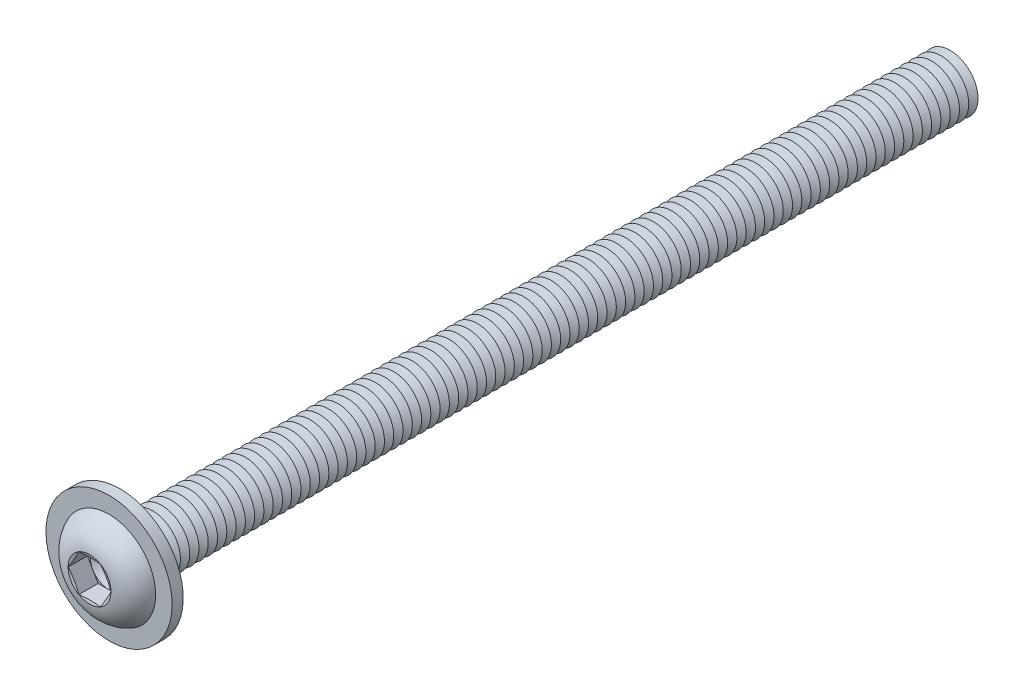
ISO-10303-21;
HEADER;
FILE_DESCRIPTION(('STEP AP214'),'2;1');
FILE_NAME('part.step','',(''),(''),'','','');
FILE_SCHEMA(('AUTOMOTIVE_DESIGN { 1 0 10303 214 1 1 1 1 }'));
ENDSEC;
DATA;
#1=APPLICATION_CONTEXT('core data for automotive mechanical design processes');
#2=APPLICATION_PROTOCOL_DEFINITION('international standard','automotive_design',2000,#1);
#3=PRODUCT_CONTEXT('',#1,'mechanical');
#4=PRODUCT('Part','Part','',(#3));
#5=PRODUCT_RELATED_PRODUCT_CATEGORY('part','',(#4));
#6=PRODUCT_DEFINITION_FORMATION('','',#4);
#7=PRODUCT_DEFINITION_CONTEXT('part definition',#1,'design');
#8=PRODUCT_DEFINITION('design','',#6,#7);
#9=PRODUCT_DEFINITION_SHAPE('','',#8);
#10=(LENGTH_UNIT() NAMED_UNIT(*) SI_UNIT(.MILLI.,.METRE.));
#11=(NAMED_UNIT(*) PLANE_ANGLE_UNIT() SI_UNIT($,.RADIAN.));
#12=(NAMED_UNIT(*) SI_UNIT($,.STERADIAN.) SOLID_ANGLE_UNIT());
#13=UNCERTAINTY_MEASURE_WITH_UNIT(LENGTH_MEASURE(1.E-05),#10,'distance_accuracy_value','');
#14=(GEOMETRIC_REPRESENTATION_CONTEXT(3) GLOBAL_UNCERTAINTY_ASSIGNED_CONTEXT((#13)) GLOBAL_UNIT_ASSIGNED_CONTEXT((#10,
#11,#12)) REPRESENTATION_CONTEXT('',''));
#15=CARTESIAN_POINT('',(0.,0.,0.));
#16=DIRECTION('',(0.,0.,1.));
#17=DIRECTION('',(1.,0.,0.));
#18=AXIS2_PLACEMENT_3D('',#15,#16,#17);
#19=CARTESIAN_POINT('',(0.,0.,-86.5));
#20=DIRECTION('',(0.,0.,1.));
#21=DIRECTION('',(0.,-1.,0.));
#22=AXIS2_PLACEMENT_3D('',#19,#20,#21);
#23=CONICAL_SURFACE('',#22,2.99999999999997,1.0471975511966);
#24=CARTESIAN_POINT('',(0.,0.,-87.));
#25=DIRECTION('',(0.,0.,1.));
#26=DIRECTION('',(0.,-1.,0.));
#27=AXIS2_PLACEMENT_3D('',#24,#25,#26);
#28=CIRCLE('',#27,2.13397459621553);
#29=CARTESIAN_POINT('',(0.,-2.13397459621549,-87.));
#30=VERTEX_POINT('',#29);
#31=EDGE_CURVE('E928',#30,#30,#28,.T.);
#32=ORIENTED_EDGE('',*,*,#31,.T.);
#33=EDGE_LOOP('',(#32));
#34=FACE_BOUND('',#33,.T.);
#35=CARTESIAN_POINT('',(0.,0.,-86.5));
#36=DIRECTION('',(0.,0.,1.));
#37=DIRECTION('',(0.,-1.,0.));
#38=AXIS2_PLACEMENT_3D('',#35,#36,#37);
#39=CIRCLE('',#38,2.99999999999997);
#40=CARTESIAN_POINT('',(0.,-2.99999999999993,-86.5));
#41=VERTEX_POINT('',#40);
#42=EDGE_CURVE('E924',#41,#41,#39,.T.);
#43=ORIENTED_EDGE('',*,*,#42,.F.);
#44=EDGE_LOOP('',(#43));
#45=FACE_BOUND('',#44,.T.);
#46=ADVANCED_FACE('F39',(#34,#45),#23,.T.);
#47=CARTESIAN_POINT('',(0.,0.,-87.));
#48=DIRECTION('',(0.,0.,-1.));
#49=DIRECTION('',(0.,1.,0.));
#50=AXIS2_PLACEMENT_3D('',#47,#48,#49);
#51=CONICAL_SURFACE('',#50,2.13397459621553,1.0471975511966);
#52=CARTESIAN_POINT('',(0.,0.,-87.5));
#53=DIRECTION('',(0.,0.,1.));
#54=DIRECTION('',(0.,-1.,0.));
#55=AXIS2_PLACEMENT_3D('',#52,#53,#54);
#56=CIRCLE('',#55,2.99999999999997);
#57=CARTESIAN_POINT('',(0.,-2.99999999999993,-87.5));
#58=VERTEX_POINT('',#57);
#59=EDGE_CURVE('E932',#58,#58,#56,.T.);
#60=ORIENTED_EDGE('',*,*,#59,.T.);
#61=EDGE_LOOP('',(#60));
#62=FACE_BOUND('',#61,.T.);
#63=ORIENTED_EDGE('',*,*,#31,.F.);
#64=EDGE_LOOP('',(#63));
#65=FACE_BOUND('',#64,.T.);
#66=ADVANCED_FACE('F1049',(#62,#65),#51,.T.);
#67=CARTESIAN_POINT('',(0.,2.99999999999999,-90.));
#68=DIRECTION('',(0.,0.,-1.));
#69=DIRECTION('',(0.,1.,0.));
#70=AXIS2_PLACEMENT_3D('',#67,#68,#69);
#71=PLANE('',#70);
#72=CARTESIAN_POINT('',(0.,0.,-90.));
#73=DIRECTION('',(0.,0.,1.));
#74=DIRECTION('',(0.,-1.,0.));
#75=AXIS2_PLACEMENT_3D('',#72,#73,#74);
#76=CIRCLE('',#75,2.13397459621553);
#77=CARTESIAN_POINT('',(0.,-2.13397459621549,-90.));
#78=VERTEX_POINT('',#77);
#79=EDGE_CURVE('E952',#78,#78,#76,.T.);
#80=ORIENTED_EDGE('',*,*,#79,.F.);
#81=EDGE_LOOP('',(#80));
#82=FACE_BOUND('',#81,.T.);
#83=ADVANCED_FACE('F1055',(#82),#71,.T.);
#84=CARTESIAN_POINT('',(0.,0.,-89.5));
#85=DIRECTION('',(0.,0.,1.));
#86=DIRECTION('',(0.,-1.,0.));
#87=AXIS2_PLACEMENT_3D('',#84,#85,#86);
#88=CONICAL_SURFACE('',#87,2.99999999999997,1.0471975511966);
#89=ORIENTED_EDGE('',*,*,#79,.T.);
#90=EDGE_LOOP('',(#89));
#91=FACE_BOUND('',#90,.T.);
#92=CARTESIAN_POINT('',(0.,0.,-89.5));
#93=DIRECTION('',(0.,0.,1.));
#94=DIRECTION('',(0.,-1.,0.));
#95=AXIS2_PLACEMENT_3D('',#92,#93,#94);
#96=CIRCLE('',#95,2.99999999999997);
#97=CARTESIAN_POINT('',(0.,-2.99999999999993,-89.5));
#98=VERTEX_POINT('',#97);
#99=EDGE_CURVE('E948',#98,#98,#96,.T.);
#100=ORIENTED_EDGE('',*,*,#99,.F.);
#101=EDGE_LOOP('',(#100));
#102=FACE_BOUND('',#101,.T.);
#103=ADVANCED_FACE('F1074',(#91,#102),#88,.T.);
#104=CARTESIAN_POINT('',(0.,0.,-89.));
#105=DIRECTION('',(0.,0.,-1.));
#106=DIRECTION('',(0.,1.,0.));
#107=AXIS2_PLACEMENT_3D('',#104,#105,#106);
#108=CONICAL_SURFACE('',#107,2.13397459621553,1.0471975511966);
#109=ORIENTED_EDGE('',*,*,#99,.T.);
#110=EDGE_LOOP('',(#109));
#111=FACE_BOUND('',#110,.T.);
#112=CARTESIAN_POINT('',(0.,0.,-89.));
#113=DIRECTION('',(0.,0.,1.));
#114=DIRECTION('',(0.,-1.,0.));
#115=AXIS2_PLACEMENT_3D('',#112,#113,#114);
#116=CIRCLE('',#115,2.13397459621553);
#117=CARTESIAN_POINT('',(0.,-2.13397459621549,-89.));
#118=VERTEX_POINT('',#117);
#119=EDGE_CURVE('E944',#118,#118,#116,.T.);
#120=ORIENTED_EDGE('',*,*,#119,.F.);
#121=EDGE_LOOP('',(#120));
#122=FACE_BOUND('',#121,.T.);
#123=ADVANCED_FACE('F1071',(#111,#122),#108,.T.);
#124=CARTESIAN_POINT('',(0.,0.,-88.5));
#125=DIRECTION('',(0.,0.,1.));
#126=DIRECTION('',(0.,-1.,0.));
#127=AXIS2_PLACEMENT_3D('',#124,#125,#126);
#128=CONICAL_SURFACE('',#127,2.99999999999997,1.0471975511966);
#129=ORIENTED_EDGE('',*,*,#119,.T.);
#130=EDGE_LOOP('',(#129));
#131=FACE_BOUND('',#130,.T.);
#132=CARTESIAN_POINT('',(0.,0.,-88.5));
#133=DIRECTION('',(0.,0.,1.));
#134=DIRECTION('',(0.,-1.,0.));
#135=AXIS2_PLACEMENT_3D('',#132,#133,#134);
#136=CIRCLE('',#135,2.99999999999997);
#137=CARTESIAN_POINT('',(0.,-2.99999999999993,-88.5));
#138=VERTEX_POINT('',#137);
#139=EDGE_CURVE('E940',#138,#138,#136,.T.);
#140=ORIENTED_EDGE('',*,*,#139,.F.);
#141=EDGE_LOOP('',(#140));
#142=FACE_BOUND('',#141,.T.);
#143=ADVANCED_FACE('F1065',(#131,#142),#128,.T.);
#144=CARTESIAN_POINT('',(0.,0.,-88.));
#145=DIRECTION('',(0.,0.,-1.));
#146=DIRECTION('',(0.,1.,0.));
#147=AXIS2_PLACEMENT_3D('',#144,#145,#146);
#148=CONICAL_SURFACE('',#147,2.13397459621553,1.0471975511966);
#149=ORIENTED_EDGE('',*,*,#139,.T.);
#150=EDGE_LOOP('',(#149));
#151=FACE_BOUND('',#150,.T.);
#152=CARTESIAN_POINT('',(0.,0.,-88.));
#153=DIRECTION('',(0.,0.,1.));
#154=DIRECTION('',(0.,-1.,0.));
#155=AXIS2_PLACEMENT_3D('',#152,#153,#154);
#156=CIRCLE('',#155,2.13397459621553);
#157=CARTESIAN_POINT('',(0.,-2.13397459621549,-88.));
#158=VERTEX_POINT('',#157);
#159=EDGE_CURVE('E936',#158,#158,#156,.T.);
#160=ORIENTED_EDGE('',*,*,#159,.F.);
#161=EDGE_LOOP('',(#160));
#162=FACE_BOUND('',#161,.T.);
#163=ADVANCED_FACE('F1061',(#151,#162),#148,.T.);
#164=CARTESIAN_POINT('',(0.,0.,-87.5));
#165=DIRECTION('',(0.,0.,1.));
#166=DIRECTION('',(0.,-1.,0.));
#167=AXIS2_PLACEMENT_3D('',#164,#165,#166);
#168=CONICAL_SURFACE('',#167,2.99999999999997,1.0471975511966);
#169=ORIENTED_EDGE('',*,*,#159,.T.);
#170=EDGE_LOOP('',(#169));
#171=FACE_BOUND('',#170,.T.);
#172=ORIENTED_EDGE('',*,*,#59,.F.);
#173=EDGE_LOOP('',(#172));
#174=FACE_BOUND('',#173,.T.);
#175=ADVANCED_FACE('F1064',(#171,#174),#168,.T.);
#176=CARTESIAN_POINT('',(0.,0.,-85.5));
#177=DIRECTION('',(0.,0.,1.));
#178=DIRECTION('',(0.,-1.,0.));
#179=AXIS2_PLACEMENT_3D('',#176,#177,#178);
#180=CONICAL_SURFACE('',#179,2.99999999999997,1.0471975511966);
#181=CARTESIAN_POINT('',(0.,0.,-86.));
#182=DIRECTION('',(0.,0.,1.));
#183=DIRECTION('',(0.,-1.,0.));
#184=AXIS2_PLACEMENT_3D('',#181,#182,#183);
#185=CIRCLE('',#184,2.13397459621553);
#186=CARTESIAN_POINT('',(0.,-2.13397459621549,-86.));
#187=VERTEX_POINT('',#186);
#188=EDGE_CURVE('E920',#187,#187,#185,.T.);
#189=ORIENTED_EDGE('',*,*,#188,.T.);
#190=EDGE_LOOP('',(#189));
#191=FACE_BOUND('',#190,.T.);
#192=CARTESIAN_POINT('',(0.,0.,-85.5));
#193=DIRECTION('',(0.,0.,1.));
#194=DIRECTION('',(0.,-1.,0.));
#195=AXIS2_PLACEMENT_3D('',#192,#193,#194);
#196=CIRCLE('',#195,2.99999999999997);
#197=CARTESIAN_POINT('',(0.,-2.99999999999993,-85.5));
#198=VERTEX_POINT('',#197);
#199=EDGE_CURVE('E916',#198,#198,#196,.T.);
#200=ORIENTED_EDGE('',*,*,#199,.F.);
#201=EDGE_LOOP('',(#200));
#202=FACE_BOUND('',#201,.T.);
#203=ADVANCED_FACE('F1069',(#191,#202),#180,.T.);
#204=CARTESIAN_POINT('',(0.,0.,-86.));
#205=DIRECTION('',(0.,0.,-1.));
#206=DIRECTION('',(0.,1.,0.));
#207=AXIS2_PLACEMENT_3D('',#204,#205,#206);
#208=CONICAL_SURFACE('',#207,2.13397459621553,1.0471975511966);
#209=ORIENTED_EDGE('',*,*,#42,.T.);
#210=EDGE_LOOP('',(#209));
#211=FACE_BOUND('',#210,.T.);
#212=ORIENTED_EDGE('',*,*,#188,.F.);
#213=EDGE_LOOP('',(#212));
#214=FACE_BOUND('',#213,.T.);
#215=ADVANCED_FACE('F1120',(#211,#214),#208,.T.);
#216=CARTESIAN_POINT('',(0.,0.,-84.5));
#217=DIRECTION('',(0.,0.,1.));
#218=DIRECTION('',(0.,-1.,0.));
#219=AXIS2_PLACEMENT_3D('',#216,#217,#218);
#220=CONICAL_SURFACE('',#219,2.99999999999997,1.0471975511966);
#221=CARTESIAN_POINT('',(0.,0.,-85.));
#222=DIRECTION('',(0.,0.,1.));
#223=DIRECTION('',(0.,-1.,0.));
#224=AXIS2_PLACEMENT_3D('',#221,#222,#223);
#225=CIRCLE('',#224,2.13397459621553);
#226=CARTESIAN_POINT('',(0.,-2.13397459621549,-85.));
#227=VERTEX_POINT('',#226);
#228=EDGE_CURVE('E912',#227,#227,#225,.T.);
#229=ORIENTED_EDGE('',*,*,#228,.T.);
#230=EDGE_LOOP('',(#229));
#231=FACE_BOUND('',#230,.T.);
#232=CARTESIAN_POINT('',(0.,0.,-84.5));
#233=DIRECTION('',(0.,0.,1.));
#234=DIRECTION('',(0.,-1.,0.));
#235=AXIS2_PLACEMENT_3D('',#232,#233,#234);
#236=CIRCLE('',#235,2.99999999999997);
#237=CARTESIAN_POINT('',(0.,-2.99999999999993,-84.5));
#238=VERTEX_POINT('',#237);
#239=EDGE_CURVE('E908',#238,#238,#236,.T.);
#240=ORIENTED_EDGE('',*,*,#239,.F.);
#241=EDGE_LOOP('',(#240));
#242=FACE_BOUND('',#241,.T.);
#243=ADVANCED_FACE('F1126',(#231,#242),#220,.T.);
#244=CARTESIAN_POINT('',(0.,0.,-85.));
#245=DIRECTION('',(0.,0.,-1.));
#246=DIRECTION('',(0.,1.,0.));
#247=AXIS2_PLACEMENT_3D('',#244,#245,#246);
#248=CONICAL_SURFACE('',#247,2.13397459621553,1.0471975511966);
#249=ORIENTED_EDGE('',*,*,#199,.T.);
#250=EDGE_LOOP('',(#249));
#251=FACE_BOUND('',#250,.T.);
#252=ORIENTED_EDGE('',*,*,#228,.F.);
#253=EDGE_LOOP('',(#252));
#254=FACE_BOUND('',#253,.T.);
#255=ADVANCED_FACE('F1133',(#251,#254),#248,.T.);
#256=CARTESIAN_POINT('',(0.,0.,-83.5));
#257=DIRECTION('',(0.,0.,1.));
#258=DIRECTION('',(0.,-1.,0.));
#259=AXIS2_PLACEMENT_3D('',#256,#257,#258);
#260=CONICAL_SURFACE('',#259,2.99999999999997,1.0471975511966);
#261=CARTESIAN_POINT('',(0.,0.,-84.));
#262=DIRECTION('',(0.,0.,1.));
#263=DIRECTION('',(0.,-1.,0.));
#264=AXIS2_PLACEMENT_3D('',#261,#262,#263);
#265=CIRCLE('',#264,2.13397459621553);
#266=CARTESIAN_POINT('',(0.,-2.13397459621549,-84.));
#267=VERTEX_POINT('',#266);
#268=EDGE_CURVE('E904',#267,#267,#265,.T.);
#269=ORIENTED_EDGE('',*,*,#268,.T.);
#270=EDGE_LOOP('',(#269));
#271=FACE_BOUND('',#270,.T.);
#272=CARTESIAN_POINT('',(0.,0.,-83.5));
#273=DIRECTION('',(0.,0.,1.));
#274=DIRECTION('',(0.,-1.,0.));
#275=AXIS2_PLACEMENT_3D('',#272,#273,#274);
#276=CIRCLE('',#275,2.99999999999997);
#277=CARTESIAN_POINT('',(0.,-2.99999999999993,-83.5));
#278=VERTEX_POINT('',#277);
#279=EDGE_CURVE('E900',#278,#278,#276,.T.);
#280=ORIENTED_EDGE('',*,*,#279,.F.);
#281=EDGE_LOOP('',(#280));
#282=FACE_BOUND('',#281,.T.);
#283=ADVANCED_FACE('F1140',(#271,#282),#260,.T.);
#284=CARTESIAN_POINT('',(0.,0.,-84.));
#285=DIRECTION('',(0.,0.,-1.));
#286=DIRECTION('',(0.,1.,0.));
#287=AXIS2_PLACEMENT_3D('',#284,#285,#286);
#288=CONICAL_SURFACE('',#287,2.13397459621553,1.0471975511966);
#289=ORIENTED_EDGE('',*,*,#239,.T.);
#290=EDGE_LOOP('',(#289));
#291=FACE_BOUND('',#290,.T.);
#292=ORIENTED_EDGE('',*,*,#268,.F.);
#293=EDGE_LOOP('',(#292));
#294=FACE_BOUND('',#293,.T.);
#295=ADVANCED_FACE('F1147',(#291,#294),#288,.T.);
#296=CARTESIAN_POINT('',(0.,0.,-82.5));
#297=DIRECTION('',(0.,0.,1.));
#298=DIRECTION('',(0.,-1.,0.));
#299=AXIS2_PLACEMENT_3D('',#296,#297,#298);
#300=CONICAL_SURFACE('',#299,2.99999999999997,1.0471975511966);
#301=CARTESIAN_POINT('',(0.,0.,-83.));
#302=DIRECTION('',(0.,0.,1.));
#303=DIRECTION('',(0.,-1.,0.));
#304=AXIS2_PLACEMENT_3D('',#301,#302,#303);
#305=CIRCLE('',#304,2.13397459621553);
#306=CARTESIAN_POINT('',(0.,-2.13397459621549,-83.));
#307=VERTEX_POINT('',#306);
#308=EDGE_CURVE('E896',#307,#307,#305,.T.);
#309=ORIENTED_EDGE('',*,*,#308,.T.);
#310=EDGE_LOOP('',(#309));
#311=FACE_BOUND('',#310,.T.);
#312=CARTESIAN_POINT('',(0.,0.,-82.5));
#313=DIRECTION('',(0.,0.,1.));
#314=DIRECTION('',(0.,-1.,0.));
#315=AXIS2_PLACEMENT_3D('',#312,#313,#314);
#316=CIRCLE('',#315,2.99999999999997);
#317=CARTESIAN_POINT('',(0.,-2.99999999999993,-82.5));
#318=VERTEX_POINT('',#317);
#319=EDGE_CURVE('E892',#318,#318,#316,.T.);
#320=ORIENTED_EDGE('',*,*,#319,.F.);
#321=EDGE_LOOP('',(#320));
#322=FACE_BOUND('',#321,.T.);
#323=ADVANCED_FACE('F1154',(#311,#322),#300,.T.);
#324=CARTESIAN_POINT('',(0.,0.,-83.));
#325=DIRECTION('',(0.,0.,-1.));
#326=DIRECTION('',(0.,1.,0.));
#327=AXIS2_PLACEMENT_3D('',#324,#325,#326);
#328=CONICAL_SURFACE('',#327,2.13397459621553,1.0471975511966);
#329=ORIENTED_EDGE('',*,*,#279,.T.);
#330=EDGE_LOOP('',(#329));
#331=FACE_BOUND('',#330,.T.);
#332=ORIENTED_EDGE('',*,*,#308,.F.);
#333=EDGE_LOOP('',(#332));
#334=FACE_BOUND('',#333,.T.);
#335=ADVANCED_FACE('F1161',(#331,#334),#328,.T.);
#336=CARTESIAN_POINT('',(0.,0.,-81.5));
#337=DIRECTION('',(0.,0.,1.));
#338=DIRECTION('',(0.,-1.,0.));
#339=AXIS2_PLACEMENT_3D('',#336,#337,#338);
#340=CONICAL_SURFACE('',#339,2.99999999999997,1.0471975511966);
#341=CARTESIAN_POINT('',(0.,0.,-82.));
#342=DIRECTION('',(0.,0.,1.));
#343=DIRECTION('',(0.,-1.,0.));
#344=AXIS2_PLACEMENT_3D('',#341,#342,#343);
#345=CIRCLE('',#344,2.13397459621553);
#346=CARTESIAN_POINT('',(0.,-2.13397459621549,-82.));
#347=VERTEX_POINT('',#346);
#348=EDGE_CURVE('E888',#347,#347,#345,.T.);
#349=ORIENTED_EDGE('',*,*,#348,.T.);
#350=EDGE_LOOP('',(#349));
#351=FACE_BOUND('',#350,.T.);
#352=CARTESIAN_POINT('',(0.,0.,-81.5));
#353=DIRECTION('',(0.,0.,1.));
#354=DIRECTION('',(0.,-1.,0.));
#355=AXIS2_PLACEMENT_3D('',#352,#353,#354);
#356=CIRCLE('',#355,2.99999999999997);
#357=CARTESIAN_POINT('',(0.,-2.99999999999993,-81.5));
#358=VERTEX_POINT('',#357);
#359=EDGE_CURVE('E884',#358,#358,#356,.T.);
#360=ORIENTED_EDGE('',*,*,#359,.F.);
#361=EDGE_LOOP('',(#360));
#362=FACE_BOUND('',#361,.T.);
#363=ADVANCED_FACE('F1168',(#351,#362),#340,.T.);
#364=CARTESIAN_POINT('',(0.,0.,-82.));
#365=DIRECTION('',(0.,0.,-1.));
#366=DIRECTION('',(0.,1.,0.));
#367=AXIS2_PLACEMENT_3D('',#364,#365,#366);
#368=CONICAL_SURFACE('',#367,2.13397459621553,1.0471975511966);
#369=ORIENTED_EDGE('',*,*,#319,.T.);
#370=EDGE_LOOP('',(#369));
#371=FACE_BOUND('',#370,.T.);
#372=ORIENTED_EDGE('',*,*,#348,.F.);
#373=EDGE_LOOP('',(#372));
#374=FACE_BOUND('',#373,.T.);
#375=ADVANCED_FACE('F1175',(#371,#374),#368,.T.);
#376=CARTESIAN_POINT('',(0.,0.,-80.5));
#377=DIRECTION('',(0.,0.,1.));
#378=DIRECTION('',(0.,-1.,0.));
#379=AXIS2_PLACEMENT_3D('',#376,#377,#378);
#380=CONICAL_SURFACE('',#379,2.99999999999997,1.0471975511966);
#381=CARTESIAN_POINT('',(0.,0.,-81.));
#382=DIRECTION('',(0.,0.,1.));
#383=DIRECTION('',(0.,-1.,0.));
#384=AXIS2_PLACEMENT_3D('',#381,#382,#383);
#385=CIRCLE('',#384,2.13397459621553);
#386=CARTESIAN_POINT('',(0.,-2.13397459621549,-81.));
#387=VERTEX_POINT('',#386);
#388=EDGE_CURVE('E880',#387,#387,#385,.T.);
#389=ORIENTED_EDGE('',*,*,#388,.T.);
#390=EDGE_LOOP('',(#389));
#391=FACE_BOUND('',#390,.T.);
#392=CARTESIAN_POINT('',(0.,0.,-80.5));
#393=DIRECTION('',(0.,0.,1.));
#394=DIRECTION('',(0.,-1.,0.));
#395=AXIS2_PLACEMENT_3D('',#392,#393,#394);
#396=CIRCLE('',#395,2.99999999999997);
#397=CARTESIAN_POINT('',(0.,-2.99999999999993,-80.5));
#398=VERTEX_POINT('',#397);
#399=EDGE_CURVE('E876',#398,#398,#396,.T.);
#400=ORIENTED_EDGE('',*,*,#399,.F.);
#401=EDGE_LOOP('',(#400));
#402=FACE_BOUND('',#401,.T.);
#403=ADVANCED_FACE('F1182',(#391,#402),#380,.T.);
#404=CARTESIAN_POINT('',(0.,0.,-81.));
#405=DIRECTION('',(0.,0.,-1.));
#406=DIRECTION('',(0.,1.,0.));
#407=AXIS2_PLACEMENT_3D('',#404,#405,#406);
#408=CONICAL_SURFACE('',#407,2.13397459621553,1.0471975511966);
#409=ORIENTED_EDGE('',*,*,#359,.T.);
#410=EDGE_LOOP('',(#409));
#411=FACE_BOUND('',#410,.T.);
#412=ORIENTED_EDGE('',*,*,#388,.F.);
#413=EDGE_LOOP('',(#412));
#414=FACE_BOUND('',#413,.T.);
#415=ADVANCED_FACE('F1189',(#411,#414),#408,.T.);
#416=CARTESIAN_POINT('',(0.,0.,-79.5));
#417=DIRECTION('',(0.,0.,1.));
#418=DIRECTION('',(0.,-1.,0.));
#419=AXIS2_PLACEMENT_3D('',#416,#417,#418);
#420=CONICAL_SURFACE('',#419,2.99999999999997,1.0471975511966);
#421=CARTESIAN_POINT('',(0.,0.,-80.));
#422=DIRECTION('',(0.,0.,1.));
#423=DIRECTION('',(0.,-1.,0.));
#424=AXIS2_PLACEMENT_3D('',#421,#422,#423);
#425=CIRCLE('',#424,2.13397459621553);
#426=CARTESIAN_POINT('',(0.,-2.13397459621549,-80.));
#427=VERTEX_POINT('',#426);
#428=EDGE_CURVE('E872',#427,#427,#425,.T.);
#429=ORIENTED_EDGE('',*,*,#428,.T.);
#430=EDGE_LOOP('',(#429));
#431=FACE_BOUND('',#430,.T.);
#432=CARTESIAN_POINT('',(0.,0.,-79.5));
#433=DIRECTION('',(0.,0.,1.));
#434=DIRECTION('',(0.,-1.,0.));
#435=AXIS2_PLACEMENT_3D('',#432,#433,#434);
#436=CIRCLE('',#435,2.99999999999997);
#437=CARTESIAN_POINT('',(0.,-2.99999999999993,-79.5));
#438=VERTEX_POINT('',#437);
#439=EDGE_CURVE('E868',#438,#438,#436,.T.);
#440=ORIENTED_EDGE('',*,*,#439,.F.);
#441=EDGE_LOOP('',(#440));
#442=FACE_BOUND('',#441,.T.);
#443=ADVANCED_FACE('F1196',(#431,#442),#420,.T.);
#444=CARTESIAN_POINT('',(0.,0.,-80.));
#445=DIRECTION('',(0.,0.,-1.));
#446=DIRECTION('',(0.,1.,0.));
#447=AXIS2_PLACEMENT_3D('',#444,#445,#446);
#448=CONICAL_SURFACE('',#447,2.13397459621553,1.0471975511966);
#449=ORIENTED_EDGE('',*,*,#399,.T.);
#450=EDGE_LOOP('',(#449));
#451=FACE_BOUND('',#450,.T.);
#452=ORIENTED_EDGE('',*,*,#428,.F.);
#453=EDGE_LOOP('',(#452));
#454=FACE_BOUND('',#453,.T.);
#455=ADVANCED_FACE('F1203',(#451,#454),#448,.T.);
#456=CARTESIAN_POINT('',(0.,0.,-78.5));
#457=DIRECTION('',(0.,0.,1.));
#458=DIRECTION('',(0.,-1.,0.));
#459=AXIS2_PLACEMENT_3D('',#456,#457,#458);
#460=CONICAL_SURFACE('',#459,2.99999999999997,1.0471975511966);
#461=CARTESIAN_POINT('',(0.,0.,-79.));
#462=DIRECTION('',(0.,0.,1.));
#463=DIRECTION('',(0.,-1.,0.));
#464=AXIS2_PLACEMENT_3D('',#461,#462,#463);
#465=CIRCLE('',#464,2.13397459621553);
#466=CARTESIAN_POINT('',(0.,-2.13397459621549,-79.));
#467=VERTEX_POINT('',#466);
#468=EDGE_CURVE('E864',#467,#467,#465,.T.);
#469=ORIENTED_EDGE('',*,*,#468,.T.);
#470=EDGE_LOOP('',(#469));
#471=FACE_BOUND('',#470,.T.);
#472=CARTESIAN_POINT('',(0.,0.,-78.5));
#473=DIRECTION('',(0.,0.,1.));
#474=DIRECTION('',(0.,-1.,0.));
#475=AXIS2_PLACEMENT_3D('',#472,#473,#474);
#476=CIRCLE('',#475,2.99999999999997);
#477=CARTESIAN_POINT('',(0.,-2.99999999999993,-78.5));
#478=VERTEX_POINT('',#477);
#479=EDGE_CURVE('E860',#478,#478,#476,.T.);
#480=ORIENTED_EDGE('',*,*,#479,.F.);
#481=EDGE_LOOP('',(#480));
#482=FACE_BOUND('',#481,.T.);
#483=ADVANCED_FACE('F1210',(#471,#482),#460,.T.);
#484=CARTESIAN_POINT('',(0.,0.,-79.));
#485=DIRECTION('',(0.,0.,-1.));
#486=DIRECTION('',(0.,1.,0.));
#487=AXIS2_PLACEMENT_3D('',#484,#485,#486);
#488=CONICAL_SURFACE('',#487,2.13397459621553,1.0471975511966);
#489=ORIENTED_EDGE('',*,*,#439,.T.);
#490=EDGE_LOOP('',(#489));
#491=FACE_BOUND('',#490,.T.);
#492=ORIENTED_EDGE('',*,*,#468,.F.);
#493=EDGE_LOOP('',(#492));
#494=FACE_BOUND('',#493,.T.);
#495=ADVANCED_FACE('F1217',(#491,#494),#488,.T.);
#496=CARTESIAN_POINT('',(0.,0.,-77.5));
#497=DIRECTION('',(0.,0.,1.));
#498=DIRECTION('',(0.,-1.,0.));
#499=AXIS2_PLACEMENT_3D('',#496,#497,#498);
#500=CONICAL_SURFACE('',#499,2.99999999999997,1.0471975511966);
#501=CARTESIAN_POINT('',(0.,0.,-78.));
#502=DIRECTION('',(0.,0.,1.));
#503=DIRECTION('',(0.,-1.,0.));
#504=AXIS2_PLACEMENT_3D('',#501,#502,#503);
#505=CIRCLE('',#504,2.13397459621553);
#506=CARTESIAN_POINT('',(0.,-2.13397459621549,-78.));
#507=VERTEX_POINT('',#506);
#508=EDGE_CURVE('E856',#507,#507,#505,.T.);
#509=ORIENTED_EDGE('',*,*,#508,.T.);
#510=EDGE_LOOP('',(#509));
#511=FACE_BOUND('',#510,.T.);
#512=CARTESIAN_POINT('',(0.,0.,-77.5));
#513=DIRECTION('',(0.,0.,1.));
#514=DIRECTION('',(0.,-1.,0.));
#515=AXIS2_PLACEMENT_3D('',#512,#513,#514);
#516=CIRCLE('',#515,2.99999999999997);
#517=CARTESIAN_POINT('',(0.,-2.99999999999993,-77.5));
#518=VERTEX_POINT('',#517);
#519=EDGE_CURVE('E852',#518,#518,#516,.T.);
#520=ORIENTED_EDGE('',*,*,#519,.F.);
#521=EDGE_LOOP('',(#520));
#522=FACE_BOUND('',#521,.T.);
#523=ADVANCED_FACE('F1224',(#511,#522),#500,.T.);
#524=CARTESIAN_POINT('',(0.,0.,-78.));
#525=DIRECTION('',(0.,0.,-1.));
#526=DIRECTION('',(0.,1.,0.));
#527=AXIS2_PLACEMENT_3D('',#524,#525,#526);
#528=CONICAL_SURFACE('',#527,2.13397459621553,1.0471975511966);
#529=ORIENTED_EDGE('',*,*,#479,.T.);
#530=EDGE_LOOP('',(#529));
#531=FACE_BOUND('',#530,.T.);
#532=ORIENTED_EDGE('',*,*,#508,.F.);
#533=EDGE_LOOP('',(#532));
#534=FACE_BOUND('',#533,.T.);
#535=ADVANCED_FACE('F1231',(#531,#534),#528,.T.);
#536=CARTESIAN_POINT('',(0.,0.,-76.5));
#537=DIRECTION('',(0.,0.,1.));
#538=DIRECTION('',(0.,-1.,0.));
#539=AXIS2_PLACEMENT_3D('',#536,#537,#538);
#540=CONICAL_SURFACE('',#539,2.99999999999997,1.0471975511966);
#541=CARTESIAN_POINT('',(0.,0.,-77.));
#542=DIRECTION('',(0.,0.,1.));
#543=DIRECTION('',(0.,-1.,0.));
#544=AXIS2_PLACEMENT_3D('',#541,#542,#543);
#545=CIRCLE('',#544,2.13397459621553);
#546=CARTESIAN_POINT('',(0.,-2.13397459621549,-77.));
#547=VERTEX_POINT('',#546);
#548=EDGE_CURVE('E848',#547,#547,#545,.T.);
#549=ORIENTED_EDGE('',*,*,#548,.T.);
#550=EDGE_LOOP('',(#549));
#551=FACE_BOUND('',#550,.T.);
#552=CARTESIAN_POINT('',(0.,0.,-76.5));
#553=DIRECTION('',(0.,0.,1.));
#554=DIRECTION('',(0.,-1.,0.));
#555=AXIS2_PLACEMENT_3D('',#552,#553,#554);
#556=CIRCLE('',#555,2.99999999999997);
#557=CARTESIAN_POINT('',(0.,-2.99999999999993,-76.5));
#558=VERTEX_POINT('',#557);
#559=EDGE_CURVE('E844',#558,#558,#556,.T.);
#560=ORIENTED_EDGE('',*,*,#559,.F.);
#561=EDGE_LOOP('',(#560));
#562=FACE_BOUND('',#561,.T.);
#563=ADVANCED_FACE('F1238',(#551,#562),#540,.T.);
#564=CARTESIAN_POINT('',(0.,0.,-77.));
#565=DIRECTION('',(0.,0.,-1.));
#566=DIRECTION('',(0.,1.,0.));
#567=AXIS2_PLACEMENT_3D('',#564,#565,#566);
#568=CONICAL_SURFACE('',#567,2.13397459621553,1.0471975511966);
#569=ORIENTED_EDGE('',*,*,#519,.T.);
#570=EDGE_LOOP('',(#569));
#571=FACE_BOUND('',#570,.T.);
#572=ORIENTED_EDGE('',*,*,#548,.F.);
#573=EDGE_LOOP('',(#572));
#574=FACE_BOUND('',#573,.T.);
#575=ADVANCED_FACE('F1245',(#571,#574),#568,.T.);
#576=CARTESIAN_POINT('',(0.,0.,-75.5));
#577=DIRECTION('',(0.,0.,1.));
#578=DIRECTION('',(0.,-1.,0.));
#579=AXIS2_PLACEMENT_3D('',#576,#577,#578);
#580=CONICAL_SURFACE('',#579,2.99999999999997,1.0471975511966);
#581=CARTESIAN_POINT('',(0.,0.,-76.));
#582=DIRECTION('',(0.,0.,1.));
#583=DIRECTION('',(0.,-1.,0.));
#584=AXIS2_PLACEMENT_3D('',#581,#582,#583);
#585=CIRCLE('',#584,2.13397459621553);
#586=CARTESIAN_POINT('',(0.,-2.13397459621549,-76.));
#587=VERTEX_POINT('',#586);
#588=EDGE_CURVE('E840',#587,#587,#585,.T.);
#589=ORIENTED_EDGE('',*,*,#588,.T.);
#590=EDGE_LOOP('',(#589));
#591=FACE_BOUND('',#590,.T.);
#592=CARTESIAN_POINT('',(0.,0.,-75.5));
#593=DIRECTION('',(0.,0.,1.));
#594=DIRECTION('',(0.,-1.,0.));
#595=AXIS2_PLACEMENT_3D('',#592,#593,#594);
#596=CIRCLE('',#595,2.99999999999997);
#597=CARTESIAN_POINT('',(0.,-2.99999999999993,-75.5));
#598=VERTEX_POINT('',#597);
#599=EDGE_CURVE('E836',#598,#598,#596,.T.);
#600=ORIENTED_EDGE('',*,*,#599,.F.);
#601=EDGE_LOOP('',(#600));
#602=FACE_BOUND('',#601,.T.);
#603=ADVANCED_FACE('F1252',(#591,#602),#580,.T.);
#604=CARTESIAN_POINT('',(0.,0.,-76.));
#605=DIRECTION('',(0.,0.,-1.));
#606=DIRECTION('',(0.,1.,0.));
#607=AXIS2_PLACEMENT_3D('',#604,#605,#606);
#608=CONICAL_SURFACE('',#607,2.13397459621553,1.0471975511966);
#609=ORIENTED_EDGE('',*,*,#559,.T.);
#610=EDGE_LOOP('',(#609));
#611=FACE_BOUND('',#610,.T.);
#612=ORIENTED_EDGE('',*,*,#588,.F.);
#613=EDGE_LOOP('',(#612));
#614=FACE_BOUND('',#613,.T.);
#615=ADVANCED_FACE('F1259',(#611,#614),#608,.T.);
#616=CARTESIAN_POINT('',(0.,0.,-74.5));
#617=DIRECTION('',(0.,0.,1.));
#618=DIRECTION('',(0.,-1.,0.));
#619=AXIS2_PLACEMENT_3D('',#616,#617,#618);
#620=CONICAL_SURFACE('',#619,2.99999999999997,1.0471975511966);
#621=CARTESIAN_POINT('',(0.,0.,-75.));
#622=DIRECTION('',(0.,0.,1.));
#623=DIRECTION('',(0.,-1.,0.));
#624=AXIS2_PLACEMENT_3D('',#621,#622,#623);
#625=CIRCLE('',#624,2.13397459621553);
#626=CARTESIAN_POINT('',(0.,-2.13397459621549,-75.));
#627=VERTEX_POINT('',#626);
#628=EDGE_CURVE('E832',#627,#627,#625,.T.);
#629=ORIENTED_EDGE('',*,*,#628,.T.);
#630=EDGE_LOOP('',(#629));
#631=FACE_BOUND('',#630,.T.);
#632=CARTESIAN_POINT('',(0.,0.,-74.5));
#633=DIRECTION('',(0.,0.,1.));
#634=DIRECTION('',(0.,-1.,0.));
#635=AXIS2_PLACEMENT_3D('',#632,#633,#634);
#636=CIRCLE('',#635,2.99999999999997);
#637=CARTESIAN_POINT('',(0.,-2.99999999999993,-74.5));
#638=VERTEX_POINT('',#637);
#639=EDGE_CURVE('E828',#638,#638,#636,.T.);
#640=ORIENTED_EDGE('',*,*,#639,.F.);
#641=EDGE_LOOP('',(#640));
#642=FACE_BOUND('',#641,.T.);
#643=ADVANCED_FACE('F1266',(#631,#642),#620,.T.);
#644=CARTESIAN_POINT('',(0.,0.,-75.));
#645=DIRECTION('',(0.,0.,-1.));
#646=DIRECTION('',(0.,1.,0.));
#647=AXIS2_PLACEMENT_3D('',#644,#645,#646);
#648=CONICAL_SURFACE('',#647,2.13397459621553,1.0471975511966);
#649=ORIENTED_EDGE('',*,*,#599,.T.);
#650=EDGE_LOOP('',(#649));
#651=FACE_BOUND('',#650,.T.);
#652=ORIENTED_EDGE('',*,*,#628,.F.);
#653=EDGE_LOOP('',(#652));
#654=FACE_BOUND('',#653,.T.);
#655=ADVANCED_FACE('F1273',(#651,#654),#648,.T.);
#656=CARTESIAN_POINT('',(0.,0.,-73.5));
#657=DIRECTION('',(0.,0.,1.));
#658=DIRECTION('',(0.,-1.,0.));
#659=AXIS2_PLACEMENT_3D('',#656,#657,#658);
#660=CONICAL_SURFACE('',#659,2.99999999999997,1.0471975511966);
#661=CARTESIAN_POINT('',(0.,0.,-74.));
#662=DIRECTION('',(0.,0.,1.));
#663=DIRECTION('',(0.,-1.,0.));
#664=AXIS2_PLACEMENT_3D('',#661,#662,#663);
#665=CIRCLE('',#664,2.13397459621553);
#666=CARTESIAN_POINT('',(0.,-2.1339745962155,-74.));
#667=VERTEX_POINT('',#666);
#668=EDGE_CURVE('E824',#667,#667,#665,.T.);
#669=ORIENTED_EDGE('',*,*,#668,.T.);
#670=EDGE_LOOP('',(#669));
#671=FACE_BOUND('',#670,.T.);
#672=CARTESIAN_POINT('',(0.,0.,-73.5));
#673=DIRECTION('',(0.,0.,1.));
#674=DIRECTION('',(0.,-1.,0.));
#675=AXIS2_PLACEMENT_3D('',#672,#673,#674);
#676=CIRCLE('',#675,2.99999999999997);
#677=CARTESIAN_POINT('',(0.,-2.99999999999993,-73.5));
#678=VERTEX_POINT('',#677);
#679=EDGE_CURVE('E820',#678,#678,#676,.T.);
#680=ORIENTED_EDGE('',*,*,#679,.F.);
#681=EDGE_LOOP('',(#680));
#682=FACE_BOUND('',#681,.T.);
#683=ADVANCED_FACE('F1280',(#671,#682),#660,.T.);
#684=CARTESIAN_POINT('',(0.,0.,-74.));
#685=DIRECTION('',(0.,0.,-1.));
#686=DIRECTION('',(0.,1.,0.));
#687=AXIS2_PLACEMENT_3D('',#684,#685,#686);
#688=CONICAL_SURFACE('',#687,2.13397459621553,1.0471975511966);
#689=ORIENTED_EDGE('',*,*,#639,.T.);
#690=EDGE_LOOP('',(#689));
#691=FACE_BOUND('',#690,.T.);
#692=ORIENTED_EDGE('',*,*,#668,.F.);
#693=EDGE_LOOP('',(#692));
#694=FACE_BOUND('',#693,.T.);
#695=ADVANCED_FACE('F1287',(#691,#694),#688,.T.);
#696=CARTESIAN_POINT('',(0.,0.,-72.5));
#697=DIRECTION('',(0.,0.,1.));
#698=DIRECTION('',(0.,-1.,0.));
#699=AXIS2_PLACEMENT_3D('',#696,#697,#698);
#700=CONICAL_SURFACE('',#699,2.99999999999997,1.0471975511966);
#701=CARTESIAN_POINT('',(0.,0.,-73.));
#702=DIRECTION('',(0.,0.,1.));
#703=DIRECTION('',(0.,-1.,0.));
#704=AXIS2_PLACEMENT_3D('',#701,#702,#703);
#705=CIRCLE('',#704,2.13397459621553);
#706=CARTESIAN_POINT('',(0.,-2.1339745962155,-73.));
#707=VERTEX_POINT('',#706);
#708=EDGE_CURVE('E816',#707,#707,#705,.T.);
#709=ORIENTED_EDGE('',*,*,#708,.T.);
#710=EDGE_LOOP('',(#709));
#711=FACE_BOUND('',#710,.T.);
#712=CARTESIAN_POINT('',(0.,0.,-72.5));
#713=DIRECTION('',(0.,0.,1.));
#714=DIRECTION('',(0.,-1.,0.));
#715=AXIS2_PLACEMENT_3D('',#712,#713,#714);
#716=CIRCLE('',#715,2.99999999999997);
#717=CARTESIAN_POINT('',(0.,-2.99999999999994,-72.5));
#718=VERTEX_POINT('',#717);
#719=EDGE_CURVE('E812',#718,#718,#716,.T.);
#720=ORIENTED_EDGE('',*,*,#719,.F.);
#721=EDGE_LOOP('',(#720));
#722=FACE_BOUND('',#721,.T.);
#723=ADVANCED_FACE('F1294',(#711,#722),#700,.T.);
#724=CARTESIAN_POINT('',(0.,0.,-73.));
#725=DIRECTION('',(0.,0.,-1.));
#726=DIRECTION('',(0.,1.,0.));
#727=AXIS2_PLACEMENT_3D('',#724,#725,#726);
#728=CONICAL_SURFACE('',#727,2.13397459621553,1.0471975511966);
#729=ORIENTED_EDGE('',*,*,#679,.T.);
#730=EDGE_LOOP('',(#729));
#731=FACE_BOUND('',#730,.T.);
#732=ORIENTED_EDGE('',*,*,#708,.F.);
#733=EDGE_LOOP('',(#732));
#734=FACE_BOUND('',#733,.T.);
#735=ADVANCED_FACE('F1301',(#731,#734),#728,.T.);
#736=CARTESIAN_POINT('',(0.,0.,-71.5));
#737=DIRECTION('',(0.,0.,1.));
#738=DIRECTION('',(0.,-1.,0.));
#739=AXIS2_PLACEMENT_3D('',#736,#737,#738);
#740=CONICAL_SURFACE('',#739,2.99999999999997,1.0471975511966);
#741=CARTESIAN_POINT('',(0.,0.,-72.));
#742=DIRECTION('',(0.,0.,1.));
#743=DIRECTION('',(0.,-1.,0.));
#744=AXIS2_PLACEMENT_3D('',#741,#742,#743);
#745=CIRCLE('',#744,2.13397459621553);
#746=CARTESIAN_POINT('',(0.,-2.1339745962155,-72.));
#747=VERTEX_POINT('',#746);
#748=EDGE_CURVE('E808',#747,#747,#745,.T.);
#749=ORIENTED_EDGE('',*,*,#748,.T.);
#750=EDGE_LOOP('',(#749));
#751=FACE_BOUND('',#750,.T.);
#752=CARTESIAN_POINT('',(0.,0.,-71.5));
#753=DIRECTION('',(0.,0.,1.));
#754=DIRECTION('',(0.,-1.,0.));
#755=AXIS2_PLACEMENT_3D('',#752,#753,#754);
#756=CIRCLE('',#755,2.99999999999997);
#757=CARTESIAN_POINT('',(0.,-2.99999999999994,-71.5));
#758=VERTEX_POINT('',#757);
#759=EDGE_CURVE('E804',#758,#758,#756,.T.);
#760=ORIENTED_EDGE('',*,*,#759,.F.);
#761=EDGE_LOOP('',(#760));
#762=FACE_BOUND('',#761,.T.);
#763=ADVANCED_FACE('F1308',(#751,#762),#740,.T.);
#764=CARTESIAN_POINT('',(0.,0.,-72.));
#765=DIRECTION('',(0.,0.,-1.));
#766=DIRECTION('',(0.,1.,0.));
#767=AXIS2_PLACEMENT_3D('',#764,#765,#766);
#768=CONICAL_SURFACE('',#767,2.13397459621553,1.0471975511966);
#769=ORIENTED_EDGE('',*,*,#719,.T.);
#770=EDGE_LOOP('',(#769));
#771=FACE_BOUND('',#770,.T.);
#772=ORIENTED_EDGE('',*,*,#748,.F.);
#773=EDGE_LOOP('',(#772));
#774=FACE_BOUND('',#773,.T.);
#775=ADVANCED_FACE('F1315',(#771,#774),#768,.T.);
#776=CARTESIAN_POINT('',(0.,0.,-70.5));
#777=DIRECTION('',(0.,0.,1.));
#778=DIRECTION('',(0.,-1.,0.));
#779=AXIS2_PLACEMENT_3D('',#776,#777,#778);
#780=CONICAL_SURFACE('',#779,2.99999999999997,1.0471975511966);
#781=CARTESIAN_POINT('',(0.,0.,-71.));
#782=DIRECTION('',(0.,0.,1.));
#783=DIRECTION('',(0.,-1.,0.));
#784=AXIS2_PLACEMENT_3D('',#781,#782,#783);
#785=CIRCLE('',#784,2.13397459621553);
#786=CARTESIAN_POINT('',(0.,-2.1339745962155,-71.));
#787=VERTEX_POINT('',#786);
#788=EDGE_CURVE('E800',#787,#787,#785,.T.);
#789=ORIENTED_EDGE('',*,*,#788,.T.);
#790=EDGE_LOOP('',(#789));
#791=FACE_BOUND('',#790,.T.);
#792=CARTESIAN_POINT('',(0.,0.,-70.5));
#793=DIRECTION('',(0.,0.,1.));
#794=DIRECTION('',(0.,-1.,0.));
#795=AXIS2_PLACEMENT_3D('',#792,#793,#794);
#796=CIRCLE('',#795,2.99999999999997);
#797=CARTESIAN_POINT('',(0.,-2.99999999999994,-70.5));
#798=VERTEX_POINT('',#797);
#799=EDGE_CURVE('E796',#798,#798,#796,.T.);
#800=ORIENTED_EDGE('',*,*,#799,.F.);
#801=EDGE_LOOP('',(#800));
#802=FACE_BOUND('',#801,.T.);
#803=ADVANCED_FACE('F1322',(#791,#802),#780,.T.);
#804=CARTESIAN_POINT('',(0.,0.,-71.));
#805=DIRECTION('',(0.,0.,-1.));
#806=DIRECTION('',(0.,1.,0.));
#807=AXIS2_PLACEMENT_3D('',#804,#805,#806);
#808=CONICAL_SURFACE('',#807,2.13397459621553,1.0471975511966);
#809=ORIENTED_EDGE('',*,*,#759,.T.);
#810=EDGE_LOOP('',(#809));
#811=FACE_BOUND('',#810,.T.);
#812=ORIENTED_EDGE('',*,*,#788,.F.);
#813=EDGE_LOOP('',(#812));
#814=FACE_BOUND('',#813,.T.);
#815=ADVANCED_FACE('F1329',(#811,#814),#808,.T.);
#816=CARTESIAN_POINT('',(0.,0.,-69.5));
#817=DIRECTION('',(0.,0.,1.));
#818=DIRECTION('',(0.,-1.,0.));
#819=AXIS2_PLACEMENT_3D('',#816,#817,#818);
#820=CONICAL_SURFACE('',#819,2.99999999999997,1.0471975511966);
#821=CARTESIAN_POINT('',(0.,0.,-70.));
#822=DIRECTION('',(0.,0.,1.));
#823=DIRECTION('',(0.,-1.,0.));
#824=AXIS2_PLACEMENT_3D('',#821,#822,#823);
#825=CIRCLE('',#824,2.13397459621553);
#826=CARTESIAN_POINT('',(0.,-2.1339745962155,-70.));
#827=VERTEX_POINT('',#826);
#828=EDGE_CURVE('E792',#827,#827,#825,.T.);
#829=ORIENTED_EDGE('',*,*,#828,.T.);
#830=EDGE_LOOP('',(#829));
#831=FACE_BOUND('',#830,.T.);
#832=CARTESIAN_POINT('',(0.,0.,-69.5));
#833=DIRECTION('',(0.,0.,1.));
#834=DIRECTION('',(0.,-1.,0.));
#835=AXIS2_PLACEMENT_3D('',#832,#833,#834);
#836=CIRCLE('',#835,2.99999999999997);
#837=CARTESIAN_POINT('',(0.,-2.99999999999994,-69.5));
#838=VERTEX_POINT('',#837);
#839=EDGE_CURVE('E788',#838,#838,#836,.T.);
#840=ORIENTED_EDGE('',*,*,#839,.F.);
#841=EDGE_LOOP('',(#840));
#842=FACE_BOUND('',#841,.T.);
#843=ADVANCED_FACE('F1336',(#831,#842),#820,.T.);
#844=CARTESIAN_POINT('',(0.,0.,-70.));
#845=DIRECTION('',(0.,0.,-1.));
#846=DIRECTION('',(0.,1.,0.));
#847=AXIS2_PLACEMENT_3D('',#844,#845,#846);
#848=CONICAL_SURFACE('',#847,2.13397459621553,1.0471975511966);
#849=ORIENTED_EDGE('',*,*,#799,.T.);
#850=EDGE_LOOP('',(#849));
#851=FACE_BOUND('',#850,.T.);
#852=ORIENTED_EDGE('',*,*,#828,.F.);
#853=EDGE_LOOP('',(#852));
#854=FACE_BOUND('',#853,.T.);
#855=ADVANCED_FACE('F1343',(#851,#854),#848,.T.);
#856=CARTESIAN_POINT('',(0.,0.,-68.5));
#857=DIRECTION('',(0.,0.,1.));
#858=DIRECTION('',(0.,-1.,0.));
#859=AXIS2_PLACEMENT_3D('',#856,#857,#858);
#860=CONICAL_SURFACE('',#859,2.99999999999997,1.0471975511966);
#861=CARTESIAN_POINT('',(0.,0.,-69.));
#862=DIRECTION('',(0.,0.,1.));
#863=DIRECTION('',(0.,-1.,0.));
#864=AXIS2_PLACEMENT_3D('',#861,#862,#863);
#865=CIRCLE('',#864,2.13397459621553);
#866=CARTESIAN_POINT('',(0.,-2.1339745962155,-69.));
#867=VERTEX_POINT('',#866);
#868=EDGE_CURVE('E784',#867,#867,#865,.T.);
#869=ORIENTED_EDGE('',*,*,#868,.T.);
#870=EDGE_LOOP('',(#869));
#871=FACE_BOUND('',#870,.T.);
#872=CARTESIAN_POINT('',(0.,0.,-68.5));
#873=DIRECTION('',(0.,0.,1.));
#874=DIRECTION('',(0.,-1.,0.));
#875=AXIS2_PLACEMENT_3D('',#872,#873,#874);
#876=CIRCLE('',#875,2.99999999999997);
#877=CARTESIAN_POINT('',(0.,-2.99999999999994,-68.5));
#878=VERTEX_POINT('',#877);
#879=EDGE_CURVE('E780',#878,#878,#876,.T.);
#880=ORIENTED_EDGE('',*,*,#879,.F.);
#881=EDGE_LOOP('',(#880));
#882=FACE_BOUND('',#881,.T.);
#883=ADVANCED_FACE('F1350',(#871,#882),#860,.T.);
#884=CARTESIAN_POINT('',(0.,0.,-69.));
#885=DIRECTION('',(0.,0.,-1.));
#886=DIRECTION('',(0.,1.,0.));
#887=AXIS2_PLACEMENT_3D('',#884,#885,#886);
#888=CONICAL_SURFACE('',#887,2.13397459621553,1.0471975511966);
#889=ORIENTED_EDGE('',*,*,#839,.T.);
#890=EDGE_LOOP('',(#889));
#891=FACE_BOUND('',#890,.T.);
#892=ORIENTED_EDGE('',*,*,#868,.F.);
#893=EDGE_LOOP('',(#892));
#894=FACE_BOUND('',#893,.T.);
#895=ADVANCED_FACE('F1357',(#891,#894),#888,.T.);
#896=CARTESIAN_POINT('',(0.,0.,-67.5));
#897=DIRECTION('',(0.,0.,1.));
#898=DIRECTION('',(0.,-1.,0.));
#899=AXIS2_PLACEMENT_3D('',#896,#897,#898);
#900=CONICAL_SURFACE('',#899,2.99999999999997,1.0471975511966);
#901=CARTESIAN_POINT('',(0.,0.,-68.));
#902=DIRECTION('',(0.,0.,1.));
#903=DIRECTION('',(0.,-1.,0.));
#904=AXIS2_PLACEMENT_3D('',#901,#902,#903);
#905=CIRCLE('',#904,2.13397459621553);
#906=CARTESIAN_POINT('',(0.,-2.1339745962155,-68.));
#907=VERTEX_POINT('',#906);
#908=EDGE_CURVE('E776',#907,#907,#905,.T.);
#909=ORIENTED_EDGE('',*,*,#908,.T.);
#910=EDGE_LOOP('',(#909));
#911=FACE_BOUND('',#910,.T.);
#912=CARTESIAN_POINT('',(0.,0.,-67.5));
#913=DIRECTION('',(0.,0.,1.));
#914=DIRECTION('',(0.,-1.,0.));
#915=AXIS2_PLACEMENT_3D('',#912,#913,#914);
#916=CIRCLE('',#915,2.99999999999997);
#917=CARTESIAN_POINT('',(0.,-2.99999999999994,-67.5));
#918=VERTEX_POINT('',#917);
#919=EDGE_CURVE('E772',#918,#918,#916,.T.);
#920=ORIENTED_EDGE('',*,*,#919,.F.);
#921=EDGE_LOOP('',(#920));
#922=FACE_BOUND('',#921,.T.);
#923=ADVANCED_FACE('F1364',(#911,#922),#900,.T.);
#924=CARTESIAN_POINT('',(0.,0.,-68.));
#925=DIRECTION('',(0.,0.,-1.));
#926=DIRECTION('',(0.,1.,0.));
#927=AXIS2_PLACEMENT_3D('',#924,#925,#926);
#928=CONICAL_SURFACE('',#927,2.13397459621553,1.0471975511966);
#929=ORIENTED_EDGE('',*,*,#879,.T.);
#930=EDGE_LOOP('',(#929));
#931=FACE_BOUND('',#930,.T.);
#932=ORIENTED_EDGE('',*,*,#908,.F.);
#933=EDGE_LOOP('',(#932));
#934=FACE_BOUND('',#933,.T.);
#935=ADVANCED_FACE('F1371',(#931,#934),#928,.T.);
#936=CARTESIAN_POINT('',(0.,0.,-66.5));
#937=DIRECTION('',(0.,0.,1.));
#938=DIRECTION('',(0.,-1.,0.));
#939=AXIS2_PLACEMENT_3D('',#936,#937,#938);
#940=CONICAL_SURFACE('',#939,2.99999999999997,1.0471975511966);
#941=CARTESIAN_POINT('',(0.,0.,-67.));
#942=DIRECTION('',(0.,0.,1.));
#943=DIRECTION('',(0.,-1.,0.));
#944=AXIS2_PLACEMENT_3D('',#941,#942,#943);
#945=CIRCLE('',#944,2.13397459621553);
#946=CARTESIAN_POINT('',(0.,-2.1339745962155,-67.));
#947=VERTEX_POINT('',#946);
#948=EDGE_CURVE('E768',#947,#947,#945,.T.);
#949=ORIENTED_EDGE('',*,*,#948,.T.);
#950=EDGE_LOOP('',(#949));
#951=FACE_BOUND('',#950,.T.);
#952=CARTESIAN_POINT('',(0.,0.,-66.5));
#953=DIRECTION('',(0.,0.,1.));
#954=DIRECTION('',(0.,-1.,0.));
#955=AXIS2_PLACEMENT_3D('',#952,#953,#954);
#956=CIRCLE('',#955,2.99999999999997);
#957=CARTESIAN_POINT('',(0.,-2.99999999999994,-66.5));
#958=VERTEX_POINT('',#957);
#959=EDGE_CURVE('E764',#958,#958,#956,.T.);
#960=ORIENTED_EDGE('',*,*,#959,.F.);
#961=EDGE_LOOP('',(#960));
#962=FACE_BOUND('',#961,.T.);
#963=ADVANCED_FACE('F1378',(#951,#962),#940,.T.);
#964=CARTESIAN_POINT('',(0.,0.,-67.));
#965=DIRECTION('',(0.,0.,-1.));
#966=DIRECTION('',(0.,1.,0.));
#967=AXIS2_PLACEMENT_3D('',#964,#965,#966);
#968=CONICAL_SURFACE('',#967,2.13397459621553,1.0471975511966);
#969=ORIENTED_EDGE('',*,*,#919,.T.);
#970=EDGE_LOOP('',(#969));
#971=FACE_BOUND('',#970,.T.);
#972=ORIENTED_EDGE('',*,*,#948,.F.);
#973=EDGE_LOOP('',(#972));
#974=FACE_BOUND('',#973,.T.);
#975=ADVANCED_FACE('F1385',(#971,#974),#968,.T.);
#976=CARTESIAN_POINT('',(0.,0.,-65.5));
#977=DIRECTION('',(0.,0.,1.));
#978=DIRECTION('',(0.,-1.,0.));
#979=AXIS2_PLACEMENT_3D('',#976,#977,#978);
#980=CONICAL_SURFACE('',#979,2.99999999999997,1.0471975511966);
#981=CARTESIAN_POINT('',(0.,0.,-66.));
#982=DIRECTION('',(0.,0.,1.));
#983=DIRECTION('',(0.,-1.,0.));
#984=AXIS2_PLACEMENT_3D('',#981,#982,#983);
#985=CIRCLE('',#984,2.13397459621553);
#986=CARTESIAN_POINT('',(0.,-2.1339745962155,-66.));
#987=VERTEX_POINT('',#986);
#988=EDGE_CURVE('E760',#987,#987,#985,.T.);
#989=ORIENTED_EDGE('',*,*,#988,.T.);
#990=EDGE_LOOP('',(#989));
#991=FACE_BOUND('',#990,.T.);
#992=CARTESIAN_POINT('',(0.,0.,-65.5));
#993=DIRECTION('',(0.,0.,1.));
#994=DIRECTION('',(0.,-1.,0.));
#995=AXIS2_PLACEMENT_3D('',#992,#993,#994);
#996=CIRCLE('',#995,2.99999999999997);
#997=CARTESIAN_POINT('',(0.,-2.99999999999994,-65.5));
#998=VERTEX_POINT('',#997);
#999=EDGE_CURVE('E756',#998,#998,#996,.T.);
#1000=ORIENTED_EDGE('',*,*,#999,.F.);
#1001=EDGE_LOOP('',(#1000));
#1002=FACE_BOUND('',#1001,.T.);
#1003=ADVANCED_FACE('F1392',(#991,#1002),#980,.T.);
#1004=CARTESIAN_POINT('',(0.,0.,-66.));
#1005=DIRECTION('',(0.,0.,-1.));
#1006=DIRECTION('',(0.,1.,0.));
#1007=AXIS2_PLACEMENT_3D('',#1004,#1005,#1006);
#1008=CONICAL_SURFACE('',#1007,2.13397459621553,1.0471975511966);
#1009=ORIENTED_EDGE('',*,*,#959,.T.);
#1010=EDGE_LOOP('',(#1009));
#1011=FACE_BOUND('',#1010,.T.);
#1012=ORIENTED_EDGE('',*,*,#988,.F.);
#1013=EDGE_LOOP('',(#1012));
#1014=FACE_BOUND('',#1013,.T.);
#1015=ADVANCED_FACE('F1399',(#1011,#1014),#1008,.T.);
#1016=CARTESIAN_POINT('',(0.,0.,-64.5));
#1017=DIRECTION('',(0.,0.,1.));
#1018=DIRECTION('',(0.,-1.,0.));
#1019=AXIS2_PLACEMENT_3D('',#1016,#1017,#1018);
#1020=CONICAL_SURFACE('',#1019,2.99999999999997,1.0471975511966);
#1021=CARTESIAN_POINT('',(0.,0.,-65.));
#1022=DIRECTION('',(0.,0.,1.));
#1023=DIRECTION('',(0.,-1.,0.));
#1024=AXIS2_PLACEMENT_3D('',#1021,#1022,#1023);
#1025=CIRCLE('',#1024,2.13397459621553);
#1026=CARTESIAN_POINT('',(0.,-2.1339745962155,-65.));
#1027=VERTEX_POINT('',#1026);
#1028=EDGE_CURVE('E752',#1027,#1027,#1025,.T.);
#1029=ORIENTED_EDGE('',*,*,#1028,.T.);
#1030=EDGE_LOOP('',(#1029));
#1031=FACE_BOUND('',#1030,.T.);
#1032=CARTESIAN_POINT('',(0.,0.,-64.5));
#1033=DIRECTION('',(0.,0.,1.));
#1034=DIRECTION('',(0.,-1.,0.));
#1035=AXIS2_PLACEMENT_3D('',#1032,#1033,#1034);
#1036=CIRCLE('',#1035,2.99999999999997);
#1037=CARTESIAN_POINT('',(0.,-2.99999999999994,-64.5));
#1038=VERTEX_POINT('',#1037);
#1039=EDGE_CURVE('E748',#1038,#1038,#1036,.T.);
#1040=ORIENTED_EDGE('',*,*,#1039,.F.);
#1041=EDGE_LOOP('',(#1040));
#1042=FACE_BOUND('',#1041,.T.);
#1043=ADVANCED_FACE('F1406',(#1031,#1042),#1020,.T.);
#1044=CARTESIAN_POINT('',(0.,0.,-65.));
#1045=DIRECTION('',(0.,0.,-1.));
#1046=DIRECTION('',(0.,1.,0.));
#1047=AXIS2_PLACEMENT_3D('',#1044,#1045,#1046);
#1048=CONICAL_SURFACE('',#1047,2.13397459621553,1.0471975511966);
#1049=ORIENTED_EDGE('',*,*,#999,.T.);
#1050=EDGE_LOOP('',(#1049));
#1051=FACE_BOUND('',#1050,.T.);
#1052=ORIENTED_EDGE('',*,*,#1028,.F.);
#1053=EDGE_LOOP('',(#1052));
#1054=FACE_BOUND('',#1053,.T.);
#1055=ADVANCED_FACE('F1413',(#1051,#1054),#1048,.T.);
#1056=CARTESIAN_POINT('',(0.,0.,-63.5));
#1057=DIRECTION('',(0.,0.,1.));
#1058=DIRECTION('',(0.,-1.,0.));
#1059=AXIS2_PLACEMENT_3D('',#1056,#1057,#1058);
#1060=CONICAL_SURFACE('',#1059,2.99999999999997,1.0471975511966);
#1061=CARTESIAN_POINT('',(0.,0.,-64.));
#1062=DIRECTION('',(0.,0.,1.));
#1063=DIRECTION('',(0.,-1.,0.));
#1064=AXIS2_PLACEMENT_3D('',#1061,#1062,#1063);
#1065=CIRCLE('',#1064,2.13397459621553);
#1066=CARTESIAN_POINT('',(0.,-2.1339745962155,-64.));
#1067=VERTEX_POINT('',#1066);
#1068=EDGE_CURVE('E744',#1067,#1067,#1065,.T.);
#1069=ORIENTED_EDGE('',*,*,#1068,.T.);
#1070=EDGE_LOOP('',(#1069));
#1071=FACE_BOUND('',#1070,.T.);
#1072=CARTESIAN_POINT('',(0.,0.,-63.5));
#1073=DIRECTION('',(0.,0.,1.));
#1074=DIRECTION('',(0.,-1.,0.));
#1075=AXIS2_PLACEMENT_3D('',#1072,#1073,#1074);
#1076=CIRCLE('',#1075,2.99999999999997);
#1077=CARTESIAN_POINT('',(0.,-2.99999999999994,-63.5));
#1078=VERTEX_POINT('',#1077);
#1079=EDGE_CURVE('E740',#1078,#1078,#1076,.T.);
#1080=ORIENTED_EDGE('',*,*,#1079,.F.);
#1081=EDGE_LOOP('',(#1080));
#1082=FACE_BOUND('',#1081,.T.);
#1083=ADVANCED_FACE('F1420',(#1071,#1082),#1060,.T.);
#1084=CARTESIAN_POINT('',(0.,0.,-64.));
#1085=DIRECTION('',(0.,0.,-1.));
#1086=DIRECTION('',(0.,1.,0.));
#1087=AXIS2_PLACEMENT_3D('',#1084,#1085,#1086);
#1088=CONICAL_SURFACE('',#1087,2.13397459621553,1.0471975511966);
#1089=ORIENTED_EDGE('',*,*,#1039,.T.);
#1090=EDGE_LOOP('',(#1089));
#1091=FACE_BOUND('',#1090,.T.);
#1092=ORIENTED_EDGE('',*,*,#1068,.F.);
#1093=EDGE_LOOP('',(#1092));
#1094=FACE_BOUND('',#1093,.T.);
#1095=ADVANCED_FACE('F1427',(#1091,#1094),#1088,.T.);
#1096=CARTESIAN_POINT('',(0.,0.,-62.5));
#1097=DIRECTION('',(0.,0.,1.));
#1098=DIRECTION('',(0.,-1.,0.));
#1099=AXIS2_PLACEMENT_3D('',#1096,#1097,#1098);
#1100=CONICAL_SURFACE('',#1099,2.99999999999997,1.0471975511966);
#1101=CARTESIAN_POINT('',(0.,0.,-63.));
#1102=DIRECTION('',(0.,0.,1.));
#1103=DIRECTION('',(0.,-1.,0.));
#1104=AXIS2_PLACEMENT_3D('',#1101,#1102,#1103);
#1105=CIRCLE('',#1104,2.13397459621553);
#1106=CARTESIAN_POINT('',(0.,-2.1339745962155,-63.));
#1107=VERTEX_POINT('',#1106);
#1108=EDGE_CURVE('E736',#1107,#1107,#1105,.T.);
#1109=ORIENTED_EDGE('',*,*,#1108,.T.);
#1110=EDGE_LOOP('',(#1109));
#1111=FACE_BOUND('',#1110,.T.);
#1112=CARTESIAN_POINT('',(0.,0.,-62.5));
#1113=DIRECTION('',(0.,0.,1.));
#1114=DIRECTION('',(0.,-1.,0.));
#1115=AXIS2_PLACEMENT_3D('',#1112,#1113,#1114);
#1116=CIRCLE('',#1115,2.99999999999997);
#1117=CARTESIAN_POINT('',(0.,-2.99999999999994,-62.5));
#1118=VERTEX_POINT('',#1117);
#1119=EDGE_CURVE('E732',#1118,#1118,#1116,.T.);
#1120=ORIENTED_EDGE('',*,*,#1119,.F.);
#1121=EDGE_LOOP('',(#1120));
#1122=FACE_BOUND('',#1121,.T.);
#1123=ADVANCED_FACE('F1434',(#1111,#1122),#1100,.T.);
#1124=CARTESIAN_POINT('',(0.,0.,-63.));
#1125=DIRECTION('',(0.,0.,-1.));
#1126=DIRECTION('',(0.,1.,0.));
#1127=AXIS2_PLACEMENT_3D('',#1124,#1125,#1126);
#1128=CONICAL_SURFACE('',#1127,2.13397459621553,1.0471975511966);
#1129=ORIENTED_EDGE('',*,*,#1079,.T.);
#1130=EDGE_LOOP('',(#1129));
#1131=FACE_BOUND('',#1130,.T.);
#1132=ORIENTED_EDGE('',*,*,#1108,.F.);
#1133=EDGE_LOOP('',(#1132));
#1134=FACE_BOUND('',#1133,.T.);
#1135=ADVANCED_FACE('F1441',(#1131,#1134),#1128,.T.);
#1136=CARTESIAN_POINT('',(0.,0.,-61.5));
#1137=DIRECTION('',(0.,0.,1.));
#1138=DIRECTION('',(0.,-1.,0.));
#1139=AXIS2_PLACEMENT_3D('',#1136,#1137,#1138);
#1140=CONICAL_SURFACE('',#1139,2.99999999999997,1.0471975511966);
#1141=CARTESIAN_POINT('',(0.,0.,-62.));
#1142=DIRECTION('',(0.,0.,1.));
#1143=DIRECTION('',(0.,-1.,0.));
#1144=AXIS2_PLACEMENT_3D('',#1141,#1142,#1143);
#1145=CIRCLE('',#1144,2.13397459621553);
#1146=CARTESIAN_POINT('',(0.,-2.1339745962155,-62.));
#1147=VERTEX_POINT('',#1146);
#1148=EDGE_CURVE('E728',#1147,#1147,#1145,.T.);
#1149=ORIENTED_EDGE('',*,*,#1148,.T.);
#1150=EDGE_LOOP('',(#1149));
#1151=FACE_BOUND('',#1150,.T.);
#1152=CARTESIAN_POINT('',(0.,0.,-61.5));
#1153=DIRECTION('',(0.,0.,1.));
#1154=DIRECTION('',(0.,-1.,0.));
#1155=AXIS2_PLACEMENT_3D('',#1152,#1153,#1154);
#1156=CIRCLE('',#1155,2.99999999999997);
#1157=CARTESIAN_POINT('',(0.,-2.99999999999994,-61.5));
#1158=VERTEX_POINT('',#1157);
#1159=EDGE_CURVE('E724',#1158,#1158,#1156,.T.);
#1160=ORIENTED_EDGE('',*,*,#1159,.F.);
#1161=EDGE_LOOP('',(#1160));
#1162=FACE_BOUND('',#1161,.T.);
#1163=ADVANCED_FACE('F1448',(#1151,#1162),#1140,.T.);
#1164=CARTESIAN_POINT('',(0.,0.,-62.));
#1165=DIRECTION('',(0.,0.,-1.));
#1166=DIRECTION('',(0.,1.,0.));
#1167=AXIS2_PLACEMENT_3D('',#1164,#1165,#1166);
#1168=CONICAL_SURFACE('',#1167,2.13397459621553,1.0471975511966);
#1169=ORIENTED_EDGE('',*,*,#1119,.T.);
#1170=EDGE_LOOP('',(#1169));
#1171=FACE_BOUND('',#1170,.T.);
#1172=ORIENTED_EDGE('',*,*,#1148,.F.);
#1173=EDGE_LOOP('',(#1172));
#1174=FACE_BOUND('',#1173,.T.);
#1175=ADVANCED_FACE('F1455',(#1171,#1174),#1168,.T.);
#1176=CARTESIAN_POINT('',(0.,0.,-60.5));
#1177=DIRECTION('',(0.,0.,1.));
#1178=DIRECTION('',(0.,-1.,0.));
#1179=AXIS2_PLACEMENT_3D('',#1176,#1177,#1178);
#1180=CONICAL_SURFACE('',#1179,2.99999999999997,1.0471975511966);
#1181=CARTESIAN_POINT('',(0.,0.,-61.));
#1182=DIRECTION('',(0.,0.,1.));
#1183=DIRECTION('',(0.,-1.,0.));
#1184=AXIS2_PLACEMENT_3D('',#1181,#1182,#1183);
#1185=CIRCLE('',#1184,2.13397459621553);
#1186=CARTESIAN_POINT('',(0.,-2.1339745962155,-61.));
#1187=VERTEX_POINT('',#1186);
#1188=EDGE_CURVE('E720',#1187,#1187,#1185,.T.);
#1189=ORIENTED_EDGE('',*,*,#1188,.T.);
#1190=EDGE_LOOP('',(#1189));
#1191=FACE_BOUND('',#1190,.T.);
#1192=CARTESIAN_POINT('',(0.,0.,-60.5));
#1193=DIRECTION('',(0.,0.,1.));
#1194=DIRECTION('',(0.,-1.,0.));
#1195=AXIS2_PLACEMENT_3D('',#1192,#1193,#1194);
#1196=CIRCLE('',#1195,2.99999999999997);
#1197=CARTESIAN_POINT('',(0.,-2.99999999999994,-60.5));
#1198=VERTEX_POINT('',#1197);
#1199=EDGE_CURVE('E716',#1198,#1198,#1196,.T.);
#1200=ORIENTED_EDGE('',*,*,#1199,.F.);
#1201=EDGE_LOOP('',(#1200));
#1202=FACE_BOUND('',#1201,.T.);
#1203=ADVANCED_FACE('F1462',(#1191,#1202),#1180,.T.);
#1204=CARTESIAN_POINT('',(0.,0.,-61.));
#1205=DIRECTION('',(0.,0.,-1.));
#1206=DIRECTION('',(0.,1.,0.));
#1207=AXIS2_PLACEMENT_3D('',#1204,#1205,#1206);
#1208=CONICAL_SURFACE('',#1207,2.13397459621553,1.0471975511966);
#1209=ORIENTED_EDGE('',*,*,#1159,.T.);
#1210=EDGE_LOOP('',(#1209));
#1211=FACE_BOUND('',#1210,.T.);
#1212=ORIENTED_EDGE('',*,*,#1188,.F.);
#1213=EDGE_LOOP('',(#1212));
#1214=FACE_BOUND('',#1213,.T.);
#1215=ADVANCED_FACE('F1469',(#1211,#1214),#1208,.T.);
#1216=CARTESIAN_POINT('',(0.,0.,-59.5));
#1217=DIRECTION('',(0.,0.,1.));
#1218=DIRECTION('',(0.,-1.,0.));
#1219=AXIS2_PLACEMENT_3D('',#1216,#1217,#1218);
#1220=CONICAL_SURFACE('',#1219,2.99999999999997,1.0471975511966);
#1221=CARTESIAN_POINT('',(0.,0.,-60.));
#1222=DIRECTION('',(0.,0.,1.));
#1223=DIRECTION('',(0.,-1.,0.));
#1224=AXIS2_PLACEMENT_3D('',#1221,#1222,#1223);
#1225=CIRCLE('',#1224,2.13397459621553);
#1226=CARTESIAN_POINT('',(0.,-2.1339745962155,-60.));
#1227=VERTEX_POINT('',#1226);
#1228=EDGE_CURVE('E712',#1227,#1227,#1225,.T.);
#1229=ORIENTED_EDGE('',*,*,#1228,.T.);
#1230=EDGE_LOOP('',(#1229));
#1231=FACE_BOUND('',#1230,.T.);
#1232=CARTESIAN_POINT('',(0.,0.,-59.5));
#1233=DIRECTION('',(0.,0.,1.));
#1234=DIRECTION('',(0.,-1.,0.));
#1235=AXIS2_PLACEMENT_3D('',#1232,#1233,#1234);
#1236=CIRCLE('',#1235,2.99999999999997);
#1237=CARTESIAN_POINT('',(0.,-2.99999999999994,-59.5));
#1238=VERTEX_POINT('',#1237);
#1239=EDGE_CURVE('E708',#1238,#1238,#1236,.T.);
#1240=ORIENTED_EDGE('',*,*,#1239,.F.);
#1241=EDGE_LOOP('',(#1240));
#1242=FACE_BOUND('',#1241,.T.);
#1243=ADVANCED_FACE('F1476',(#1231,#1242),#1220,.T.);
#1244=CARTESIAN_POINT('',(0.,0.,-60.));
#1245=DIRECTION('',(0.,0.,-1.));
#1246=DIRECTION('',(0.,1.,0.));
#1247=AXIS2_PLACEMENT_3D('',#1244,#1245,#1246);
#1248=CONICAL_SURFACE('',#1247,2.13397459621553,1.0471975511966);
#1249=ORIENTED_EDGE('',*,*,#1199,.T.);
#1250=EDGE_LOOP('',(#1249));
#1251=FACE_BOUND('',#1250,.T.);
#1252=ORIENTED_EDGE('',*,*,#1228,.F.);
#1253=EDGE_LOOP('',(#1252));
#1254=FACE_BOUND('',#1253,.T.);
#1255=ADVANCED_FACE('F1483',(#1251,#1254),#1248,.T.);
#1256=CARTESIAN_POINT('',(0.,0.,-58.5));
#1257=DIRECTION('',(0.,0.,1.));
#1258=DIRECTION('',(0.,-1.,0.));
#1259=AXIS2_PLACEMENT_3D('',#1256,#1257,#1258);
#1260=CONICAL_SURFACE('',#1259,2.99999999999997,1.0471975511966);
#1261=CARTESIAN_POINT('',(0.,0.,-59.));
#1262=DIRECTION('',(0.,0.,1.));
#1263=DIRECTION('',(0.,-1.,0.));
#1264=AXIS2_PLACEMENT_3D('',#1261,#1262,#1263);
#1265=CIRCLE('',#1264,2.13397459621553);
#1266=CARTESIAN_POINT('',(0.,-2.1339745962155,-59.));
#1267=VERTEX_POINT('',#1266);
#1268=EDGE_CURVE('E704',#1267,#1267,#1265,.T.);
#1269=ORIENTED_EDGE('',*,*,#1268,.T.);
#1270=EDGE_LOOP('',(#1269));
#1271=FACE_BOUND('',#1270,.T.);
#1272=CARTESIAN_POINT('',(0.,0.,-58.5));
#1273=DIRECTION('',(0.,0.,1.));
#1274=DIRECTION('',(0.,-1.,0.));
#1275=AXIS2_PLACEMENT_3D('',#1272,#1273,#1274);
#1276=CIRCLE('',#1275,2.99999999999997);
#1277=CARTESIAN_POINT('',(0.,-2.99999999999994,-58.5));
#1278=VERTEX_POINT('',#1277);
#1279=EDGE_CURVE('E700',#1278,#1278,#1276,.T.);
#1280=ORIENTED_EDGE('',*,*,#1279,.F.);
#1281=EDGE_LOOP('',(#1280));
#1282=FACE_BOUND('',#1281,.T.);
#1283=ADVANCED_FACE('F1490',(#1271,#1282),#1260,.T.);
#1284=CARTESIAN_POINT('',(0.,0.,-59.));
#1285=DIRECTION('',(0.,0.,-1.));
#1286=DIRECTION('',(0.,1.,0.));
#1287=AXIS2_PLACEMENT_3D('',#1284,#1285,#1286);
#1288=CONICAL_SURFACE('',#1287,2.13397459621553,1.0471975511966);
#1289=ORIENTED_EDGE('',*,*,#1239,.T.);
#1290=EDGE_LOOP('',(#1289));
#1291=FACE_BOUND('',#1290,.T.);
#1292=ORIENTED_EDGE('',*,*,#1268,.F.);
#1293=EDGE_LOOP('',(#1292));
#1294=FACE_BOUND('',#1293,.T.);
#1295=ADVANCED_FACE('F1497',(#1291,#1294),#1288,.T.);
#1296=CARTESIAN_POINT('',(0.,0.,-57.5));
#1297=DIRECTION('',(0.,0.,1.));
#1298=DIRECTION('',(0.,-1.,0.));
#1299=AXIS2_PLACEMENT_3D('',#1296,#1297,#1298);
#1300=CONICAL_SURFACE('',#1299,2.99999999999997,1.0471975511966);
#1301=CARTESIAN_POINT('',(0.,0.,-58.));
#1302=DIRECTION('',(0.,0.,1.));
#1303=DIRECTION('',(0.,-1.,0.));
#1304=AXIS2_PLACEMENT_3D('',#1301,#1302,#1303);
#1305=CIRCLE('',#1304,2.13397459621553);
#1306=CARTESIAN_POINT('',(0.,-2.1339745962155,-58.));
#1307=VERTEX_POINT('',#1306);
#1308=EDGE_CURVE('E696',#1307,#1307,#1305,.T.);
#1309=ORIENTED_EDGE('',*,*,#1308,.T.);
#1310=EDGE_LOOP('',(#1309));
#1311=FACE_BOUND('',#1310,.T.);
#1312=CARTESIAN_POINT('',(0.,0.,-57.5));
#1313=DIRECTION('',(0.,0.,1.));
#1314=DIRECTION('',(0.,-1.,0.));
#1315=AXIS2_PLACEMENT_3D('',#1312,#1313,#1314);
#1316=CIRCLE('',#1315,2.99999999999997);
#1317=CARTESIAN_POINT('',(0.,-2.99999999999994,-57.5));
#1318=VERTEX_POINT('',#1317);
#1319=EDGE_CURVE('E692',#1318,#1318,#1316,.T.);
#1320=ORIENTED_EDGE('',*,*,#1319,.F.);
#1321=EDGE_LOOP('',(#1320));
#1322=FACE_BOUND('',#1321,.T.);
#1323=ADVANCED_FACE('F1504',(#1311,#1322),#1300,.T.);
#1324=CARTESIAN_POINT('',(0.,0.,-58.));
#1325=DIRECTION('',(0.,0.,-1.));
#1326=DIRECTION('',(0.,1.,0.));
#1327=AXIS2_PLACEMENT_3D('',#1324,#1325,#1326);
#1328=CONICAL_SURFACE('',#1327,2.13397459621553,1.0471975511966);
#1329=ORIENTED_EDGE('',*,*,#1279,.T.);
#1330=EDGE_LOOP('',(#1329));
#1331=FACE_BOUND('',#1330,.T.);
#1332=ORIENTED_EDGE('',*,*,#1308,.F.);
#1333=EDGE_LOOP('',(#1332));
#1334=FACE_BOUND('',#1333,.T.);
#1335=ADVANCED_FACE('F1511',(#1331,#1334),#1328,.T.);
#1336=CARTESIAN_POINT('',(0.,0.,-56.5));
#1337=DIRECTION('',(0.,0.,1.));
#1338=DIRECTION('',(0.,-1.,0.));
#1339=AXIS2_PLACEMENT_3D('',#1336,#1337,#1338);
#1340=CONICAL_SURFACE('',#1339,2.99999999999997,1.0471975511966);
#1341=CARTESIAN_POINT('',(0.,0.,-57.));
#1342=DIRECTION('',(0.,0.,1.));
#1343=DIRECTION('',(0.,-1.,0.));
#1344=AXIS2_PLACEMENT_3D('',#1341,#1342,#1343);
#1345=CIRCLE('',#1344,2.13397459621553);
#1346=CARTESIAN_POINT('',(0.,-2.1339745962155,-57.));
#1347=VERTEX_POINT('',#1346);
#1348=EDGE_CURVE('E688',#1347,#1347,#1345,.T.);
#1349=ORIENTED_EDGE('',*,*,#1348,.T.);
#1350=EDGE_LOOP('',(#1349));
#1351=FACE_BOUND('',#1350,.T.);
#1352=CARTESIAN_POINT('',(0.,0.,-56.5));
#1353=DIRECTION('',(0.,0.,1.));
#1354=DIRECTION('',(0.,-1.,0.));
#1355=AXIS2_PLACEMENT_3D('',#1352,#1353,#1354);
#1356=CIRCLE('',#1355,2.99999999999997);
#1357=CARTESIAN_POINT('',(0.,-2.99999999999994,-56.5));
#1358=VERTEX_POINT('',#1357);
#1359=EDGE_CURVE('E684',#1358,#1358,#1356,.T.);
#1360=ORIENTED_EDGE('',*,*,#1359,.F.);
#1361=EDGE_LOOP('',(#1360));
#1362=FACE_BOUND('',#1361,.T.);
#1363=ADVANCED_FACE('F1518',(#1351,#1362),#1340,.T.);
#1364=CARTESIAN_POINT('',(0.,0.,-57.));
#1365=DIRECTION('',(0.,0.,-1.));
#1366=DIRECTION('',(0.,1.,0.));
#1367=AXIS2_PLACEMENT_3D('',#1364,#1365,#1366);
#1368=CONICAL_SURFACE('',#1367,2.13397459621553,1.0471975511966);
#1369=ORIENTED_EDGE('',*,*,#1319,.T.);
#1370=EDGE_LOOP('',(#1369));
#1371=FACE_BOUND('',#1370,.T.);
#1372=ORIENTED_EDGE('',*,*,#1348,.F.);
#1373=EDGE_LOOP('',(#1372));
#1374=FACE_BOUND('',#1373,.T.);
#1375=ADVANCED_FACE('F1525',(#1371,#1374),#1368,.T.);
#1376=CARTESIAN_POINT('',(0.,0.,-55.5));
#1377=DIRECTION('',(0.,0.,1.));
#1378=DIRECTION('',(0.,-1.,0.));
#1379=AXIS2_PLACEMENT_3D('',#1376,#1377,#1378);
#1380=CONICAL_SURFACE('',#1379,2.99999999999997,1.0471975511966);
#1381=CARTESIAN_POINT('',(0.,0.,-56.));
#1382=DIRECTION('',(0.,0.,1.));
#1383=DIRECTION('',(0.,-1.,0.));
#1384=AXIS2_PLACEMENT_3D('',#1381,#1382,#1383);
#1385=CIRCLE('',#1384,2.13397459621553);
#1386=CARTESIAN_POINT('',(0.,-2.1339745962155,-56.));
#1387=VERTEX_POINT('',#1386);
#1388=EDGE_CURVE('E680',#1387,#1387,#1385,.T.);
#1389=ORIENTED_EDGE('',*,*,#1388,.T.);
#1390=EDGE_LOOP('',(#1389));
#1391=FACE_BOUND('',#1390,.T.);
#1392=CARTESIAN_POINT('',(0.,0.,-55.5));
#1393=DIRECTION('',(0.,0.,1.));
#1394=DIRECTION('',(0.,-1.,0.));
#1395=AXIS2_PLACEMENT_3D('',#1392,#1393,#1394);
#1396=CIRCLE('',#1395,2.99999999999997);
#1397=CARTESIAN_POINT('',(0.,-2.99999999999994,-55.5));
#1398=VERTEX_POINT('',#1397);
#1399=EDGE_CURVE('E676',#1398,#1398,#1396,.T.);
#1400=ORIENTED_EDGE('',*,*,#1399,.F.);
#1401=EDGE_LOOP('',(#1400));
#1402=FACE_BOUND('',#1401,.T.);
#1403=ADVANCED_FACE('F1532',(#1391,#1402),#1380,.T.);
#1404=CARTESIAN_POINT('',(0.,0.,-56.));
#1405=DIRECTION('',(0.,0.,-1.));
#1406=DIRECTION('',(0.,1.,0.));
#1407=AXIS2_PLACEMENT_3D('',#1404,#1405,#1406);
#1408=CONICAL_SURFACE('',#1407,2.13397459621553,1.0471975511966);
#1409=ORIENTED_EDGE('',*,*,#1359,.T.);
#1410=EDGE_LOOP('',(#1409));
#1411=FACE_BOUND('',#1410,.T.);
#1412=ORIENTED_EDGE('',*,*,#1388,.F.);
#1413=EDGE_LOOP('',(#1412));
#1414=FACE_BOUND('',#1413,.T.);
#1415=ADVANCED_FACE('F1539',(#1411,#1414),#1408,.T.);
#1416=CARTESIAN_POINT('',(0.,0.,-54.5));
#1417=DIRECTION('',(0.,0.,1.));
#1418=DIRECTION('',(0.,-1.,0.));
#1419=AXIS2_PLACEMENT_3D('',#1416,#1417,#1418);
#1420=CONICAL_SURFACE('',#1419,2.99999999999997,1.0471975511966);
#1421=CARTESIAN_POINT('',(0.,0.,-55.));
#1422=DIRECTION('',(0.,0.,1.));
#1423=DIRECTION('',(0.,-1.,0.));
#1424=AXIS2_PLACEMENT_3D('',#1421,#1422,#1423);
#1425=CIRCLE('',#1424,2.13397459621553);
#1426=CARTESIAN_POINT('',(0.,-2.1339745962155,-55.));
#1427=VERTEX_POINT('',#1426);
#1428=EDGE_CURVE('E672',#1427,#1427,#1425,.T.);
#1429=ORIENTED_EDGE('',*,*,#1428,.T.);
#1430=EDGE_LOOP('',(#1429));
#1431=FACE_BOUND('',#1430,.T.);
#1432=CARTESIAN_POINT('',(0.,0.,-54.5));
#1433=DIRECTION('',(0.,0.,1.));
#1434=DIRECTION('',(0.,-1.,0.));
#1435=AXIS2_PLACEMENT_3D('',#1432,#1433,#1434);
#1436=CIRCLE('',#1435,2.99999999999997);
#1437=CARTESIAN_POINT('',(0.,-2.99999999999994,-54.5));
#1438=VERTEX_POINT('',#1437);
#1439=EDGE_CURVE('E668',#1438,#1438,#1436,.T.);
#1440=ORIENTED_EDGE('',*,*,#1439,.F.);
#1441=EDGE_LOOP('',(#1440));
#1442=FACE_BOUND('',#1441,.T.);
#1443=ADVANCED_FACE('F1546',(#1431,#1442),#1420,.T.);
#1444=CARTESIAN_POINT('',(0.,0.,-55.));
#1445=DIRECTION('',(0.,0.,-1.));
#1446=DIRECTION('',(0.,1.,0.));
#1447=AXIS2_PLACEMENT_3D('',#1444,#1445,#1446);
#1448=CONICAL_SURFACE('',#1447,2.13397459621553,1.0471975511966);
#1449=ORIENTED_EDGE('',*,*,#1399,.T.);
#1450=EDGE_LOOP('',(#1449));
#1451=FACE_BOUND('',#1450,.T.);
#1452=ORIENTED_EDGE('',*,*,#1428,.F.);
#1453=EDGE_LOOP('',(#1452));
#1454=FACE_BOUND('',#1453,.T.);
#1455=ADVANCED_FACE('F1553',(#1451,#1454),#1448,.T.);
#1456=CARTESIAN_POINT('',(0.,0.,-53.5));
#1457=DIRECTION('',(0.,0.,1.));
#1458=DIRECTION('',(0.,-1.,0.));
#1459=AXIS2_PLACEMENT_3D('',#1456,#1457,#1458);
#1460=CONICAL_SURFACE('',#1459,2.99999999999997,1.0471975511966);
#1461=CARTESIAN_POINT('',(0.,0.,-54.));
#1462=DIRECTION('',(0.,0.,1.));
#1463=DIRECTION('',(0.,-1.,0.));
#1464=AXIS2_PLACEMENT_3D('',#1461,#1462,#1463);
#1465=CIRCLE('',#1464,2.13397459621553);
#1466=CARTESIAN_POINT('',(0.,-2.1339745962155,-54.));
#1467=VERTEX_POINT('',#1466);
#1468=EDGE_CURVE('E664',#1467,#1467,#1465,.T.);
#1469=ORIENTED_EDGE('',*,*,#1468,.T.);
#1470=EDGE_LOOP('',(#1469));
#1471=FACE_BOUND('',#1470,.T.);
#1472=CARTESIAN_POINT('',(0.,0.,-53.5));
#1473=DIRECTION('',(0.,0.,1.));
#1474=DIRECTION('',(0.,-1.,0.));
#1475=AXIS2_PLACEMENT_3D('',#1472,#1473,#1474);
#1476=CIRCLE('',#1475,2.99999999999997);
#1477=CARTESIAN_POINT('',(0.,-2.99999999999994,-53.5));
#1478=VERTEX_POINT('',#1477);
#1479=EDGE_CURVE('E660',#1478,#1478,#1476,.T.);
#1480=ORIENTED_EDGE('',*,*,#1479,.F.);
#1481=EDGE_LOOP('',(#1480));
#1482=FACE_BOUND('',#1481,.T.);
#1483=ADVANCED_FACE('F1560',(#1471,#1482),#1460,.T.);
#1484=CARTESIAN_POINT('',(0.,0.,-54.));
#1485=DIRECTION('',(0.,0.,-1.));
#1486=DIRECTION('',(0.,1.,0.));
#1487=AXIS2_PLACEMENT_3D('',#1484,#1485,#1486);
#1488=CONICAL_SURFACE('',#1487,2.13397459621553,1.0471975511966);
#1489=ORIENTED_EDGE('',*,*,#1439,.T.);
#1490=EDGE_LOOP('',(#1489));
#1491=FACE_BOUND('',#1490,.T.);
#1492=ORIENTED_EDGE('',*,*,#1468,.F.);
#1493=EDGE_LOOP('',(#1492));
#1494=FACE_BOUND('',#1493,.T.);
#1495=ADVANCED_FACE('F1567',(#1491,#1494),#1488,.T.);
#1496=CARTESIAN_POINT('',(0.,0.,-52.5));
#1497=DIRECTION('',(0.,0.,1.));
#1498=DIRECTION('',(0.,-1.,0.));
#1499=AXIS2_PLACEMENT_3D('',#1496,#1497,#1498);
#1500=CONICAL_SURFACE('',#1499,2.99999999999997,1.0471975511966);
#1501=CARTESIAN_POINT('',(0.,0.,-53.));
#1502=DIRECTION('',(0.,0.,1.));
#1503=DIRECTION('',(0.,-1.,0.));
#1504=AXIS2_PLACEMENT_3D('',#1501,#1502,#1503);
#1505=CIRCLE('',#1504,2.13397459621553);
#1506=CARTESIAN_POINT('',(0.,-2.13397459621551,-53.));
#1507=VERTEX_POINT('',#1506);
#1508=EDGE_CURVE('E656',#1507,#1507,#1505,.T.);
#1509=ORIENTED_EDGE('',*,*,#1508,.T.);
#1510=EDGE_LOOP('',(#1509));
#1511=FACE_BOUND('',#1510,.T.);
#1512=CARTESIAN_POINT('',(0.,0.,-52.5));
#1513=DIRECTION('',(0.,0.,1.));
#1514=DIRECTION('',(0.,-1.,0.));
#1515=AXIS2_PLACEMENT_3D('',#1512,#1513,#1514);
#1516=CIRCLE('',#1515,2.99999999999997);
#1517=CARTESIAN_POINT('',(0.,-2.99999999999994,-52.5));
#1518=VERTEX_POINT('',#1517);
#1519=EDGE_CURVE('E652',#1518,#1518,#1516,.T.);
#1520=ORIENTED_EDGE('',*,*,#1519,.F.);
#1521=EDGE_LOOP('',(#1520));
#1522=FACE_BOUND('',#1521,.T.);
#1523=ADVANCED_FACE('F1574',(#1511,#1522),#1500,.T.);
#1524=CARTESIAN_POINT('',(0.,0.,-53.));
#1525=DIRECTION('',(0.,0.,-1.));
#1526=DIRECTION('',(0.,1.,0.));
#1527=AXIS2_PLACEMENT_3D('',#1524,#1525,#1526);
#1528=CONICAL_SURFACE('',#1527,2.13397459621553,1.0471975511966);
#1529=ORIENTED_EDGE('',*,*,#1479,.T.);
#1530=EDGE_LOOP('',(#1529));
#1531=FACE_BOUND('',#1530,.T.);
#1532=ORIENTED_EDGE('',*,*,#1508,.F.);
#1533=EDGE_LOOP('',(#1532));
#1534=FACE_BOUND('',#1533,.T.);
#1535=ADVANCED_FACE('F1581',(#1531,#1534),#1528,.T.);
#1536=CARTESIAN_POINT('',(0.,0.,-51.5));
#1537=DIRECTION('',(0.,0.,1.));
#1538=DIRECTION('',(0.,-1.,0.));
#1539=AXIS2_PLACEMENT_3D('',#1536,#1537,#1538);
#1540=CONICAL_SURFACE('',#1539,2.99999999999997,1.0471975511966);
#1541=CARTESIAN_POINT('',(0.,0.,-52.));
#1542=DIRECTION('',(0.,0.,1.));
#1543=DIRECTION('',(0.,-1.,0.));
#1544=AXIS2_PLACEMENT_3D('',#1541,#1542,#1543);
#1545=CIRCLE('',#1544,2.13397459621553);
#1546=CARTESIAN_POINT('',(0.,-2.13397459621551,-52.));
#1547=VERTEX_POINT('',#1546);
#1548=EDGE_CURVE('E648',#1547,#1547,#1545,.T.);
#1549=ORIENTED_EDGE('',*,*,#1548,.T.);
#1550=EDGE_LOOP('',(#1549));
#1551=FACE_BOUND('',#1550,.T.);
#1552=CARTESIAN_POINT('',(0.,0.,-51.5));
#1553=DIRECTION('',(0.,0.,1.));
#1554=DIRECTION('',(0.,-1.,0.));
#1555=AXIS2_PLACEMENT_3D('',#1552,#1553,#1554);
#1556=CIRCLE('',#1555,2.99999999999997);
#1557=CARTESIAN_POINT('',(0.,-2.99999999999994,-51.5));
#1558=VERTEX_POINT('',#1557);
#1559=EDGE_CURVE('E644',#1558,#1558,#1556,.T.);
#1560=ORIENTED_EDGE('',*,*,#1559,.F.);
#1561=EDGE_LOOP('',(#1560));
#1562=FACE_BOUND('',#1561,.T.);
#1563=ADVANCED_FACE('F1588',(#1551,#1562),#1540,.T.);
#1564=CARTESIAN_POINT('',(0.,0.,-52.));
#1565=DIRECTION('',(0.,0.,-1.));
#1566=DIRECTION('',(0.,1.,0.));
#1567=AXIS2_PLACEMENT_3D('',#1564,#1565,#1566);
#1568=CONICAL_SURFACE('',#1567,2.13397459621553,1.0471975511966);
#1569=ORIENTED_EDGE('',*,*,#1519,.T.);
#1570=EDGE_LOOP('',(#1569));
#1571=FACE_BOUND('',#1570,.T.);
#1572=ORIENTED_EDGE('',*,*,#1548,.F.);
#1573=EDGE_LOOP('',(#1572));
#1574=FACE_BOUND('',#1573,.T.);
#1575=ADVANCED_FACE('F1595',(#1571,#1574),#1568,.T.);
#1576=CARTESIAN_POINT('',(0.,0.,-50.5));
#1577=DIRECTION('',(0.,0.,1.));
#1578=DIRECTION('',(0.,-1.,0.));
#1579=AXIS2_PLACEMENT_3D('',#1576,#1577,#1578);
#1580=CONICAL_SURFACE('',#1579,2.99999999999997,1.0471975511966);
#1581=CARTESIAN_POINT('',(0.,0.,-51.));
#1582=DIRECTION('',(0.,0.,1.));
#1583=DIRECTION('',(0.,-1.,0.));
#1584=AXIS2_PLACEMENT_3D('',#1581,#1582,#1583);
#1585=CIRCLE('',#1584,2.13397459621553);
#1586=CARTESIAN_POINT('',(0.,-2.13397459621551,-51.));
#1587=VERTEX_POINT('',#1586);
#1588=EDGE_CURVE('E640',#1587,#1587,#1585,.T.);
#1589=ORIENTED_EDGE('',*,*,#1588,.T.);
#1590=EDGE_LOOP('',(#1589));
#1591=FACE_BOUND('',#1590,.T.);
#1592=CARTESIAN_POINT('',(0.,0.,-50.5));
#1593=DIRECTION('',(0.,0.,1.));
#1594=DIRECTION('',(0.,-1.,0.));
#1595=AXIS2_PLACEMENT_3D('',#1592,#1593,#1594);
#1596=CIRCLE('',#1595,2.99999999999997);
#1597=CARTESIAN_POINT('',(0.,-2.99999999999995,-50.5));
#1598=VERTEX_POINT('',#1597);
#1599=EDGE_CURVE('E636',#1598,#1598,#1596,.T.);
#1600=ORIENTED_EDGE('',*,*,#1599,.F.);
#1601=EDGE_LOOP('',(#1600));
#1602=FACE_BOUND('',#1601,.T.);
#1603=ADVANCED_FACE('F1602',(#1591,#1602),#1580,.T.);
#1604=CARTESIAN_POINT('',(0.,0.,-51.));
#1605=DIRECTION('',(0.,0.,-1.));
#1606=DIRECTION('',(0.,1.,0.));
#1607=AXIS2_PLACEMENT_3D('',#1604,#1605,#1606);
#1608=CONICAL_SURFACE('',#1607,2.13397459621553,1.0471975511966);
#1609=ORIENTED_EDGE('',*,*,#1559,.T.);
#1610=EDGE_LOOP('',(#1609));
#1611=FACE_BOUND('',#1610,.T.);
#1612=ORIENTED_EDGE('',*,*,#1588,.F.);
#1613=EDGE_LOOP('',(#1612));
#1614=FACE_BOUND('',#1613,.T.);
#1615=ADVANCED_FACE('F1609',(#1611,#1614),#1608,.T.);
#1616=CARTESIAN_POINT('',(0.,0.,-49.5));
#1617=DIRECTION('',(0.,0.,1.));
#1618=DIRECTION('',(0.,-1.,0.));
#1619=AXIS2_PLACEMENT_3D('',#1616,#1617,#1618);
#1620=CONICAL_SURFACE('',#1619,2.99999999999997,1.0471975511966);
#1621=CARTESIAN_POINT('',(0.,0.,-50.));
#1622=DIRECTION('',(0.,0.,1.));
#1623=DIRECTION('',(0.,-1.,0.));
#1624=AXIS2_PLACEMENT_3D('',#1621,#1622,#1623);
#1625=CIRCLE('',#1624,2.13397459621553);
#1626=CARTESIAN_POINT('',(0.,-2.13397459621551,-50.));
#1627=VERTEX_POINT('',#1626);
#1628=EDGE_CURVE('E632',#1627,#1627,#1625,.T.);
#1629=ORIENTED_EDGE('',*,*,#1628,.T.);
#1630=EDGE_LOOP('',(#1629));
#1631=FACE_BOUND('',#1630,.T.);
#1632=CARTESIAN_POINT('',(0.,0.,-49.5));
#1633=DIRECTION('',(0.,0.,1.));
#1634=DIRECTION('',(0.,-1.,0.));
#1635=AXIS2_PLACEMENT_3D('',#1632,#1633,#1634);
#1636=CIRCLE('',#1635,2.99999999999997);
#1637=CARTESIAN_POINT('',(0.,-2.99999999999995,-49.5));
#1638=VERTEX_POINT('',#1637);
#1639=EDGE_CURVE('E628',#1638,#1638,#1636,.T.);
#1640=ORIENTED_EDGE('',*,*,#1639,.F.);
#1641=EDGE_LOOP('',(#1640));
#1642=FACE_BOUND('',#1641,.T.);
#1643=ADVANCED_FACE('F1616',(#1631,#1642),#1620,.T.);
#1644=CARTESIAN_POINT('',(0.,0.,-50.));
#1645=DIRECTION('',(0.,0.,-1.));
#1646=DIRECTION('',(0.,1.,0.));
#1647=AXIS2_PLACEMENT_3D('',#1644,#1645,#1646);
#1648=CONICAL_SURFACE('',#1647,2.13397459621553,1.0471975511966);
#1649=ORIENTED_EDGE('',*,*,#1599,.T.);
#1650=EDGE_LOOP('',(#1649));
#1651=FACE_BOUND('',#1650,.T.);
#1652=ORIENTED_EDGE('',*,*,#1628,.F.);
#1653=EDGE_LOOP('',(#1652));
#1654=FACE_BOUND('',#1653,.T.);
#1655=ADVANCED_FACE('F1623',(#1651,#1654),#1648,.T.);
#1656=CARTESIAN_POINT('',(0.,0.,-48.5));
#1657=DIRECTION('',(0.,0.,1.));
#1658=DIRECTION('',(0.,-1.,0.));
#1659=AXIS2_PLACEMENT_3D('',#1656,#1657,#1658);
#1660=CONICAL_SURFACE('',#1659,2.99999999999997,1.0471975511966);
#1661=CARTESIAN_POINT('',(0.,0.,-49.));
#1662=DIRECTION('',(0.,0.,1.));
#1663=DIRECTION('',(0.,-1.,0.));
#1664=AXIS2_PLACEMENT_3D('',#1661,#1662,#1663);
#1665=CIRCLE('',#1664,2.13397459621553);
#1666=CARTESIAN_POINT('',(0.,-2.13397459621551,-49.));
#1667=VERTEX_POINT('',#1666);
#1668=EDGE_CURVE('E624',#1667,#1667,#1665,.T.);
#1669=ORIENTED_EDGE('',*,*,#1668,.T.);
#1670=EDGE_LOOP('',(#1669));
#1671=FACE_BOUND('',#1670,.T.);
#1672=CARTESIAN_POINT('',(0.,0.,-48.5));
#1673=DIRECTION('',(0.,0.,1.));
#1674=DIRECTION('',(0.,-1.,0.));
#1675=AXIS2_PLACEMENT_3D('',#1672,#1673,#1674);
#1676=CIRCLE('',#1675,2.99999999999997);
#1677=CARTESIAN_POINT('',(0.,-2.99999999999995,-48.5));
#1678=VERTEX_POINT('',#1677);
#1679=EDGE_CURVE('E620',#1678,#1678,#1676,.T.);
#1680=ORIENTED_EDGE('',*,*,#1679,.F.);
#1681=EDGE_LOOP('',(#1680));
#1682=FACE_BOUND('',#1681,.T.);
#1683=ADVANCED_FACE('F1630',(#1671,#1682),#1660,.T.);
#1684=CARTESIAN_POINT('',(0.,0.,-49.));
#1685=DIRECTION('',(0.,0.,-1.));
#1686=DIRECTION('',(0.,1.,0.));
#1687=AXIS2_PLACEMENT_3D('',#1684,#1685,#1686);
#1688=CONICAL_SURFACE('',#1687,2.13397459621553,1.0471975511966);
#1689=ORIENTED_EDGE('',*,*,#1639,.T.);
#1690=EDGE_LOOP('',(#1689));
#1691=FACE_BOUND('',#1690,.T.);
#1692=ORIENTED_EDGE('',*,*,#1668,.F.);
#1693=EDGE_LOOP('',(#1692));
#1694=FACE_BOUND('',#1693,.T.);
#1695=ADVANCED_FACE('F1637',(#1691,#1694),#1688,.T.);
#1696=CARTESIAN_POINT('',(0.,0.,-47.5));
#1697=DIRECTION('',(0.,0.,1.));
#1698=DIRECTION('',(0.,-1.,0.));
#1699=AXIS2_PLACEMENT_3D('',#1696,#1697,#1698);
#1700=CONICAL_SURFACE('',#1699,2.99999999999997,1.0471975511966);
#1701=CARTESIAN_POINT('',(0.,0.,-48.));
#1702=DIRECTION('',(0.,0.,1.));
#1703=DIRECTION('',(0.,-1.,0.));
#1704=AXIS2_PLACEMENT_3D('',#1701,#1702,#1703);
#1705=CIRCLE('',#1704,2.13397459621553);
#1706=CARTESIAN_POINT('',(0.,-2.13397459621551,-48.));
#1707=VERTEX_POINT('',#1706);
#1708=EDGE_CURVE('E616',#1707,#1707,#1705,.T.);
#1709=ORIENTED_EDGE('',*,*,#1708,.T.);
#1710=EDGE_LOOP('',(#1709));
#1711=FACE_BOUND('',#1710,.T.);
#1712=CARTESIAN_POINT('',(0.,0.,-47.5));
#1713=DIRECTION('',(0.,0.,1.));
#1714=DIRECTION('',(0.,-1.,0.));
#1715=AXIS2_PLACEMENT_3D('',#1712,#1713,#1714);
#1716=CIRCLE('',#1715,2.99999999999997);
#1717=CARTESIAN_POINT('',(0.,-2.99999999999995,-47.5));
#1718=VERTEX_POINT('',#1717);
#1719=EDGE_CURVE('E612',#1718,#1718,#1716,.T.);
#1720=ORIENTED_EDGE('',*,*,#1719,.F.);
#1721=EDGE_LOOP('',(#1720));
#1722=FACE_BOUND('',#1721,.T.);
#1723=ADVANCED_FACE('F1644',(#1711,#1722),#1700,.T.);
#1724=CARTESIAN_POINT('',(0.,0.,-48.));
#1725=DIRECTION('',(0.,0.,-1.));
#1726=DIRECTION('',(0.,1.,0.));
#1727=AXIS2_PLACEMENT_3D('',#1724,#1725,#1726);
#1728=CONICAL_SURFACE('',#1727,2.13397459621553,1.0471975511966);
#1729=ORIENTED_EDGE('',*,*,#1679,.T.);
#1730=EDGE_LOOP('',(#1729));
#1731=FACE_BOUND('',#1730,.T.);
#1732=ORIENTED_EDGE('',*,*,#1708,.F.);
#1733=EDGE_LOOP('',(#1732));
#1734=FACE_BOUND('',#1733,.T.);
#1735=ADVANCED_FACE('F1651',(#1731,#1734),#1728,.T.);
#1736=CARTESIAN_POINT('',(0.,0.,-46.5));
#1737=DIRECTION('',(0.,0.,1.));
#1738=DIRECTION('',(0.,-1.,0.));
#1739=AXIS2_PLACEMENT_3D('',#1736,#1737,#1738);
#1740=CONICAL_SURFACE('',#1739,2.99999999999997,1.0471975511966);
#1741=CARTESIAN_POINT('',(0.,0.,-47.));
#1742=DIRECTION('',(0.,0.,1.));
#1743=DIRECTION('',(0.,-1.,0.));
#1744=AXIS2_PLACEMENT_3D('',#1741,#1742,#1743);
#1745=CIRCLE('',#1744,2.13397459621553);
#1746=CARTESIAN_POINT('',(0.,-2.13397459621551,-47.));
#1747=VERTEX_POINT('',#1746);
#1748=EDGE_CURVE('E608',#1747,#1747,#1745,.T.);
#1749=ORIENTED_EDGE('',*,*,#1748,.T.);
#1750=EDGE_LOOP('',(#1749));
#1751=FACE_BOUND('',#1750,.T.);
#1752=CARTESIAN_POINT('',(0.,0.,-46.5));
#1753=DIRECTION('',(0.,0.,1.));
#1754=DIRECTION('',(0.,-1.,0.));
#1755=AXIS2_PLACEMENT_3D('',#1752,#1753,#1754);
#1756=CIRCLE('',#1755,2.99999999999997);
#1757=CARTESIAN_POINT('',(0.,-2.99999999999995,-46.5));
#1758=VERTEX_POINT('',#1757);
#1759=EDGE_CURVE('E604',#1758,#1758,#1756,.T.);
#1760=ORIENTED_EDGE('',*,*,#1759,.F.);
#1761=EDGE_LOOP('',(#1760));
#1762=FACE_BOUND('',#1761,.T.);
#1763=ADVANCED_FACE('F1658',(#1751,#1762),#1740,.T.);
#1764=CARTESIAN_POINT('',(0.,0.,-47.));
#1765=DIRECTION('',(0.,0.,-1.));
#1766=DIRECTION('',(0.,1.,0.));
#1767=AXIS2_PLACEMENT_3D('',#1764,#1765,#1766);
#1768=CONICAL_SURFACE('',#1767,2.13397459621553,1.0471975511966);
#1769=ORIENTED_EDGE('',*,*,#1719,.T.);
#1770=EDGE_LOOP('',(#1769));
#1771=FACE_BOUND('',#1770,.T.);
#1772=ORIENTED_EDGE('',*,*,#1748,.F.);
#1773=EDGE_LOOP('',(#1772));
#1774=FACE_BOUND('',#1773,.T.);
#1775=ADVANCED_FACE('F1665',(#1771,#1774),#1768,.T.);
#1776=CARTESIAN_POINT('',(0.,0.,-45.5));
#1777=DIRECTION('',(0.,0.,1.));
#1778=DIRECTION('',(0.,-1.,0.));
#1779=AXIS2_PLACEMENT_3D('',#1776,#1777,#1778);
#1780=CONICAL_SURFACE('',#1779,2.99999999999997,1.0471975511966);
#1781=CARTESIAN_POINT('',(0.,0.,-46.));
#1782=DIRECTION('',(0.,0.,1.));
#1783=DIRECTION('',(0.,-1.,0.));
#1784=AXIS2_PLACEMENT_3D('',#1781,#1782,#1783);
#1785=CIRCLE('',#1784,2.13397459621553);
#1786=CARTESIAN_POINT('',(0.,-2.13397459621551,-46.));
#1787=VERTEX_POINT('',#1786);
#1788=EDGE_CURVE('E600',#1787,#1787,#1785,.T.);
#1789=ORIENTED_EDGE('',*,*,#1788,.T.);
#1790=EDGE_LOOP('',(#1789));
#1791=FACE_BOUND('',#1790,.T.);
#1792=CARTESIAN_POINT('',(0.,0.,-45.5));
#1793=DIRECTION('',(0.,0.,1.));
#1794=DIRECTION('',(0.,-1.,0.));
#1795=AXIS2_PLACEMENT_3D('',#1792,#1793,#1794);
#1796=CIRCLE('',#1795,2.99999999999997);
#1797=CARTESIAN_POINT('',(0.,-2.99999999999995,-45.5));
#1798=VERTEX_POINT('',#1797);
#1799=EDGE_CURVE('E596',#1798,#1798,#1796,.T.);
#1800=ORIENTED_EDGE('',*,*,#1799,.F.);
#1801=EDGE_LOOP('',(#1800));
#1802=FACE_BOUND('',#1801,.T.);
#1803=ADVANCED_FACE('F1672',(#1791,#1802),#1780,.T.);
#1804=CARTESIAN_POINT('',(0.,0.,-46.));
#1805=DIRECTION('',(0.,0.,-1.));
#1806=DIRECTION('',(0.,1.,0.));
#1807=AXIS2_PLACEMENT_3D('',#1804,#1805,#1806);
#1808=CONICAL_SURFACE('',#1807,2.13397459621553,1.0471975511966);
#1809=ORIENTED_EDGE('',*,*,#1759,.T.);
#1810=EDGE_LOOP('',(#1809));
#1811=FACE_BOUND('',#1810,.T.);
#1812=ORIENTED_EDGE('',*,*,#1788,.F.);
#1813=EDGE_LOOP('',(#1812));
#1814=FACE_BOUND('',#1813,.T.);
#1815=ADVANCED_FACE('F1679',(#1811,#1814),#1808,.T.);
#1816=CARTESIAN_POINT('',(0.,0.,-44.5));
#1817=DIRECTION('',(0.,0.,1.));
#1818=DIRECTION('',(0.,-1.,0.));
#1819=AXIS2_PLACEMENT_3D('',#1816,#1817,#1818);
#1820=CONICAL_SURFACE('',#1819,2.99999999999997,1.0471975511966);
#1821=CARTESIAN_POINT('',(0.,0.,-45.));
#1822=DIRECTION('',(0.,0.,1.));
#1823=DIRECTION('',(0.,-1.,0.));
#1824=AXIS2_PLACEMENT_3D('',#1821,#1822,#1823);
#1825=CIRCLE('',#1824,2.13397459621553);
#1826=CARTESIAN_POINT('',(0.,-2.13397459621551,-45.));
#1827=VERTEX_POINT('',#1826);
#1828=EDGE_CURVE('E592',#1827,#1827,#1825,.T.);
#1829=ORIENTED_EDGE('',*,*,#1828,.T.);
#1830=EDGE_LOOP('',(#1829));
#1831=FACE_BOUND('',#1830,.T.);
#1832=CARTESIAN_POINT('',(0.,0.,-44.5));
#1833=DIRECTION('',(0.,0.,1.));
#1834=DIRECTION('',(0.,-1.,0.));
#1835=AXIS2_PLACEMENT_3D('',#1832,#1833,#1834);
#1836=CIRCLE('',#1835,2.99999999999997);
#1837=CARTESIAN_POINT('',(0.,-2.99999999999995,-44.5));
#1838=VERTEX_POINT('',#1837);
#1839=EDGE_CURVE('E588',#1838,#1838,#1836,.T.);
#1840=ORIENTED_EDGE('',*,*,#1839,.F.);
#1841=EDGE_LOOP('',(#1840));
#1842=FACE_BOUND('',#1841,.T.);
#1843=ADVANCED_FACE('F1686',(#1831,#1842),#1820,.T.);
#1844=CARTESIAN_POINT('',(0.,0.,-45.));
#1845=DIRECTION('',(0.,0.,-1.));
#1846=DIRECTION('',(0.,1.,0.));
#1847=AXIS2_PLACEMENT_3D('',#1844,#1845,#1846);
#1848=CONICAL_SURFACE('',#1847,2.13397459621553,1.0471975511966);
#1849=ORIENTED_EDGE('',*,*,#1799,.T.);
#1850=EDGE_LOOP('',(#1849));
#1851=FACE_BOUND('',#1850,.T.);
#1852=ORIENTED_EDGE('',*,*,#1828,.F.);
#1853=EDGE_LOOP('',(#1852));
#1854=FACE_BOUND('',#1853,.T.);
#1855=ADVANCED_FACE('F1693',(#1851,#1854),#1848,.T.);
#1856=CARTESIAN_POINT('',(0.,0.,-43.5));
#1857=DIRECTION('',(0.,0.,1.));
#1858=DIRECTION('',(0.,-1.,0.));
#1859=AXIS2_PLACEMENT_3D('',#1856,#1857,#1858);
#1860=CONICAL_SURFACE('',#1859,2.99999999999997,1.0471975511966);
#1861=CARTESIAN_POINT('',(0.,0.,-44.));
#1862=DIRECTION('',(0.,0.,1.));
#1863=DIRECTION('',(0.,-1.,0.));
#1864=AXIS2_PLACEMENT_3D('',#1861,#1862,#1863);
#1865=CIRCLE('',#1864,2.13397459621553);
#1866=CARTESIAN_POINT('',(0.,-2.13397459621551,-44.));
#1867=VERTEX_POINT('',#1866);
#1868=EDGE_CURVE('E584',#1867,#1867,#1865,.T.);
#1869=ORIENTED_EDGE('',*,*,#1868,.T.);
#1870=EDGE_LOOP('',(#1869));
#1871=FACE_BOUND('',#1870,.T.);
#1872=CARTESIAN_POINT('',(0.,0.,-43.5));
#1873=DIRECTION('',(0.,0.,1.));
#1874=DIRECTION('',(0.,-1.,0.));
#1875=AXIS2_PLACEMENT_3D('',#1872,#1873,#1874);
#1876=CIRCLE('',#1875,2.99999999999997);
#1877=CARTESIAN_POINT('',(0.,-2.99999999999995,-43.5));
#1878=VERTEX_POINT('',#1877);
#1879=EDGE_CURVE('E580',#1878,#1878,#1876,.T.);
#1880=ORIENTED_EDGE('',*,*,#1879,.F.);
#1881=EDGE_LOOP('',(#1880));
#1882=FACE_BOUND('',#1881,.T.);
#1883=ADVANCED_FACE('F1700',(#1871,#1882),#1860,.T.);
#1884=CARTESIAN_POINT('',(0.,0.,-44.));
#1885=DIRECTION('',(0.,0.,-1.));
#1886=DIRECTION('',(0.,1.,0.));
#1887=AXIS2_PLACEMENT_3D('',#1884,#1885,#1886);
#1888=CONICAL_SURFACE('',#1887,2.13397459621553,1.0471975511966);
#1889=ORIENTED_EDGE('',*,*,#1839,.T.);
#1890=EDGE_LOOP('',(#1889));
#1891=FACE_BOUND('',#1890,.T.);
#1892=ORIENTED_EDGE('',*,*,#1868,.F.);
#1893=EDGE_LOOP('',(#1892));
#1894=FACE_BOUND('',#1893,.T.);
#1895=ADVANCED_FACE('F1707',(#1891,#1894),#1888,.T.);
#1896=CARTESIAN_POINT('',(0.,0.,-42.5));
#1897=DIRECTION('',(0.,0.,1.));
#1898=DIRECTION('',(0.,-1.,0.));
#1899=AXIS2_PLACEMENT_3D('',#1896,#1897,#1898);
#1900=CONICAL_SURFACE('',#1899,2.99999999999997,1.0471975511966);
#1901=CARTESIAN_POINT('',(0.,0.,-43.));
#1902=DIRECTION('',(0.,0.,1.));
#1903=DIRECTION('',(0.,-1.,0.));
#1904=AXIS2_PLACEMENT_3D('',#1901,#1902,#1903);
#1905=CIRCLE('',#1904,2.13397459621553);
#1906=CARTESIAN_POINT('',(0.,-2.13397459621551,-43.));
#1907=VERTEX_POINT('',#1906);
#1908=EDGE_CURVE('E576',#1907,#1907,#1905,.T.);
#1909=ORIENTED_EDGE('',*,*,#1908,.T.);
#1910=EDGE_LOOP('',(#1909));
#1911=FACE_BOUND('',#1910,.T.);
#1912=CARTESIAN_POINT('',(0.,0.,-42.5));
#1913=DIRECTION('',(0.,0.,1.));
#1914=DIRECTION('',(0.,-1.,0.));
#1915=AXIS2_PLACEMENT_3D('',#1912,#1913,#1914);
#1916=CIRCLE('',#1915,2.99999999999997);
#1917=CARTESIAN_POINT('',(0.,-2.99999999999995,-42.5));
#1918=VERTEX_POINT('',#1917);
#1919=EDGE_CURVE('E572',#1918,#1918,#1916,.T.);
#1920=ORIENTED_EDGE('',*,*,#1919,.F.);
#1921=EDGE_LOOP('',(#1920));
#1922=FACE_BOUND('',#1921,.T.);
#1923=ADVANCED_FACE('F1714',(#1911,#1922),#1900,.T.);
#1924=CARTESIAN_POINT('',(0.,0.,-43.));
#1925=DIRECTION('',(0.,0.,-1.));
#1926=DIRECTION('',(0.,1.,0.));
#1927=AXIS2_PLACEMENT_3D('',#1924,#1925,#1926);
#1928=CONICAL_SURFACE('',#1927,2.13397459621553,1.0471975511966);
#1929=ORIENTED_EDGE('',*,*,#1879,.T.);
#1930=EDGE_LOOP('',(#1929));
#1931=FACE_BOUND('',#1930,.T.);
#1932=ORIENTED_EDGE('',*,*,#1908,.F.);
#1933=EDGE_LOOP('',(#1932));
#1934=FACE_BOUND('',#1933,.T.);
#1935=ADVANCED_FACE('F1721',(#1931,#1934),#1928,.T.);
#1936=CARTESIAN_POINT('',(0.,0.,-41.5));
#1937=DIRECTION('',(0.,0.,1.));
#1938=DIRECTION('',(0.,-1.,0.));
#1939=AXIS2_PLACEMENT_3D('',#1936,#1937,#1938);
#1940=CONICAL_SURFACE('',#1939,2.99999999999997,1.0471975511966);
#1941=CARTESIAN_POINT('',(0.,0.,-42.));
#1942=DIRECTION('',(0.,0.,1.));
#1943=DIRECTION('',(0.,-1.,0.));
#1944=AXIS2_PLACEMENT_3D('',#1941,#1942,#1943);
#1945=CIRCLE('',#1944,2.13397459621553);
#1946=CARTESIAN_POINT('',(0.,-2.13397459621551,-42.));
#1947=VERTEX_POINT('',#1946);
#1948=EDGE_CURVE('E568',#1947,#1947,#1945,.T.);
#1949=ORIENTED_EDGE('',*,*,#1948,.T.);
#1950=EDGE_LOOP('',(#1949));
#1951=FACE_BOUND('',#1950,.T.);
#1952=CARTESIAN_POINT('',(0.,0.,-41.5));
#1953=DIRECTION('',(0.,0.,1.));
#1954=DIRECTION('',(0.,-1.,0.));
#1955=AXIS2_PLACEMENT_3D('',#1952,#1953,#1954);
#1956=CIRCLE('',#1955,2.99999999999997);
#1957=CARTESIAN_POINT('',(0.,-2.99999999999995,-41.5));
#1958=VERTEX_POINT('',#1957);
#1959=EDGE_CURVE('E564',#1958,#1958,#1956,.T.);
#1960=ORIENTED_EDGE('',*,*,#1959,.F.);
#1961=EDGE_LOOP('',(#1960));
#1962=FACE_BOUND('',#1961,.T.);
#1963=ADVANCED_FACE('F1728',(#1951,#1962),#1940,.T.);
#1964=CARTESIAN_POINT('',(0.,0.,-42.));
#1965=DIRECTION('',(0.,0.,-1.));
#1966=DIRECTION('',(0.,1.,0.));
#1967=AXIS2_PLACEMENT_3D('',#1964,#1965,#1966);
#1968=CONICAL_SURFACE('',#1967,2.13397459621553,1.0471975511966);
#1969=ORIENTED_EDGE('',*,*,#1919,.T.);
#1970=EDGE_LOOP('',(#1969));
#1971=FACE_BOUND('',#1970,.T.);
#1972=ORIENTED_EDGE('',*,*,#1948,.F.);
#1973=EDGE_LOOP('',(#1972));
#1974=FACE_BOUND('',#1973,.T.);
#1975=ADVANCED_FACE('F1735',(#1971,#1974),#1968,.T.);
#1976=CARTESIAN_POINT('',(0.,0.,-40.5));
#1977=DIRECTION('',(0.,0.,1.));
#1978=DIRECTION('',(0.,-1.,0.));
#1979=AXIS2_PLACEMENT_3D('',#1976,#1977,#1978);
#1980=CONICAL_SURFACE('',#1979,2.99999999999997,1.0471975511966);
#1981=CARTESIAN_POINT('',(0.,0.,-41.));
#1982=DIRECTION('',(0.,0.,1.));
#1983=DIRECTION('',(0.,-1.,0.));
#1984=AXIS2_PLACEMENT_3D('',#1981,#1982,#1983);
#1985=CIRCLE('',#1984,2.13397459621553);
#1986=CARTESIAN_POINT('',(0.,-2.13397459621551,-41.));
#1987=VERTEX_POINT('',#1986);
#1988=EDGE_CURVE('E560',#1987,#1987,#1985,.T.);
#1989=ORIENTED_EDGE('',*,*,#1988,.T.);
#1990=EDGE_LOOP('',(#1989));
#1991=FACE_BOUND('',#1990,.T.);
#1992=CARTESIAN_POINT('',(0.,0.,-40.5));
#1993=DIRECTION('',(0.,0.,1.));
#1994=DIRECTION('',(0.,-1.,0.));
#1995=AXIS2_PLACEMENT_3D('',#1992,#1993,#1994);
#1996=CIRCLE('',#1995,2.99999999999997);
#1997=CARTESIAN_POINT('',(0.,-2.99999999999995,-40.5));
#1998=VERTEX_POINT('',#1997);
#1999=EDGE_CURVE('E556',#1998,#1998,#1996,.T.);
#2000=ORIENTED_EDGE('',*,*,#1999,.F.);
#2001=EDGE_LOOP('',(#2000));
#2002=FACE_BOUND('',#2001,.T.);
#2003=ADVANCED_FACE('F1742',(#1991,#2002),#1980,.T.);
#2004=CARTESIAN_POINT('',(0.,0.,-41.));
#2005=DIRECTION('',(0.,0.,-1.));
#2006=DIRECTION('',(0.,1.,0.));
#2007=AXIS2_PLACEMENT_3D('',#2004,#2005,#2006);
#2008=CONICAL_SURFACE('',#2007,2.13397459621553,1.0471975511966);
#2009=ORIENTED_EDGE('',*,*,#1959,.T.);
#2010=EDGE_LOOP('',(#2009));
#2011=FACE_BOUND('',#2010,.T.);
#2012=ORIENTED_EDGE('',*,*,#1988,.F.);
#2013=EDGE_LOOP('',(#2012));
#2014=FACE_BOUND('',#2013,.T.);
#2015=ADVANCED_FACE('F1749',(#2011,#2014),#2008,.T.);
#2016=CARTESIAN_POINT('',(0.,0.,-39.5));
#2017=DIRECTION('',(0.,0.,1.));
#2018=DIRECTION('',(0.,-1.,0.));
#2019=AXIS2_PLACEMENT_3D('',#2016,#2017,#2018);
#2020=CONICAL_SURFACE('',#2019,2.99999999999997,1.0471975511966);
#2021=CARTESIAN_POINT('',(0.,0.,-40.));
#2022=DIRECTION('',(0.,0.,1.));
#2023=DIRECTION('',(0.,-1.,0.));
#2024=AXIS2_PLACEMENT_3D('',#2021,#2022,#2023);
#2025=CIRCLE('',#2024,2.13397459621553);
#2026=CARTESIAN_POINT('',(0.,-2.13397459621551,-40.));
#2027=VERTEX_POINT('',#2026);
#2028=EDGE_CURVE('E552',#2027,#2027,#2025,.T.);
#2029=ORIENTED_EDGE('',*,*,#2028,.T.);
#2030=EDGE_LOOP('',(#2029));
#2031=FACE_BOUND('',#2030,.T.);
#2032=CARTESIAN_POINT('',(0.,0.,-39.5));
#2033=DIRECTION('',(0.,0.,1.));
#2034=DIRECTION('',(0.,-1.,0.));
#2035=AXIS2_PLACEMENT_3D('',#2032,#2033,#2034);
#2036=CIRCLE('',#2035,2.99999999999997);
#2037=CARTESIAN_POINT('',(0.,-2.99999999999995,-39.5));
#2038=VERTEX_POINT('',#2037);
#2039=EDGE_CURVE('E548',#2038,#2038,#2036,.T.);
#2040=ORIENTED_EDGE('',*,*,#2039,.F.);
#2041=EDGE_LOOP('',(#2040));
#2042=FACE_BOUND('',#2041,.T.);
#2043=ADVANCED_FACE('F1756',(#2031,#2042),#2020,.T.);
#2044=CARTESIAN_POINT('',(0.,0.,-40.));
#2045=DIRECTION('',(0.,0.,-1.));
#2046=DIRECTION('',(0.,1.,0.));
#2047=AXIS2_PLACEMENT_3D('',#2044,#2045,#2046);
#2048=CONICAL_SURFACE('',#2047,2.13397459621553,1.0471975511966);
#2049=ORIENTED_EDGE('',*,*,#1999,.T.);
#2050=EDGE_LOOP('',(#2049));
#2051=FACE_BOUND('',#2050,.T.);
#2052=ORIENTED_EDGE('',*,*,#2028,.F.);
#2053=EDGE_LOOP('',(#2052));
#2054=FACE_BOUND('',#2053,.T.);
#2055=ADVANCED_FACE('F1763',(#2051,#2054),#2048,.T.);
#2056=CARTESIAN_POINT('',(0.,0.,-38.5));
#2057=DIRECTION('',(0.,0.,1.));
#2058=DIRECTION('',(0.,-1.,0.));
#2059=AXIS2_PLACEMENT_3D('',#2056,#2057,#2058);
#2060=CONICAL_SURFACE('',#2059,2.99999999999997,1.0471975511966);
#2061=CARTESIAN_POINT('',(0.,0.,-39.));
#2062=DIRECTION('',(0.,0.,1.));
#2063=DIRECTION('',(0.,-1.,0.));
#2064=AXIS2_PLACEMENT_3D('',#2061,#2062,#2063);
#2065=CIRCLE('',#2064,2.13397459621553);
#2066=CARTESIAN_POINT('',(0.,-2.13397459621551,-39.));
#2067=VERTEX_POINT('',#2066);
#2068=EDGE_CURVE('E544',#2067,#2067,#2065,.T.);
#2069=ORIENTED_EDGE('',*,*,#2068,.T.);
#2070=EDGE_LOOP('',(#2069));
#2071=FACE_BOUND('',#2070,.T.);
#2072=CARTESIAN_POINT('',(0.,0.,-38.5));
#2073=DIRECTION('',(0.,0.,1.));
#2074=DIRECTION('',(0.,-1.,0.));
#2075=AXIS2_PLACEMENT_3D('',#2072,#2073,#2074);
#2076=CIRCLE('',#2075,2.99999999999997);
#2077=CARTESIAN_POINT('',(0.,-2.99999999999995,-38.5));
#2078=VERTEX_POINT('',#2077);
#2079=EDGE_CURVE('E540',#2078,#2078,#2076,.T.);
#2080=ORIENTED_EDGE('',*,*,#2079,.F.);
#2081=EDGE_LOOP('',(#2080));
#2082=FACE_BOUND('',#2081,.T.);
#2083=ADVANCED_FACE('F1770',(#2071,#2082),#2060,.T.);
#2084=CARTESIAN_POINT('',(0.,0.,-39.));
#2085=DIRECTION('',(0.,0.,-1.));
#2086=DIRECTION('',(0.,1.,0.));
#2087=AXIS2_PLACEMENT_3D('',#2084,#2085,#2086);
#2088=CONICAL_SURFACE('',#2087,2.13397459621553,1.0471975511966);
#2089=ORIENTED_EDGE('',*,*,#2039,.T.);
#2090=EDGE_LOOP('',(#2089));
#2091=FACE_BOUND('',#2090,.T.);
#2092=ORIENTED_EDGE('',*,*,#2068,.F.);
#2093=EDGE_LOOP('',(#2092));
#2094=FACE_BOUND('',#2093,.T.);
#2095=ADVANCED_FACE('F1777',(#2091,#2094),#2088,.T.);
#2096=CARTESIAN_POINT('',(0.,0.,-37.5));
#2097=DIRECTION('',(0.,0.,1.));
#2098=DIRECTION('',(0.,-1.,0.));
#2099=AXIS2_PLACEMENT_3D('',#2096,#2097,#2098);
#2100=CONICAL_SURFACE('',#2099,2.99999999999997,1.0471975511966);
#2101=CARTESIAN_POINT('',(0.,0.,-38.));
#2102=DIRECTION('',(0.,0.,1.));
#2103=DIRECTION('',(0.,-1.,0.));
#2104=AXIS2_PLACEMENT_3D('',#2101,#2102,#2103);
#2105=CIRCLE('',#2104,2.13397459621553);
#2106=CARTESIAN_POINT('',(0.,-2.13397459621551,-38.));
#2107=VERTEX_POINT('',#2106);
#2108=EDGE_CURVE('E536',#2107,#2107,#2105,.T.);
#2109=ORIENTED_EDGE('',*,*,#2108,.T.);
#2110=EDGE_LOOP('',(#2109));
#2111=FACE_BOUND('',#2110,.T.);
#2112=CARTESIAN_POINT('',(0.,0.,-37.5));
#2113=DIRECTION('',(0.,0.,1.));
#2114=DIRECTION('',(0.,-1.,0.));
#2115=AXIS2_PLACEMENT_3D('',#2112,#2113,#2114);
#2116=CIRCLE('',#2115,2.99999999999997);
#2117=CARTESIAN_POINT('',(0.,-2.99999999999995,-37.5));
#2118=VERTEX_POINT('',#2117);
#2119=EDGE_CURVE('E532',#2118,#2118,#2116,.T.);
#2120=ORIENTED_EDGE('',*,*,#2119,.F.);
#2121=EDGE_LOOP('',(#2120));
#2122=FACE_BOUND('',#2121,.T.);
#2123=ADVANCED_FACE('F1784',(#2111,#2122),#2100,.T.);
#2124=CARTESIAN_POINT('',(0.,0.,-38.));
#2125=DIRECTION('',(0.,0.,-1.));
#2126=DIRECTION('',(0.,1.,0.));
#2127=AXIS2_PLACEMENT_3D('',#2124,#2125,#2126);
#2128=CONICAL_SURFACE('',#2127,2.13397459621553,1.0471975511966);
#2129=ORIENTED_EDGE('',*,*,#2079,.T.);
#2130=EDGE_LOOP('',(#2129));
#2131=FACE_BOUND('',#2130,.T.);
#2132=ORIENTED_EDGE('',*,*,#2108,.F.);
#2133=EDGE_LOOP('',(#2132));
#2134=FACE_BOUND('',#2133,.T.);
#2135=ADVANCED_FACE('F1791',(#2131,#2134),#2128,.T.);
#2136=CARTESIAN_POINT('',(0.,0.,-36.5));
#2137=DIRECTION('',(0.,0.,1.));
#2138=DIRECTION('',(0.,-1.,0.));
#2139=AXIS2_PLACEMENT_3D('',#2136,#2137,#2138);
#2140=CONICAL_SURFACE('',#2139,2.99999999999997,1.0471975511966);
#2141=CARTESIAN_POINT('',(0.,0.,-37.));
#2142=DIRECTION('',(0.,0.,1.));
#2143=DIRECTION('',(0.,-1.,0.));
#2144=AXIS2_PLACEMENT_3D('',#2141,#2142,#2143);
#2145=CIRCLE('',#2144,2.13397459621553);
#2146=CARTESIAN_POINT('',(0.,-2.13397459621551,-37.));
#2147=VERTEX_POINT('',#2146);
#2148=EDGE_CURVE('E528',#2147,#2147,#2145,.T.);
#2149=ORIENTED_EDGE('',*,*,#2148,.T.);
#2150=EDGE_LOOP('',(#2149));
#2151=FACE_BOUND('',#2150,.T.);
#2152=CARTESIAN_POINT('',(0.,0.,-36.5));
#2153=DIRECTION('',(0.,0.,1.));
#2154=DIRECTION('',(0.,-1.,0.));
#2155=AXIS2_PLACEMENT_3D('',#2152,#2153,#2154);
#2156=CIRCLE('',#2155,2.99999999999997);
#2157=CARTESIAN_POINT('',(0.,-2.99999999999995,-36.5));
#2158=VERTEX_POINT('',#2157);
#2159=EDGE_CURVE('E524',#2158,#2158,#2156,.T.);
#2160=ORIENTED_EDGE('',*,*,#2159,.F.);
#2161=EDGE_LOOP('',(#2160));
#2162=FACE_BOUND('',#2161,.T.);
#2163=ADVANCED_FACE('F1798',(#2151,#2162),#2140,.T.);
#2164=CARTESIAN_POINT('',(0.,0.,-37.));
#2165=DIRECTION('',(0.,0.,-1.));
#2166=DIRECTION('',(0.,1.,0.));
#2167=AXIS2_PLACEMENT_3D('',#2164,#2165,#2166);
#2168=CONICAL_SURFACE('',#2167,2.13397459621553,1.0471975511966);
#2169=ORIENTED_EDGE('',*,*,#2119,.T.);
#2170=EDGE_LOOP('',(#2169));
#2171=FACE_BOUND('',#2170,.T.);
#2172=ORIENTED_EDGE('',*,*,#2148,.F.);
#2173=EDGE_LOOP('',(#2172));
#2174=FACE_BOUND('',#2173,.T.);
#2175=ADVANCED_FACE('F1805',(#2171,#2174),#2168,.T.);
#2176=CARTESIAN_POINT('',(0.,0.,-35.5));
#2177=DIRECTION('',(0.,0.,1.));
#2178=DIRECTION('',(0.,-1.,0.));
#2179=AXIS2_PLACEMENT_3D('',#2176,#2177,#2178);
#2180=CONICAL_SURFACE('',#2179,2.99999999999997,1.0471975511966);
#2181=CARTESIAN_POINT('',(0.,0.,-36.));
#2182=DIRECTION('',(0.,0.,1.));
#2183=DIRECTION('',(0.,-1.,0.));
#2184=AXIS2_PLACEMENT_3D('',#2181,#2182,#2183);
#2185=CIRCLE('',#2184,2.13397459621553);
#2186=CARTESIAN_POINT('',(0.,-2.13397459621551,-36.));
#2187=VERTEX_POINT('',#2186);
#2188=EDGE_CURVE('E520',#2187,#2187,#2185,.T.);
#2189=ORIENTED_EDGE('',*,*,#2188,.T.);
#2190=EDGE_LOOP('',(#2189));
#2191=FACE_BOUND('',#2190,.T.);
#2192=CARTESIAN_POINT('',(0.,0.,-35.5));
#2193=DIRECTION('',(0.,0.,1.));
#2194=DIRECTION('',(0.,-1.,0.));
#2195=AXIS2_PLACEMENT_3D('',#2192,#2193,#2194);
#2196=CIRCLE('',#2195,2.99999999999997);
#2197=CARTESIAN_POINT('',(0.,-2.99999999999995,-35.5));
#2198=VERTEX_POINT('',#2197);
#2199=EDGE_CURVE('E516',#2198,#2198,#2196,.T.);
#2200=ORIENTED_EDGE('',*,*,#2199,.F.);
#2201=EDGE_LOOP('',(#2200));
#2202=FACE_BOUND('',#2201,.T.);
#2203=ADVANCED_FACE('F1812',(#2191,#2202),#2180,.T.);
#2204=CARTESIAN_POINT('',(0.,0.,-36.));
#2205=DIRECTION('',(0.,0.,-1.));
#2206=DIRECTION('',(0.,1.,0.));
#2207=AXIS2_PLACEMENT_3D('',#2204,#2205,#2206);
#2208=CONICAL_SURFACE('',#2207,2.13397459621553,1.0471975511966);
#2209=ORIENTED_EDGE('',*,*,#2159,.T.);
#2210=EDGE_LOOP('',(#2209));
#2211=FACE_BOUND('',#2210,.T.);
#2212=ORIENTED_EDGE('',*,*,#2188,.F.);
#2213=EDGE_LOOP('',(#2212));
#2214=FACE_BOUND('',#2213,.T.);
#2215=ADVANCED_FACE('F1819',(#2211,#2214),#2208,.T.);
#2216=CARTESIAN_POINT('',(0.,0.,-34.5));
#2217=DIRECTION('',(0.,0.,1.));
#2218=DIRECTION('',(0.,-1.,0.));
#2219=AXIS2_PLACEMENT_3D('',#2216,#2217,#2218);
#2220=CONICAL_SURFACE('',#2219,2.99999999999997,1.0471975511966);
#2221=CARTESIAN_POINT('',(0.,0.,-35.));
#2222=DIRECTION('',(0.,0.,1.));
#2223=DIRECTION('',(0.,-1.,0.));
#2224=AXIS2_PLACEMENT_3D('',#2221,#2222,#2223);
#2225=CIRCLE('',#2224,2.13397459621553);
#2226=CARTESIAN_POINT('',(0.,-2.13397459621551,-35.));
#2227=VERTEX_POINT('',#2226);
#2228=EDGE_CURVE('E512',#2227,#2227,#2225,.T.);
#2229=ORIENTED_EDGE('',*,*,#2228,.T.);
#2230=EDGE_LOOP('',(#2229));
#2231=FACE_BOUND('',#2230,.T.);
#2232=CARTESIAN_POINT('',(0.,0.,-34.5));
#2233=DIRECTION('',(0.,0.,1.));
#2234=DIRECTION('',(0.,-1.,0.));
#2235=AXIS2_PLACEMENT_3D('',#2232,#2233,#2234);
#2236=CIRCLE('',#2235,2.99999999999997);
#2237=CARTESIAN_POINT('',(0.,-2.99999999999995,-34.5));
#2238=VERTEX_POINT('',#2237);
#2239=EDGE_CURVE('E508',#2238,#2238,#2236,.T.);
#2240=ORIENTED_EDGE('',*,*,#2239,.F.);
#2241=EDGE_LOOP('',(#2240));
#2242=FACE_BOUND('',#2241,.T.);
#2243=ADVANCED_FACE('F1826',(#2231,#2242),#2220,.T.);
#2244=CARTESIAN_POINT('',(0.,0.,-35.));
#2245=DIRECTION('',(0.,0.,-1.));
#2246=DIRECTION('',(0.,1.,0.));
#2247=AXIS2_PLACEMENT_3D('',#2244,#2245,#2246);
#2248=CONICAL_SURFACE('',#2247,2.13397459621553,1.0471975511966);
#2249=ORIENTED_EDGE('',*,*,#2199,.T.);
#2250=EDGE_LOOP('',(#2249));
#2251=FACE_BOUND('',#2250,.T.);
#2252=ORIENTED_EDGE('',*,*,#2228,.F.);
#2253=EDGE_LOOP('',(#2252));
#2254=FACE_BOUND('',#2253,.T.);
#2255=ADVANCED_FACE('F1833',(#2251,#2254),#2248,.T.);
#2256=CARTESIAN_POINT('',(0.,0.,-33.5));
#2257=DIRECTION('',(0.,0.,1.));
#2258=DIRECTION('',(0.,-1.,0.));
#2259=AXIS2_PLACEMENT_3D('',#2256,#2257,#2258);
#2260=CONICAL_SURFACE('',#2259,2.99999999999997,1.0471975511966);
#2261=CARTESIAN_POINT('',(0.,0.,-34.));
#2262=DIRECTION('',(0.,0.,1.));
#2263=DIRECTION('',(0.,-1.,0.));
#2264=AXIS2_PLACEMENT_3D('',#2261,#2262,#2263);
#2265=CIRCLE('',#2264,2.13397459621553);
#2266=CARTESIAN_POINT('',(0.,-2.13397459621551,-34.));
#2267=VERTEX_POINT('',#2266);
#2268=EDGE_CURVE('E504',#2267,#2267,#2265,.T.);
#2269=ORIENTED_EDGE('',*,*,#2268,.T.);
#2270=EDGE_LOOP('',(#2269));
#2271=FACE_BOUND('',#2270,.T.);
#2272=CARTESIAN_POINT('',(0.,0.,-33.5));
#2273=DIRECTION('',(0.,0.,1.));
#2274=DIRECTION('',(0.,-1.,0.));
#2275=AXIS2_PLACEMENT_3D('',#2272,#2273,#2274);
#2276=CIRCLE('',#2275,2.99999999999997);
#2277=CARTESIAN_POINT('',(0.,-2.99999999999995,-33.5));
#2278=VERTEX_POINT('',#2277);
#2279=EDGE_CURVE('E500',#2278,#2278,#2276,.T.);
#2280=ORIENTED_EDGE('',*,*,#2279,.F.);
#2281=EDGE_LOOP('',(#2280));
#2282=FACE_BOUND('',#2281,.T.);
#2283=ADVANCED_FACE('F1840',(#2271,#2282),#2260,.T.);
#2284=CARTESIAN_POINT('',(0.,0.,-34.));
#2285=DIRECTION('',(0.,0.,-1.));
#2286=DIRECTION('',(0.,1.,0.));
#2287=AXIS2_PLACEMENT_3D('',#2284,#2285,#2286);
#2288=CONICAL_SURFACE('',#2287,2.13397459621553,1.0471975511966);
#2289=ORIENTED_EDGE('',*,*,#2239,.T.);
#2290=EDGE_LOOP('',(#2289));
#2291=FACE_BOUND('',#2290,.T.);
#2292=ORIENTED_EDGE('',*,*,#2268,.F.);
#2293=EDGE_LOOP('',(#2292));
#2294=FACE_BOUND('',#2293,.T.);
#2295=ADVANCED_FACE('F1847',(#2291,#2294),#2288,.T.);
#2296=CARTESIAN_POINT('',(0.,0.,-32.5));
#2297=DIRECTION('',(0.,0.,1.));
#2298=DIRECTION('',(0.,-1.,0.));
#2299=AXIS2_PLACEMENT_3D('',#2296,#2297,#2298);
#2300=CONICAL_SURFACE('',#2299,2.99999999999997,1.0471975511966);
#2301=CARTESIAN_POINT('',(0.,0.,-33.));
#2302=DIRECTION('',(0.,0.,1.));
#2303=DIRECTION('',(0.,-1.,0.));
#2304=AXIS2_PLACEMENT_3D('',#2301,#2302,#2303);
#2305=CIRCLE('',#2304,2.13397459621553);
#2306=CARTESIAN_POINT('',(0.,-2.13397459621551,-33.));
#2307=VERTEX_POINT('',#2306);
#2308=EDGE_CURVE('E496',#2307,#2307,#2305,.T.);
#2309=ORIENTED_EDGE('',*,*,#2308,.T.);
#2310=EDGE_LOOP('',(#2309));
#2311=FACE_BOUND('',#2310,.T.);
#2312=CARTESIAN_POINT('',(0.,0.,-32.5));
#2313=DIRECTION('',(0.,0.,1.));
#2314=DIRECTION('',(0.,-1.,0.));
#2315=AXIS2_PLACEMENT_3D('',#2312,#2313,#2314);
#2316=CIRCLE('',#2315,2.99999999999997);
#2317=CARTESIAN_POINT('',(0.,-2.99999999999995,-32.5));
#2318=VERTEX_POINT('',#2317);
#2319=EDGE_CURVE('E492',#2318,#2318,#2316,.T.);
#2320=ORIENTED_EDGE('',*,*,#2319,.F.);
#2321=EDGE_LOOP('',(#2320));
#2322=FACE_BOUND('',#2321,.T.);
#2323=ADVANCED_FACE('F1854',(#2311,#2322),#2300,.T.);
#2324=CARTESIAN_POINT('',(0.,0.,-33.));
#2325=DIRECTION('',(0.,0.,-1.));
#2326=DIRECTION('',(0.,1.,0.));
#2327=AXIS2_PLACEMENT_3D('',#2324,#2325,#2326);
#2328=CONICAL_SURFACE('',#2327,2.13397459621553,1.0471975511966);
#2329=ORIENTED_EDGE('',*,*,#2279,.T.);
#2330=EDGE_LOOP('',(#2329));
#2331=FACE_BOUND('',#2330,.T.);
#2332=ORIENTED_EDGE('',*,*,#2308,.F.);
#2333=EDGE_LOOP('',(#2332));
#2334=FACE_BOUND('',#2333,.T.);
#2335=ADVANCED_FACE('F1861',(#2331,#2334),#2328,.T.);
#2336=CARTESIAN_POINT('',(0.,0.,-31.5));
#2337=DIRECTION('',(0.,0.,1.));
#2338=DIRECTION('',(0.,-1.,0.));
#2339=AXIS2_PLACEMENT_3D('',#2336,#2337,#2338);
#2340=CONICAL_SURFACE('',#2339,2.99999999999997,1.0471975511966);
#2341=CARTESIAN_POINT('',(0.,0.,-32.));
#2342=DIRECTION('',(0.,0.,1.));
#2343=DIRECTION('',(0.,-1.,0.));
#2344=AXIS2_PLACEMENT_3D('',#2341,#2342,#2343);
#2345=CIRCLE('',#2344,2.13397459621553);
#2346=CARTESIAN_POINT('',(0.,-2.13397459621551,-32.));
#2347=VERTEX_POINT('',#2346);
#2348=EDGE_CURVE('E488',#2347,#2347,#2345,.T.);
#2349=ORIENTED_EDGE('',*,*,#2348,.T.);
#2350=EDGE_LOOP('',(#2349));
#2351=FACE_BOUND('',#2350,.T.);
#2352=CARTESIAN_POINT('',(0.,0.,-31.5));
#2353=DIRECTION('',(0.,0.,1.));
#2354=DIRECTION('',(0.,-1.,0.));
#2355=AXIS2_PLACEMENT_3D('',#2352,#2353,#2354);
#2356=CIRCLE('',#2355,2.99999999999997);
#2357=CARTESIAN_POINT('',(0.,-2.99999999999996,-31.5));
#2358=VERTEX_POINT('',#2357);
#2359=EDGE_CURVE('E484',#2358,#2358,#2356,.T.);
#2360=ORIENTED_EDGE('',*,*,#2359,.F.);
#2361=EDGE_LOOP('',(#2360));
#2362=FACE_BOUND('',#2361,.T.);
#2363=ADVANCED_FACE('F1868',(#2351,#2362),#2340,.T.);
#2364=CARTESIAN_POINT('',(0.,0.,-32.));
#2365=DIRECTION('',(0.,0.,-1.));
#2366=DIRECTION('',(0.,1.,0.));
#2367=AXIS2_PLACEMENT_3D('',#2364,#2365,#2366);
#2368=CONICAL_SURFACE('',#2367,2.13397459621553,1.0471975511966);
#2369=ORIENTED_EDGE('',*,*,#2319,.T.);
#2370=EDGE_LOOP('',(#2369));
#2371=FACE_BOUND('',#2370,.T.);
#2372=ORIENTED_EDGE('',*,*,#2348,.F.);
#2373=EDGE_LOOP('',(#2372));
#2374=FACE_BOUND('',#2373,.T.);
#2375=ADVANCED_FACE('F1875',(#2371,#2374),#2368,.T.);
#2376=CARTESIAN_POINT('',(0.,0.,-30.5));
#2377=DIRECTION('',(0.,0.,1.));
#2378=DIRECTION('',(0.,-1.,0.));
#2379=AXIS2_PLACEMENT_3D('',#2376,#2377,#2378);
#2380=CONICAL_SURFACE('',#2379,2.99999999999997,1.0471975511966);
#2381=CARTESIAN_POINT('',(0.,0.,-31.));
#2382=DIRECTION('',(0.,0.,1.));
#2383=DIRECTION('',(0.,-1.,0.));
#2384=AXIS2_PLACEMENT_3D('',#2381,#2382,#2383);
#2385=CIRCLE('',#2384,2.13397459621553);
#2386=CARTESIAN_POINT('',(0.,-2.13397459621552,-31.));
#2387=VERTEX_POINT('',#2386);
#2388=EDGE_CURVE('E480',#2387,#2387,#2385,.T.);
#2389=ORIENTED_EDGE('',*,*,#2388,.T.);
#2390=EDGE_LOOP('',(#2389));
#2391=FACE_BOUND('',#2390,.T.);
#2392=CARTESIAN_POINT('',(0.,0.,-30.5));
#2393=DIRECTION('',(0.,0.,1.));
#2394=DIRECTION('',(0.,-1.,0.));
#2395=AXIS2_PLACEMENT_3D('',#2392,#2393,#2394);
#2396=CIRCLE('',#2395,2.99999999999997);
#2397=CARTESIAN_POINT('',(0.,-2.99999999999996,-30.5));
#2398=VERTEX_POINT('',#2397);
#2399=EDGE_CURVE('E476',#2398,#2398,#2396,.T.);
#2400=ORIENTED_EDGE('',*,*,#2399,.F.);
#2401=EDGE_LOOP('',(#2400));
#2402=FACE_BOUND('',#2401,.T.);
#2403=ADVANCED_FACE('F1882',(#2391,#2402),#2380,.T.);
#2404=CARTESIAN_POINT('',(0.,0.,-31.));
#2405=DIRECTION('',(0.,0.,-1.));
#2406=DIRECTION('',(0.,1.,0.));
#2407=AXIS2_PLACEMENT_3D('',#2404,#2405,#2406);
#2408=CONICAL_SURFACE('',#2407,2.13397459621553,1.0471975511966);
#2409=ORIENTED_EDGE('',*,*,#2359,.T.);
#2410=EDGE_LOOP('',(#2409));
#2411=FACE_BOUND('',#2410,.T.);
#2412=ORIENTED_EDGE('',*,*,#2388,.F.);
#2413=EDGE_LOOP('',(#2412));
#2414=FACE_BOUND('',#2413,.T.);
#2415=ADVANCED_FACE('F1889',(#2411,#2414),#2408,.T.);
#2416=CARTESIAN_POINT('',(0.,0.,-29.5));
#2417=DIRECTION('',(0.,0.,1.));
#2418=DIRECTION('',(0.,-1.,0.));
#2419=AXIS2_PLACEMENT_3D('',#2416,#2417,#2418);
#2420=CONICAL_SURFACE('',#2419,2.99999999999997,1.0471975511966);
#2421=CARTESIAN_POINT('',(0.,0.,-30.));
#2422=DIRECTION('',(0.,0.,1.));
#2423=DIRECTION('',(0.,-1.,0.));
#2424=AXIS2_PLACEMENT_3D('',#2421,#2422,#2423);
#2425=CIRCLE('',#2424,2.13397459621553);
#2426=CARTESIAN_POINT('',(0.,-2.13397459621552,-30.));
#2427=VERTEX_POINT('',#2426);
#2428=EDGE_CURVE('E472',#2427,#2427,#2425,.T.);
#2429=ORIENTED_EDGE('',*,*,#2428,.T.);
#2430=EDGE_LOOP('',(#2429));
#2431=FACE_BOUND('',#2430,.T.);
#2432=CARTESIAN_POINT('',(0.,0.,-29.5));
#2433=DIRECTION('',(0.,0.,1.));
#2434=DIRECTION('',(0.,-1.,0.));
#2435=AXIS2_PLACEMENT_3D('',#2432,#2433,#2434);
#2436=CIRCLE('',#2435,2.99999999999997);
#2437=CARTESIAN_POINT('',(0.,-2.99999999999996,-29.5));
#2438=VERTEX_POINT('',#2437);
#2439=EDGE_CURVE('E468',#2438,#2438,#2436,.T.);
#2440=ORIENTED_EDGE('',*,*,#2439,.F.);
#2441=EDGE_LOOP('',(#2440));
#2442=FACE_BOUND('',#2441,.T.);
#2443=ADVANCED_FACE('F1896',(#2431,#2442),#2420,.T.);
#2444=CARTESIAN_POINT('',(0.,0.,-30.));
#2445=DIRECTION('',(0.,0.,-1.));
#2446=DIRECTION('',(0.,1.,0.));
#2447=AXIS2_PLACEMENT_3D('',#2444,#2445,#2446);
#2448=CONICAL_SURFACE('',#2447,2.13397459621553,1.0471975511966);
#2449=ORIENTED_EDGE('',*,*,#2399,.T.);
#2450=EDGE_LOOP('',(#2449));
#2451=FACE_BOUND('',#2450,.T.);
#2452=ORIENTED_EDGE('',*,*,#2428,.F.);
#2453=EDGE_LOOP('',(#2452));
#2454=FACE_BOUND('',#2453,.T.);
#2455=ADVANCED_FACE('F1903',(#2451,#2454),#2448,.T.);
#2456=CARTESIAN_POINT('',(0.,0.,-28.5));
#2457=DIRECTION('',(0.,0.,1.));
#2458=DIRECTION('',(0.,-1.,0.));
#2459=AXIS2_PLACEMENT_3D('',#2456,#2457,#2458);
#2460=CONICAL_SURFACE('',#2459,2.99999999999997,1.0471975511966);
#2461=CARTESIAN_POINT('',(0.,0.,-29.));
#2462=DIRECTION('',(0.,0.,1.));
#2463=DIRECTION('',(0.,-1.,0.));
#2464=AXIS2_PLACEMENT_3D('',#2461,#2462,#2463);
#2465=CIRCLE('',#2464,2.13397459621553);
#2466=CARTESIAN_POINT('',(0.,-2.13397459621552,-29.));
#2467=VERTEX_POINT('',#2466);
#2468=EDGE_CURVE('E464',#2467,#2467,#2465,.T.);
#2469=ORIENTED_EDGE('',*,*,#2468,.T.);
#2470=EDGE_LOOP('',(#2469));
#2471=FACE_BOUND('',#2470,.T.);
#2472=CARTESIAN_POINT('',(0.,0.,-28.5));
#2473=DIRECTION('',(0.,0.,1.));
#2474=DIRECTION('',(0.,-1.,0.));
#2475=AXIS2_PLACEMENT_3D('',#2472,#2473,#2474);
#2476=CIRCLE('',#2475,2.99999999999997);
#2477=CARTESIAN_POINT('',(0.,-2.99999999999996,-28.5));
#2478=VERTEX_POINT('',#2477);
#2479=EDGE_CURVE('E460',#2478,#2478,#2476,.T.);
#2480=ORIENTED_EDGE('',*,*,#2479,.F.);
#2481=EDGE_LOOP('',(#2480));
#2482=FACE_BOUND('',#2481,.T.);
#2483=ADVANCED_FACE('F1910',(#2471,#2482),#2460,.T.);
#2484=CARTESIAN_POINT('',(0.,0.,-29.));
#2485=DIRECTION('',(0.,0.,-1.));
#2486=DIRECTION('',(0.,1.,0.));
#2487=AXIS2_PLACEMENT_3D('',#2484,#2485,#2486);
#2488=CONICAL_SURFACE('',#2487,2.13397459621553,1.0471975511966);
#2489=ORIENTED_EDGE('',*,*,#2439,.T.);
#2490=EDGE_LOOP('',(#2489));
#2491=FACE_BOUND('',#2490,.T.);
#2492=ORIENTED_EDGE('',*,*,#2468,.F.);
#2493=EDGE_LOOP('',(#2492));
#2494=FACE_BOUND('',#2493,.T.);
#2495=ADVANCED_FACE('F1917',(#2491,#2494),#2488,.T.);
#2496=CARTESIAN_POINT('',(0.,0.,-27.5));
#2497=DIRECTION('',(0.,0.,1.));
#2498=DIRECTION('',(0.,-1.,0.));
#2499=AXIS2_PLACEMENT_3D('',#2496,#2497,#2498);
#2500=CONICAL_SURFACE('',#2499,2.99999999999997,1.0471975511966);
#2501=CARTESIAN_POINT('',(0.,0.,-28.));
#2502=DIRECTION('',(0.,0.,1.));
#2503=DIRECTION('',(0.,-1.,0.));
#2504=AXIS2_PLACEMENT_3D('',#2501,#2502,#2503);
#2505=CIRCLE('',#2504,2.13397459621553);
#2506=CARTESIAN_POINT('',(0.,-2.13397459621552,-28.));
#2507=VERTEX_POINT('',#2506);
#2508=EDGE_CURVE('E456',#2507,#2507,#2505,.T.);
#2509=ORIENTED_EDGE('',*,*,#2508,.T.);
#2510=EDGE_LOOP('',(#2509));
#2511=FACE_BOUND('',#2510,.T.);
#2512=CARTESIAN_POINT('',(0.,0.,-27.5));
#2513=DIRECTION('',(0.,0.,1.));
#2514=DIRECTION('',(0.,-1.,0.));
#2515=AXIS2_PLACEMENT_3D('',#2512,#2513,#2514);
#2516=CIRCLE('',#2515,2.99999999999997);
#2517=CARTESIAN_POINT('',(0.,-2.99999999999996,-27.5));
#2518=VERTEX_POINT('',#2517);
#2519=EDGE_CURVE('E452',#2518,#2518,#2516,.T.);
#2520=ORIENTED_EDGE('',*,*,#2519,.F.);
#2521=EDGE_LOOP('',(#2520));
#2522=FACE_BOUND('',#2521,.T.);
#2523=ADVANCED_FACE('F1924',(#2511,#2522),#2500,.T.);
#2524=CARTESIAN_POINT('',(0.,0.,-28.));
#2525=DIRECTION('',(0.,0.,-1.));
#2526=DIRECTION('',(0.,1.,0.));
#2527=AXIS2_PLACEMENT_3D('',#2524,#2525,#2526);
#2528=CONICAL_SURFACE('',#2527,2.13397459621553,1.0471975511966);
#2529=ORIENTED_EDGE('',*,*,#2479,.T.);
#2530=EDGE_LOOP('',(#2529));
#2531=FACE_BOUND('',#2530,.T.);
#2532=ORIENTED_EDGE('',*,*,#2508,.F.);
#2533=EDGE_LOOP('',(#2532));
#2534=FACE_BOUND('',#2533,.T.);
#2535=ADVANCED_FACE('F1931',(#2531,#2534),#2528,.T.);
#2536=CARTESIAN_POINT('',(0.,0.,-26.5));
#2537=DIRECTION('',(0.,0.,1.));
#2538=DIRECTION('',(0.,-1.,0.));
#2539=AXIS2_PLACEMENT_3D('',#2536,#2537,#2538);
#2540=CONICAL_SURFACE('',#2539,2.99999999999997,1.0471975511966);
#2541=CARTESIAN_POINT('',(0.,0.,-27.));
#2542=DIRECTION('',(0.,0.,1.));
#2543=DIRECTION('',(0.,-1.,0.));
#2544=AXIS2_PLACEMENT_3D('',#2541,#2542,#2543);
#2545=CIRCLE('',#2544,2.13397459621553);
#2546=CARTESIAN_POINT('',(0.,-2.13397459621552,-27.));
#2547=VERTEX_POINT('',#2546);
#2548=EDGE_CURVE('E448',#2547,#2547,#2545,.T.);
#2549=ORIENTED_EDGE('',*,*,#2548,.T.);
#2550=EDGE_LOOP('',(#2549));
#2551=FACE_BOUND('',#2550,.T.);
#2552=CARTESIAN_POINT('',(0.,0.,-26.5));
#2553=DIRECTION('',(0.,0.,1.));
#2554=DIRECTION('',(0.,-1.,0.));
#2555=AXIS2_PLACEMENT_3D('',#2552,#2553,#2554);
#2556=CIRCLE('',#2555,2.99999999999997);
#2557=CARTESIAN_POINT('',(0.,-2.99999999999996,-26.5));
#2558=VERTEX_POINT('',#2557);
#2559=EDGE_CURVE('E444',#2558,#2558,#2556,.T.);
#2560=ORIENTED_EDGE('',*,*,#2559,.F.);
#2561=EDGE_LOOP('',(#2560));
#2562=FACE_BOUND('',#2561,.T.);
#2563=ADVANCED_FACE('F1938',(#2551,#2562),#2540,.T.);
#2564=CARTESIAN_POINT('',(0.,0.,-27.));
#2565=DIRECTION('',(0.,0.,-1.));
#2566=DIRECTION('',(0.,1.,0.));
#2567=AXIS2_PLACEMENT_3D('',#2564,#2565,#2566);
#2568=CONICAL_SURFACE('',#2567,2.13397459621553,1.0471975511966);
#2569=ORIENTED_EDGE('',*,*,#2519,.T.);
#2570=EDGE_LOOP('',(#2569));
#2571=FACE_BOUND('',#2570,.T.);
#2572=ORIENTED_EDGE('',*,*,#2548,.F.);
#2573=EDGE_LOOP('',(#2572));
#2574=FACE_BOUND('',#2573,.T.);
#2575=ADVANCED_FACE('F1945',(#2571,#2574),#2568,.T.);
#2576=CARTESIAN_POINT('',(0.,0.,-25.5));
#2577=DIRECTION('',(0.,0.,1.));
#2578=DIRECTION('',(0.,-1.,0.));
#2579=AXIS2_PLACEMENT_3D('',#2576,#2577,#2578);
#2580=CONICAL_SURFACE('',#2579,2.99999999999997,1.0471975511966);
#2581=CARTESIAN_POINT('',(0.,0.,-26.));
#2582=DIRECTION('',(0.,0.,1.));
#2583=DIRECTION('',(0.,-1.,0.));
#2584=AXIS2_PLACEMENT_3D('',#2581,#2582,#2583);
#2585=CIRCLE('',#2584,2.13397459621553);
#2586=CARTESIAN_POINT('',(0.,-2.13397459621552,-26.));
#2587=VERTEX_POINT('',#2586);
#2588=EDGE_CURVE('E440',#2587,#2587,#2585,.T.);
#2589=ORIENTED_EDGE('',*,*,#2588,.T.);
#2590=EDGE_LOOP('',(#2589));
#2591=FACE_BOUND('',#2590,.T.);
#2592=CARTESIAN_POINT('',(0.,0.,-25.5));
#2593=DIRECTION('',(0.,0.,1.));
#2594=DIRECTION('',(0.,-1.,0.));
#2595=AXIS2_PLACEMENT_3D('',#2592,#2593,#2594);
#2596=CIRCLE('',#2595,2.99999999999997);
#2597=CARTESIAN_POINT('',(0.,-2.99999999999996,-25.5));
#2598=VERTEX_POINT('',#2597);
#2599=EDGE_CURVE('E436',#2598,#2598,#2596,.T.);
#2600=ORIENTED_EDGE('',*,*,#2599,.F.);
#2601=EDGE_LOOP('',(#2600));
#2602=FACE_BOUND('',#2601,.T.);
#2603=ADVANCED_FACE('F1952',(#2591,#2602),#2580,.T.);
#2604=CARTESIAN_POINT('',(0.,0.,-26.));
#2605=DIRECTION('',(0.,0.,-1.));
#2606=DIRECTION('',(0.,1.,0.));
#2607=AXIS2_PLACEMENT_3D('',#2604,#2605,#2606);
#2608=CONICAL_SURFACE('',#2607,2.13397459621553,1.0471975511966);
#2609=ORIENTED_EDGE('',*,*,#2559,.T.);
#2610=EDGE_LOOP('',(#2609));
#2611=FACE_BOUND('',#2610,.T.);
#2612=ORIENTED_EDGE('',*,*,#2588,.F.);
#2613=EDGE_LOOP('',(#2612));
#2614=FACE_BOUND('',#2613,.T.);
#2615=ADVANCED_FACE('F1959',(#2611,#2614),#2608,.T.);
#2616=CARTESIAN_POINT('',(0.,0.,-24.5));
#2617=DIRECTION('',(0.,0.,1.));
#2618=DIRECTION('',(0.,-1.,0.));
#2619=AXIS2_PLACEMENT_3D('',#2616,#2617,#2618);
#2620=CONICAL_SURFACE('',#2619,2.99999999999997,1.0471975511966);
#2621=CARTESIAN_POINT('',(0.,0.,-25.));
#2622=DIRECTION('',(0.,0.,1.));
#2623=DIRECTION('',(0.,-1.,0.));
#2624=AXIS2_PLACEMENT_3D('',#2621,#2622,#2623);
#2625=CIRCLE('',#2624,2.13397459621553);
#2626=CARTESIAN_POINT('',(0.,-2.13397459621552,-25.));
#2627=VERTEX_POINT('',#2626);
#2628=EDGE_CURVE('E432',#2627,#2627,#2625,.T.);
#2629=ORIENTED_EDGE('',*,*,#2628,.T.);
#2630=EDGE_LOOP('',(#2629));
#2631=FACE_BOUND('',#2630,.T.);
#2632=CARTESIAN_POINT('',(0.,0.,-24.5));
#2633=DIRECTION('',(0.,0.,1.));
#2634=DIRECTION('',(0.,-1.,0.));
#2635=AXIS2_PLACEMENT_3D('',#2632,#2633,#2634);
#2636=CIRCLE('',#2635,2.99999999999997);
#2637=CARTESIAN_POINT('',(0.,-2.99999999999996,-24.5));
#2638=VERTEX_POINT('',#2637);
#2639=EDGE_CURVE('E428',#2638,#2638,#2636,.T.);
#2640=ORIENTED_EDGE('',*,*,#2639,.F.);
#2641=EDGE_LOOP('',(#2640));
#2642=FACE_BOUND('',#2641,.T.);
#2643=ADVANCED_FACE('F1966',(#2631,#2642),#2620,.T.);
#2644=CARTESIAN_POINT('',(0.,0.,-25.));
#2645=DIRECTION('',(0.,0.,-1.));
#2646=DIRECTION('',(0.,1.,0.));
#2647=AXIS2_PLACEMENT_3D('',#2644,#2645,#2646);
#2648=CONICAL_SURFACE('',#2647,2.13397459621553,1.0471975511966);
#2649=ORIENTED_EDGE('',*,*,#2599,.T.);
#2650=EDGE_LOOP('',(#2649));
#2651=FACE_BOUND('',#2650,.T.);
#2652=ORIENTED_EDGE('',*,*,#2628,.F.);
#2653=EDGE_LOOP('',(#2652));
#2654=FACE_BOUND('',#2653,.T.);
#2655=ADVANCED_FACE('F1973',(#2651,#2654),#2648,.T.);
#2656=CARTESIAN_POINT('',(0.,0.,-23.5));
#2657=DIRECTION('',(0.,0.,1.));
#2658=DIRECTION('',(0.,-1.,0.));
#2659=AXIS2_PLACEMENT_3D('',#2656,#2657,#2658);
#2660=CONICAL_SURFACE('',#2659,2.99999999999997,1.0471975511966);
#2661=CARTESIAN_POINT('',(0.,0.,-24.));
#2662=DIRECTION('',(0.,0.,1.));
#2663=DIRECTION('',(0.,-1.,0.));
#2664=AXIS2_PLACEMENT_3D('',#2661,#2662,#2663);
#2665=CIRCLE('',#2664,2.13397459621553);
#2666=CARTESIAN_POINT('',(0.,-2.13397459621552,-24.));
#2667=VERTEX_POINT('',#2666);
#2668=EDGE_CURVE('E424',#2667,#2667,#2665,.T.);
#2669=ORIENTED_EDGE('',*,*,#2668,.T.);
#2670=EDGE_LOOP('',(#2669));
#2671=FACE_BOUND('',#2670,.T.);
#2672=CARTESIAN_POINT('',(0.,0.,-23.5));
#2673=DIRECTION('',(0.,0.,1.));
#2674=DIRECTION('',(0.,-1.,0.));
#2675=AXIS2_PLACEMENT_3D('',#2672,#2673,#2674);
#2676=CIRCLE('',#2675,2.99999999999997);
#2677=CARTESIAN_POINT('',(0.,-2.99999999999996,-23.5));
#2678=VERTEX_POINT('',#2677);
#2679=EDGE_CURVE('E420',#2678,#2678,#2676,.T.);
#2680=ORIENTED_EDGE('',*,*,#2679,.F.);
#2681=EDGE_LOOP('',(#2680));
#2682=FACE_BOUND('',#2681,.T.);
#2683=ADVANCED_FACE('F1980',(#2671,#2682),#2660,.T.);
#2684=CARTESIAN_POINT('',(0.,0.,-24.));
#2685=DIRECTION('',(0.,0.,-1.));
#2686=DIRECTION('',(0.,1.,0.));
#2687=AXIS2_PLACEMENT_3D('',#2684,#2685,#2686);
#2688=CONICAL_SURFACE('',#2687,2.13397459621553,1.0471975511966);
#2689=ORIENTED_EDGE('',*,*,#2639,.T.);
#2690=EDGE_LOOP('',(#2689));
#2691=FACE_BOUND('',#2690,.T.);
#2692=ORIENTED_EDGE('',*,*,#2668,.F.);
#2693=EDGE_LOOP('',(#2692));
#2694=FACE_BOUND('',#2693,.T.);
#2695=ADVANCED_FACE('F1987',(#2691,#2694),#2688,.T.);
#2696=CARTESIAN_POINT('',(0.,0.,-22.5));
#2697=DIRECTION('',(0.,0.,1.));
#2698=DIRECTION('',(0.,-1.,0.));
#2699=AXIS2_PLACEMENT_3D('',#2696,#2697,#2698);
#2700=CONICAL_SURFACE('',#2699,2.99999999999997,1.0471975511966);
#2701=CARTESIAN_POINT('',(0.,0.,-23.));
#2702=DIRECTION('',(0.,0.,1.));
#2703=DIRECTION('',(0.,-1.,0.));
#2704=AXIS2_PLACEMENT_3D('',#2701,#2702,#2703);
#2705=CIRCLE('',#2704,2.13397459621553);
#2706=CARTESIAN_POINT('',(0.,-2.13397459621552,-23.));
#2707=VERTEX_POINT('',#2706);
#2708=EDGE_CURVE('E416',#2707,#2707,#2705,.T.);
#2709=ORIENTED_EDGE('',*,*,#2708,.T.);
#2710=EDGE_LOOP('',(#2709));
#2711=FACE_BOUND('',#2710,.T.);
#2712=CARTESIAN_POINT('',(0.,0.,-22.5));
#2713=DIRECTION('',(0.,0.,1.));
#2714=DIRECTION('',(0.,-1.,0.));
#2715=AXIS2_PLACEMENT_3D('',#2712,#2713,#2714);
#2716=CIRCLE('',#2715,2.99999999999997);
#2717=CARTESIAN_POINT('',(0.,-2.99999999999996,-22.5));
#2718=VERTEX_POINT('',#2717);
#2719=EDGE_CURVE('E412',#2718,#2718,#2716,.T.);
#2720=ORIENTED_EDGE('',*,*,#2719,.F.);
#2721=EDGE_LOOP('',(#2720));
#2722=FACE_BOUND('',#2721,.T.);
#2723=ADVANCED_FACE('F1994',(#2711,#2722),#2700,.T.);
#2724=CARTESIAN_POINT('',(0.,0.,-23.));
#2725=DIRECTION('',(0.,0.,-1.));
#2726=DIRECTION('',(0.,1.,0.));
#2727=AXIS2_PLACEMENT_3D('',#2724,#2725,#2726);
#2728=CONICAL_SURFACE('',#2727,2.13397459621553,1.0471975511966);
#2729=ORIENTED_EDGE('',*,*,#2679,.T.);
#2730=EDGE_LOOP('',(#2729));
#2731=FACE_BOUND('',#2730,.T.);
#2732=ORIENTED_EDGE('',*,*,#2708,.F.);
#2733=EDGE_LOOP('',(#2732));
#2734=FACE_BOUND('',#2733,.T.);
#2735=ADVANCED_FACE('F2001',(#2731,#2734),#2728,.T.);
#2736=CARTESIAN_POINT('',(0.,0.,-21.5));
#2737=DIRECTION('',(0.,0.,1.));
#2738=DIRECTION('',(0.,-1.,0.));
#2739=AXIS2_PLACEMENT_3D('',#2736,#2737,#2738);
#2740=CONICAL_SURFACE('',#2739,2.99999999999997,1.0471975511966);
#2741=CARTESIAN_POINT('',(0.,0.,-22.));
#2742=DIRECTION('',(0.,0.,1.));
#2743=DIRECTION('',(0.,-1.,0.));
#2744=AXIS2_PLACEMENT_3D('',#2741,#2742,#2743);
#2745=CIRCLE('',#2744,2.13397459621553);
#2746=CARTESIAN_POINT('',(0.,-2.13397459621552,-22.));
#2747=VERTEX_POINT('',#2746);
#2748=EDGE_CURVE('E408',#2747,#2747,#2745,.T.);
#2749=ORIENTED_EDGE('',*,*,#2748,.T.);
#2750=EDGE_LOOP('',(#2749));
#2751=FACE_BOUND('',#2750,.T.);
#2752=CARTESIAN_POINT('',(0.,0.,-21.5));
#2753=DIRECTION('',(0.,0.,1.));
#2754=DIRECTION('',(0.,-1.,0.));
#2755=AXIS2_PLACEMENT_3D('',#2752,#2753,#2754);
#2756=CIRCLE('',#2755,2.99999999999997);
#2757=CARTESIAN_POINT('',(0.,-2.99999999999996,-21.5));
#2758=VERTEX_POINT('',#2757);
#2759=EDGE_CURVE('E404',#2758,#2758,#2756,.T.);
#2760=ORIENTED_EDGE('',*,*,#2759,.F.);
#2761=EDGE_LOOP('',(#2760));
#2762=FACE_BOUND('',#2761,.T.);
#2763=ADVANCED_FACE('F2008',(#2751,#2762),#2740,.T.);
#2764=CARTESIAN_POINT('',(0.,0.,-22.));
#2765=DIRECTION('',(0.,0.,-1.));
#2766=DIRECTION('',(0.,1.,0.));
#2767=AXIS2_PLACEMENT_3D('',#2764,#2765,#2766);
#2768=CONICAL_SURFACE('',#2767,2.13397459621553,1.0471975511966);
#2769=ORIENTED_EDGE('',*,*,#2719,.T.);
#2770=EDGE_LOOP('',(#2769));
#2771=FACE_BOUND('',#2770,.T.);
#2772=ORIENTED_EDGE('',*,*,#2748,.F.);
#2773=EDGE_LOOP('',(#2772));
#2774=FACE_BOUND('',#2773,.T.);
#2775=ADVANCED_FACE('F2015',(#2771,#2774),#2768,.T.);
#2776=CARTESIAN_POINT('',(0.,0.,-20.5));
#2777=DIRECTION('',(0.,0.,1.));
#2778=DIRECTION('',(0.,-1.,0.));
#2779=AXIS2_PLACEMENT_3D('',#2776,#2777,#2778);
#2780=CONICAL_SURFACE('',#2779,2.99999999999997,1.0471975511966);
#2781=CARTESIAN_POINT('',(0.,0.,-21.));
#2782=DIRECTION('',(0.,0.,1.));
#2783=DIRECTION('',(0.,-1.,0.));
#2784=AXIS2_PLACEMENT_3D('',#2781,#2782,#2783);
#2785=CIRCLE('',#2784,2.13397459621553);
#2786=CARTESIAN_POINT('',(0.,-2.13397459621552,-21.));
#2787=VERTEX_POINT('',#2786);
#2788=EDGE_CURVE('E400',#2787,#2787,#2785,.T.);
#2789=ORIENTED_EDGE('',*,*,#2788,.T.);
#2790=EDGE_LOOP('',(#2789));
#2791=FACE_BOUND('',#2790,.T.);
#2792=CARTESIAN_POINT('',(0.,0.,-20.5));
#2793=DIRECTION('',(0.,0.,1.));
#2794=DIRECTION('',(0.,-1.,0.));
#2795=AXIS2_PLACEMENT_3D('',#2792,#2793,#2794);
#2796=CIRCLE('',#2795,2.99999999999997);
#2797=CARTESIAN_POINT('',(0.,-2.99999999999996,-20.5));
#2798=VERTEX_POINT('',#2797);
#2799=EDGE_CURVE('E396',#2798,#2798,#2796,.T.);
#2800=ORIENTED_EDGE('',*,*,#2799,.F.);
#2801=EDGE_LOOP('',(#2800));
#2802=FACE_BOUND('',#2801,.T.);
#2803=ADVANCED_FACE('F2022',(#2791,#2802),#2780,.T.);
#2804=CARTESIAN_POINT('',(0.,0.,-21.));
#2805=DIRECTION('',(0.,0.,-1.));
#2806=DIRECTION('',(0.,1.,0.));
#2807=AXIS2_PLACEMENT_3D('',#2804,#2805,#2806);
#2808=CONICAL_SURFACE('',#2807,2.13397459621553,1.0471975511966);
#2809=ORIENTED_EDGE('',*,*,#2759,.T.);
#2810=EDGE_LOOP('',(#2809));
#2811=FACE_BOUND('',#2810,.T.);
#2812=ORIENTED_EDGE('',*,*,#2788,.F.);
#2813=EDGE_LOOP('',(#2812));
#2814=FACE_BOUND('',#2813,.T.);
#2815=ADVANCED_FACE('F2029',(#2811,#2814),#2808,.T.);
#2816=CARTESIAN_POINT('',(0.,0.,-19.5));
#2817=DIRECTION('',(0.,0.,1.));
#2818=DIRECTION('',(0.,-1.,0.));
#2819=AXIS2_PLACEMENT_3D('',#2816,#2817,#2818);
#2820=CONICAL_SURFACE('',#2819,2.99999999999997,1.0471975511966);
#2821=CARTESIAN_POINT('',(0.,0.,-20.));
#2822=DIRECTION('',(0.,0.,1.));
#2823=DIRECTION('',(0.,-1.,0.));
#2824=AXIS2_PLACEMENT_3D('',#2821,#2822,#2823);
#2825=CIRCLE('',#2824,2.13397459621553);
#2826=CARTESIAN_POINT('',(0.,-2.13397459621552,-20.));
#2827=VERTEX_POINT('',#2826);
#2828=EDGE_CURVE('E392',#2827,#2827,#2825,.T.);
#2829=ORIENTED_EDGE('',*,*,#2828,.T.);
#2830=EDGE_LOOP('',(#2829));
#2831=FACE_BOUND('',#2830,.T.);
#2832=CARTESIAN_POINT('',(0.,0.,-19.5));
#2833=DIRECTION('',(0.,0.,1.));
#2834=DIRECTION('',(0.,-1.,0.));
#2835=AXIS2_PLACEMENT_3D('',#2832,#2833,#2834);
#2836=CIRCLE('',#2835,2.99999999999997);
#2837=CARTESIAN_POINT('',(0.,-2.99999999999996,-19.5));
#2838=VERTEX_POINT('',#2837);
#2839=EDGE_CURVE('E388',#2838,#2838,#2836,.T.);
#2840=ORIENTED_EDGE('',*,*,#2839,.F.);
#2841=EDGE_LOOP('',(#2840));
#2842=FACE_BOUND('',#2841,.T.);
#2843=ADVANCED_FACE('F2036',(#2831,#2842),#2820,.T.);
#2844=CARTESIAN_POINT('',(0.,0.,-20.));
#2845=DIRECTION('',(0.,0.,-1.));
#2846=DIRECTION('',(0.,1.,0.));
#2847=AXIS2_PLACEMENT_3D('',#2844,#2845,#2846);
#2848=CONICAL_SURFACE('',#2847,2.13397459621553,1.0471975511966);
#2849=ORIENTED_EDGE('',*,*,#2799,.T.);
#2850=EDGE_LOOP('',(#2849));
#2851=FACE_BOUND('',#2850,.T.);
#2852=ORIENTED_EDGE('',*,*,#2828,.F.);
#2853=EDGE_LOOP('',(#2852));
#2854=FACE_BOUND('',#2853,.T.);
#2855=ADVANCED_FACE('F2043',(#2851,#2854),#2848,.T.);
#2856=CARTESIAN_POINT('',(0.,0.,-18.5));
#2857=DIRECTION('',(0.,0.,1.));
#2858=DIRECTION('',(0.,-1.,0.));
#2859=AXIS2_PLACEMENT_3D('',#2856,#2857,#2858);
#2860=CONICAL_SURFACE('',#2859,2.99999999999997,1.0471975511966);
#2861=CARTESIAN_POINT('',(0.,0.,-19.));
#2862=DIRECTION('',(0.,0.,1.));
#2863=DIRECTION('',(0.,-1.,0.));
#2864=AXIS2_PLACEMENT_3D('',#2861,#2862,#2863);
#2865=CIRCLE('',#2864,2.13397459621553);
#2866=CARTESIAN_POINT('',(0.,-2.13397459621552,-19.));
#2867=VERTEX_POINT('',#2866);
#2868=EDGE_CURVE('E384',#2867,#2867,#2865,.T.);
#2869=ORIENTED_EDGE('',*,*,#2868,.T.);
#2870=EDGE_LOOP('',(#2869));
#2871=FACE_BOUND('',#2870,.T.);
#2872=CARTESIAN_POINT('',(0.,0.,-18.5));
#2873=DIRECTION('',(0.,0.,1.));
#2874=DIRECTION('',(0.,-1.,0.));
#2875=AXIS2_PLACEMENT_3D('',#2872,#2873,#2874);
#2876=CIRCLE('',#2875,2.99999999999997);
#2877=CARTESIAN_POINT('',(0.,-2.99999999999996,-18.5));
#2878=VERTEX_POINT('',#2877);
#2879=EDGE_CURVE('E380',#2878,#2878,#2876,.T.);
#2880=ORIENTED_EDGE('',*,*,#2879,.F.);
#2881=EDGE_LOOP('',(#2880));
#2882=FACE_BOUND('',#2881,.T.);
#2883=ADVANCED_FACE('F2050',(#2871,#2882),#2860,.T.);
#2884=CARTESIAN_POINT('',(0.,0.,-19.));
#2885=DIRECTION('',(0.,0.,-1.));
#2886=DIRECTION('',(0.,1.,0.));
#2887=AXIS2_PLACEMENT_3D('',#2884,#2885,#2886);
#2888=CONICAL_SURFACE('',#2887,2.13397459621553,1.0471975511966);
#2889=ORIENTED_EDGE('',*,*,#2839,.T.);
#2890=EDGE_LOOP('',(#2889));
#2891=FACE_BOUND('',#2890,.T.);
#2892=ORIENTED_EDGE('',*,*,#2868,.F.);
#2893=EDGE_LOOP('',(#2892));
#2894=FACE_BOUND('',#2893,.T.);
#2895=ADVANCED_FACE('F2057',(#2891,#2894),#2888,.T.);
#2896=CARTESIAN_POINT('',(0.,0.,-17.5));
#2897=DIRECTION('',(0.,0.,1.));
#2898=DIRECTION('',(0.,-1.,0.));
#2899=AXIS2_PLACEMENT_3D('',#2896,#2897,#2898);
#2900=CONICAL_SURFACE('',#2899,2.99999999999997,1.0471975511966);
#2901=CARTESIAN_POINT('',(0.,0.,-18.));
#2902=DIRECTION('',(0.,0.,1.));
#2903=DIRECTION('',(0.,-1.,0.));
#2904=AXIS2_PLACEMENT_3D('',#2901,#2902,#2903);
#2905=CIRCLE('',#2904,2.13397459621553);
#2906=CARTESIAN_POINT('',(0.,-2.13397459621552,-18.));
#2907=VERTEX_POINT('',#2906);
#2908=EDGE_CURVE('E376',#2907,#2907,#2905,.T.);
#2909=ORIENTED_EDGE('',*,*,#2908,.T.);
#2910=EDGE_LOOP('',(#2909));
#2911=FACE_BOUND('',#2910,.T.);
#2912=CARTESIAN_POINT('',(0.,0.,-17.5));
#2913=DIRECTION('',(0.,0.,1.));
#2914=DIRECTION('',(0.,-1.,0.));
#2915=AXIS2_PLACEMENT_3D('',#2912,#2913,#2914);
#2916=CIRCLE('',#2915,2.99999999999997);
#2917=CARTESIAN_POINT('',(0.,-2.99999999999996,-17.5));
#2918=VERTEX_POINT('',#2917);
#2919=EDGE_CURVE('E372',#2918,#2918,#2916,.T.);
#2920=ORIENTED_EDGE('',*,*,#2919,.F.);
#2921=EDGE_LOOP('',(#2920));
#2922=FACE_BOUND('',#2921,.T.);
#2923=ADVANCED_FACE('F2064',(#2911,#2922),#2900,.T.);
#2924=CARTESIAN_POINT('',(0.,0.,-18.));
#2925=DIRECTION('',(0.,0.,-1.));
#2926=DIRECTION('',(0.,1.,0.));
#2927=AXIS2_PLACEMENT_3D('',#2924,#2925,#2926);
#2928=CONICAL_SURFACE('',#2927,2.13397459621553,1.0471975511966);
#2929=ORIENTED_EDGE('',*,*,#2879,.T.);
#2930=EDGE_LOOP('',(#2929));
#2931=FACE_BOUND('',#2930,.T.);
#2932=ORIENTED_EDGE('',*,*,#2908,.F.);
#2933=EDGE_LOOP('',(#2932));
#2934=FACE_BOUND('',#2933,.T.);
#2935=ADVANCED_FACE('F2071',(#2931,#2934),#2928,.T.);
#2936=CARTESIAN_POINT('',(0.,0.,-16.5));
#2937=DIRECTION('',(0.,0.,1.));
#2938=DIRECTION('',(0.,-1.,0.));
#2939=AXIS2_PLACEMENT_3D('',#2936,#2937,#2938);
#2940=CONICAL_SURFACE('',#2939,2.99999999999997,1.0471975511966);
#2941=CARTESIAN_POINT('',(0.,0.,-17.));
#2942=DIRECTION('',(0.,0.,1.));
#2943=DIRECTION('',(0.,-1.,0.));
#2944=AXIS2_PLACEMENT_3D('',#2941,#2942,#2943);
#2945=CIRCLE('',#2944,2.13397459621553);
#2946=CARTESIAN_POINT('',(0.,-2.13397459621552,-17.));
#2947=VERTEX_POINT('',#2946);
#2948=EDGE_CURVE('E368',#2947,#2947,#2945,.T.);
#2949=ORIENTED_EDGE('',*,*,#2948,.T.);
#2950=EDGE_LOOP('',(#2949));
#2951=FACE_BOUND('',#2950,.T.);
#2952=CARTESIAN_POINT('',(0.,0.,-16.5));
#2953=DIRECTION('',(0.,0.,1.));
#2954=DIRECTION('',(0.,-1.,0.));
#2955=AXIS2_PLACEMENT_3D('',#2952,#2953,#2954);
#2956=CIRCLE('',#2955,2.99999999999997);
#2957=CARTESIAN_POINT('',(0.,-2.99999999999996,-16.5));
#2958=VERTEX_POINT('',#2957);
#2959=EDGE_CURVE('E364',#2958,#2958,#2956,.T.);
#2960=ORIENTED_EDGE('',*,*,#2959,.F.);
#2961=EDGE_LOOP('',(#2960));
#2962=FACE_BOUND('',#2961,.T.);
#2963=ADVANCED_FACE('F2078',(#2951,#2962),#2940,.T.);
#2964=CARTESIAN_POINT('',(0.,0.,-17.));
#2965=DIRECTION('',(0.,0.,-1.));
#2966=DIRECTION('',(0.,1.,0.));
#2967=AXIS2_PLACEMENT_3D('',#2964,#2965,#2966);
#2968=CONICAL_SURFACE('',#2967,2.13397459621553,1.0471975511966);
#2969=ORIENTED_EDGE('',*,*,#2919,.T.);
#2970=EDGE_LOOP('',(#2969));
#2971=FACE_BOUND('',#2970,.T.);
#2972=ORIENTED_EDGE('',*,*,#2948,.F.);
#2973=EDGE_LOOP('',(#2972));
#2974=FACE_BOUND('',#2973,.T.);
#2975=ADVANCED_FACE('F2085',(#2971,#2974),#2968,.T.);
#2976=CARTESIAN_POINT('',(0.,0.,-15.5));
#2977=DIRECTION('',(0.,0.,1.));
#2978=DIRECTION('',(0.,-1.,0.));
#2979=AXIS2_PLACEMENT_3D('',#2976,#2977,#2978);
#2980=CONICAL_SURFACE('',#2979,2.99999999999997,1.0471975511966);
#2981=CARTESIAN_POINT('',(0.,0.,-16.));
#2982=DIRECTION('',(0.,0.,1.));
#2983=DIRECTION('',(0.,-1.,0.));
#2984=AXIS2_PLACEMENT_3D('',#2981,#2982,#2983);
#2985=CIRCLE('',#2984,2.13397459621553);
#2986=CARTESIAN_POINT('',(0.,-2.13397459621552,-16.));
#2987=VERTEX_POINT('',#2986);
#2988=EDGE_CURVE('E360',#2987,#2987,#2985,.T.);
#2989=ORIENTED_EDGE('',*,*,#2988,.T.);
#2990=EDGE_LOOP('',(#2989));
#2991=FACE_BOUND('',#2990,.T.);
#2992=CARTESIAN_POINT('',(0.,0.,-15.5));
#2993=DIRECTION('',(0.,0.,1.));
#2994=DIRECTION('',(0.,-1.,0.));
#2995=AXIS2_PLACEMENT_3D('',#2992,#2993,#2994);
#2996=CIRCLE('',#2995,2.99999999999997);
#2997=CARTESIAN_POINT('',(0.,-2.99999999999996,-15.5));
#2998=VERTEX_POINT('',#2997);
#2999=EDGE_CURVE('E356',#2998,#2998,#2996,.T.);
#3000=ORIENTED_EDGE('',*,*,#2999,.F.);
#3001=EDGE_LOOP('',(#3000));
#3002=FACE_BOUND('',#3001,.T.);
#3003=ADVANCED_FACE('F2092',(#2991,#3002),#2980,.T.);
#3004=CARTESIAN_POINT('',(0.,0.,-16.));
#3005=DIRECTION('',(0.,0.,-1.));
#3006=DIRECTION('',(0.,1.,0.));
#3007=AXIS2_PLACEMENT_3D('',#3004,#3005,#3006);
#3008=CONICAL_SURFACE('',#3007,2.13397459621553,1.0471975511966);
#3009=ORIENTED_EDGE('',*,*,#2959,.T.);
#3010=EDGE_LOOP('',(#3009));
#3011=FACE_BOUND('',#3010,.T.);
#3012=ORIENTED_EDGE('',*,*,#2988,.F.);
#3013=EDGE_LOOP('',(#3012));
#3014=FACE_BOUND('',#3013,.T.);
#3015=ADVANCED_FACE('F2099',(#3011,#3014),#3008,.T.);
#3016=CARTESIAN_POINT('',(0.,0.,-14.5));
#3017=DIRECTION('',(0.,0.,1.));
#3018=DIRECTION('',(0.,-1.,0.));
#3019=AXIS2_PLACEMENT_3D('',#3016,#3017,#3018);
#3020=CONICAL_SURFACE('',#3019,2.99999999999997,1.0471975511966);
#3021=CARTESIAN_POINT('',(0.,0.,-15.));
#3022=DIRECTION('',(0.,0.,1.));
#3023=DIRECTION('',(0.,-1.,0.));
#3024=AXIS2_PLACEMENT_3D('',#3021,#3022,#3023);
#3025=CIRCLE('',#3024,2.13397459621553);
#3026=CARTESIAN_POINT('',(0.,-2.13397459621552,-15.));
#3027=VERTEX_POINT('',#3026);
#3028=EDGE_CURVE('E352',#3027,#3027,#3025,.T.);
#3029=ORIENTED_EDGE('',*,*,#3028,.T.);
#3030=EDGE_LOOP('',(#3029));
#3031=FACE_BOUND('',#3030,.T.);
#3032=CARTESIAN_POINT('',(0.,0.,-14.5));
#3033=DIRECTION('',(0.,0.,1.));
#3034=DIRECTION('',(0.,-1.,0.));
#3035=AXIS2_PLACEMENT_3D('',#3032,#3033,#3034);
#3036=CIRCLE('',#3035,2.99999999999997);
#3037=CARTESIAN_POINT('',(0.,-2.99999999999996,-14.5));
#3038=VERTEX_POINT('',#3037);
#3039=EDGE_CURVE('E348',#3038,#3038,#3036,.T.);
#3040=ORIENTED_EDGE('',*,*,#3039,.F.);
#3041=EDGE_LOOP('',(#3040));
#3042=FACE_BOUND('',#3041,.T.);
#3043=ADVANCED_FACE('F2106',(#3031,#3042),#3020,.T.);
#3044=CARTESIAN_POINT('',(0.,0.,-15.));
#3045=DIRECTION('',(0.,0.,-1.));
#3046=DIRECTION('',(0.,1.,0.));
#3047=AXIS2_PLACEMENT_3D('',#3044,#3045,#3046);
#3048=CONICAL_SURFACE('',#3047,2.13397459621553,1.0471975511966);
#3049=ORIENTED_EDGE('',*,*,#2999,.T.);
#3050=EDGE_LOOP('',(#3049));
#3051=FACE_BOUND('',#3050,.T.);
#3052=ORIENTED_EDGE('',*,*,#3028,.F.);
#3053=EDGE_LOOP('',(#3052));
#3054=FACE_BOUND('',#3053,.T.);
#3055=ADVANCED_FACE('F2113',(#3051,#3054),#3048,.T.);
#3056=CARTESIAN_POINT('',(0.,0.,-13.5));
#3057=DIRECTION('',(0.,0.,1.));
#3058=DIRECTION('',(0.,-1.,0.));
#3059=AXIS2_PLACEMENT_3D('',#3056,#3057,#3058);
#3060=CONICAL_SURFACE('',#3059,2.99999999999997,1.0471975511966);
#3061=CARTESIAN_POINT('',(0.,0.,-14.));
#3062=DIRECTION('',(0.,0.,1.));
#3063=DIRECTION('',(0.,-1.,0.));
#3064=AXIS2_PLACEMENT_3D('',#3061,#3062,#3063);
#3065=CIRCLE('',#3064,2.13397459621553);
#3066=CARTESIAN_POINT('',(0.,-2.13397459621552,-14.));
#3067=VERTEX_POINT('',#3066);
#3068=EDGE_CURVE('E344',#3067,#3067,#3065,.T.);
#3069=ORIENTED_EDGE('',*,*,#3068,.T.);
#3070=EDGE_LOOP('',(#3069));
#3071=FACE_BOUND('',#3070,.T.);
#3072=CARTESIAN_POINT('',(0.,0.,-13.5));
#3073=DIRECTION('',(0.,0.,1.));
#3074=DIRECTION('',(0.,-1.,0.));
#3075=AXIS2_PLACEMENT_3D('',#3072,#3073,#3074);
#3076=CIRCLE('',#3075,2.99999999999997);
#3077=CARTESIAN_POINT('',(0.,-2.99999999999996,-13.5));
#3078=VERTEX_POINT('',#3077);
#3079=EDGE_CURVE('E340',#3078,#3078,#3076,.T.);
#3080=ORIENTED_EDGE('',*,*,#3079,.F.);
#3081=EDGE_LOOP('',(#3080));
#3082=FACE_BOUND('',#3081,.T.);
#3083=ADVANCED_FACE('F2120',(#3071,#3082),#3060,.T.);
#3084=CARTESIAN_POINT('',(0.,0.,-14.));
#3085=DIRECTION('',(0.,0.,-1.));
#3086=DIRECTION('',(0.,1.,0.));
#3087=AXIS2_PLACEMENT_3D('',#3084,#3085,#3086);
#3088=CONICAL_SURFACE('',#3087,2.13397459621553,1.0471975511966);
#3089=ORIENTED_EDGE('',*,*,#3039,.T.);
#3090=EDGE_LOOP('',(#3089));
#3091=FACE_BOUND('',#3090,.T.);
#3092=ORIENTED_EDGE('',*,*,#3068,.F.);
#3093=EDGE_LOOP('',(#3092));
#3094=FACE_BOUND('',#3093,.T.);
#3095=ADVANCED_FACE('F2127',(#3091,#3094),#3088,.T.);
#3096=CARTESIAN_POINT('',(0.,0.,-12.5));
#3097=DIRECTION('',(0.,0.,1.));
#3098=DIRECTION('',(0.,-1.,0.));
#3099=AXIS2_PLACEMENT_3D('',#3096,#3097,#3098);
#3100=CONICAL_SURFACE('',#3099,2.99999999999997,1.0471975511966);
#3101=CARTESIAN_POINT('',(0.,0.,-13.));
#3102=DIRECTION('',(0.,0.,1.));
#3103=DIRECTION('',(0.,-1.,0.));
#3104=AXIS2_PLACEMENT_3D('',#3101,#3102,#3103);
#3105=CIRCLE('',#3104,2.13397459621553);
#3106=CARTESIAN_POINT('',(0.,-2.13397459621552,-13.));
#3107=VERTEX_POINT('',#3106);
#3108=EDGE_CURVE('E336',#3107,#3107,#3105,.T.);
#3109=ORIENTED_EDGE('',*,*,#3108,.T.);
#3110=EDGE_LOOP('',(#3109));
#3111=FACE_BOUND('',#3110,.T.);
#3112=CARTESIAN_POINT('',(0.,0.,-12.5));
#3113=DIRECTION('',(0.,0.,1.));
#3114=DIRECTION('',(0.,-1.,0.));
#3115=AXIS2_PLACEMENT_3D('',#3112,#3113,#3114);
#3116=CIRCLE('',#3115,2.99999999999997);
#3117=CARTESIAN_POINT('',(0.,-2.99999999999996,-12.5));
#3118=VERTEX_POINT('',#3117);
#3119=EDGE_CURVE('E332',#3118,#3118,#3116,.T.);
#3120=ORIENTED_EDGE('',*,*,#3119,.F.);
#3121=EDGE_LOOP('',(#3120));
#3122=FACE_BOUND('',#3121,.T.);
#3123=ADVANCED_FACE('F2134',(#3111,#3122),#3100,.T.);
#3124=CARTESIAN_POINT('',(0.,0.,-13.));
#3125=DIRECTION('',(0.,0.,-1.));
#3126=DIRECTION('',(0.,1.,0.));
#3127=AXIS2_PLACEMENT_3D('',#3124,#3125,#3126);
#3128=CONICAL_SURFACE('',#3127,2.13397459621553,1.0471975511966);
#3129=ORIENTED_EDGE('',*,*,#3079,.T.);
#3130=EDGE_LOOP('',(#3129));
#3131=FACE_BOUND('',#3130,.T.);
#3132=ORIENTED_EDGE('',*,*,#3108,.F.);
#3133=EDGE_LOOP('',(#3132));
#3134=FACE_BOUND('',#3133,.T.);
#3135=ADVANCED_FACE('F2141',(#3131,#3134),#3128,.T.);
#3136=CARTESIAN_POINT('',(0.,0.,-11.5));
#3137=DIRECTION('',(0.,0.,1.));
#3138=DIRECTION('',(0.,-1.,0.));
#3139=AXIS2_PLACEMENT_3D('',#3136,#3137,#3138);
#3140=CONICAL_SURFACE('',#3139,2.99999999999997,1.0471975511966);
#3141=CARTESIAN_POINT('',(0.,0.,-12.));
#3142=DIRECTION('',(0.,0.,1.));
#3143=DIRECTION('',(0.,-1.,0.));
#3144=AXIS2_PLACEMENT_3D('',#3141,#3142,#3143);
#3145=CIRCLE('',#3144,2.13397459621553);
#3146=CARTESIAN_POINT('',(0.,-2.13397459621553,-12.));
#3147=VERTEX_POINT('',#3146);
#3148=EDGE_CURVE('E328',#3147,#3147,#3145,.T.);
#3149=ORIENTED_EDGE('',*,*,#3148,.T.);
#3150=EDGE_LOOP('',(#3149));
#3151=FACE_BOUND('',#3150,.T.);
#3152=CARTESIAN_POINT('',(0.,0.,-11.5));
#3153=DIRECTION('',(0.,0.,1.));
#3154=DIRECTION('',(0.,-1.,0.));
#3155=AXIS2_PLACEMENT_3D('',#3152,#3153,#3154);
#3156=CIRCLE('',#3155,2.99999999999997);
#3157=CARTESIAN_POINT('',(0.,-2.99999999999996,-11.5));
#3158=VERTEX_POINT('',#3157);
#3159=EDGE_CURVE('E324',#3158,#3158,#3156,.T.);
#3160=ORIENTED_EDGE('',*,*,#3159,.F.);
#3161=EDGE_LOOP('',(#3160));
#3162=FACE_BOUND('',#3161,.T.);
#3163=ADVANCED_FACE('F2148',(#3151,#3162),#3140,.T.);
#3164=CARTESIAN_POINT('',(0.,0.,-12.));
#3165=DIRECTION('',(0.,0.,-1.));
#3166=DIRECTION('',(0.,1.,0.));
#3167=AXIS2_PLACEMENT_3D('',#3164,#3165,#3166);
#3168=CONICAL_SURFACE('',#3167,2.13397459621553,1.0471975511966);
#3169=ORIENTED_EDGE('',*,*,#3119,.T.);
#3170=EDGE_LOOP('',(#3169));
#3171=FACE_BOUND('',#3170,.T.);
#3172=ORIENTED_EDGE('',*,*,#3148,.F.);
#3173=EDGE_LOOP('',(#3172));
#3174=FACE_BOUND('',#3173,.T.);
#3175=ADVANCED_FACE('F2155',(#3171,#3174),#3168,.T.);
#3176=CARTESIAN_POINT('',(0.,0.,-10.5));
#3177=DIRECTION('',(0.,0.,1.));
#3178=DIRECTION('',(0.,-1.,0.));
#3179=AXIS2_PLACEMENT_3D('',#3176,#3177,#3178);
#3180=CONICAL_SURFACE('',#3179,2.99999999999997,1.0471975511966);
#3181=CARTESIAN_POINT('',(0.,0.,-11.));
#3182=DIRECTION('',(0.,0.,1.));
#3183=DIRECTION('',(0.,-1.,0.));
#3184=AXIS2_PLACEMENT_3D('',#3181,#3182,#3183);
#3185=CIRCLE('',#3184,2.13397459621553);
#3186=CARTESIAN_POINT('',(0.,-2.13397459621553,-11.));
#3187=VERTEX_POINT('',#3186);
#3188=EDGE_CURVE('E320',#3187,#3187,#3185,.T.);
#3189=ORIENTED_EDGE('',*,*,#3188,.T.);
#3190=EDGE_LOOP('',(#3189));
#3191=FACE_BOUND('',#3190,.T.);
#3192=CARTESIAN_POINT('',(0.,0.,-10.5));
#3193=DIRECTION('',(0.,0.,1.));
#3194=DIRECTION('',(0.,-1.,0.));
#3195=AXIS2_PLACEMENT_3D('',#3192,#3193,#3194);
#3196=CIRCLE('',#3195,2.99999999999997);
#3197=CARTESIAN_POINT('',(0.,-2.99999999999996,-10.5));
#3198=VERTEX_POINT('',#3197);
#3199=EDGE_CURVE('E316',#3198,#3198,#3196,.T.);
#3200=ORIENTED_EDGE('',*,*,#3199,.F.);
#3201=EDGE_LOOP('',(#3200));
#3202=FACE_BOUND('',#3201,.T.);
#3203=ADVANCED_FACE('F2162',(#3191,#3202),#3180,.T.);
#3204=CARTESIAN_POINT('',(0.,0.,-11.));
#3205=DIRECTION('',(0.,0.,-1.));
#3206=DIRECTION('',(0.,1.,0.));
#3207=AXIS2_PLACEMENT_3D('',#3204,#3205,#3206);
#3208=CONICAL_SURFACE('',#3207,2.13397459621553,1.0471975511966);
#3209=ORIENTED_EDGE('',*,*,#3159,.T.);
#3210=EDGE_LOOP('',(#3209));
#3211=FACE_BOUND('',#3210,.T.);
#3212=ORIENTED_EDGE('',*,*,#3188,.F.);
#3213=EDGE_LOOP('',(#3212));
#3214=FACE_BOUND('',#3213,.T.);
#3215=ADVANCED_FACE('F2169',(#3211,#3214),#3208,.T.);
#3216=CARTESIAN_POINT('',(0.,0.,-9.49999999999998));
#3217=DIRECTION('',(0.,0.,1.));
#3218=DIRECTION('',(0.,-1.,0.));
#3219=AXIS2_PLACEMENT_3D('',#3216,#3217,#3218);
#3220=CONICAL_SURFACE('',#3219,2.99999999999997,1.0471975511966);
#3221=CARTESIAN_POINT('',(0.,0.,-9.99999999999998));
#3222=DIRECTION('',(0.,0.,1.));
#3223=DIRECTION('',(0.,-1.,0.));
#3224=AXIS2_PLACEMENT_3D('',#3221,#3222,#3223);
#3225=CIRCLE('',#3224,2.13397459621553);
#3226=CARTESIAN_POINT('',(0.,-2.13397459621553,-9.99999999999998));
#3227=VERTEX_POINT('',#3226);
#3228=EDGE_CURVE('E312',#3227,#3227,#3225,.T.);
#3229=ORIENTED_EDGE('',*,*,#3228,.T.);
#3230=EDGE_LOOP('',(#3229));
#3231=FACE_BOUND('',#3230,.T.);
#3232=CARTESIAN_POINT('',(0.,0.,-9.49999999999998));
#3233=DIRECTION('',(0.,0.,1.));
#3234=DIRECTION('',(0.,-1.,0.));
#3235=AXIS2_PLACEMENT_3D('',#3232,#3233,#3234);
#3236=CIRCLE('',#3235,2.99999999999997);
#3237=CARTESIAN_POINT('',(0.,-2.99999999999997,-9.49999999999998));
#3238=VERTEX_POINT('',#3237);
#3239=EDGE_CURVE('E308',#3238,#3238,#3236,.T.);
#3240=ORIENTED_EDGE('',*,*,#3239,.F.);
#3241=EDGE_LOOP('',(#3240));
#3242=FACE_BOUND('',#3241,.T.);
#3243=ADVANCED_FACE('F2176',(#3231,#3242),#3220,.T.);
#3244=CARTESIAN_POINT('',(0.,0.,-9.99999999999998));
#3245=DIRECTION('',(0.,0.,-1.));
#3246=DIRECTION('',(0.,1.,0.));
#3247=AXIS2_PLACEMENT_3D('',#3244,#3245,#3246);
#3248=CONICAL_SURFACE('',#3247,2.13397459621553,1.0471975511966);
#3249=ORIENTED_EDGE('',*,*,#3199,.T.);
#3250=EDGE_LOOP('',(#3249));
#3251=FACE_BOUND('',#3250,.T.);
#3252=ORIENTED_EDGE('',*,*,#3228,.F.);
#3253=EDGE_LOOP('',(#3252));
#3254=FACE_BOUND('',#3253,.T.);
#3255=ADVANCED_FACE('F2183',(#3251,#3254),#3248,.T.);
#3256=CARTESIAN_POINT('',(0.,0.,-8.49999999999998));
#3257=DIRECTION('',(0.,0.,1.));
#3258=DIRECTION('',(0.,-1.,0.));
#3259=AXIS2_PLACEMENT_3D('',#3256,#3257,#3258);
#3260=CONICAL_SURFACE('',#3259,2.99999999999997,1.0471975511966);
#3261=CARTESIAN_POINT('',(0.,0.,-8.99999999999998));
#3262=DIRECTION('',(0.,0.,1.));
#3263=DIRECTION('',(0.,-1.,0.));
#3264=AXIS2_PLACEMENT_3D('',#3261,#3262,#3263);
#3265=CIRCLE('',#3264,2.13397459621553);
#3266=CARTESIAN_POINT('',(0.,-2.13397459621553,-8.99999999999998));
#3267=VERTEX_POINT('',#3266);
#3268=EDGE_CURVE('E304',#3267,#3267,#3265,.T.);
#3269=ORIENTED_EDGE('',*,*,#3268,.T.);
#3270=EDGE_LOOP('',(#3269));
#3271=FACE_BOUND('',#3270,.T.);
#3272=CARTESIAN_POINT('',(0.,0.,-8.49999999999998));
#3273=DIRECTION('',(0.,0.,1.));
#3274=DIRECTION('',(0.,-1.,0.));
#3275=AXIS2_PLACEMENT_3D('',#3272,#3273,#3274);
#3276=CIRCLE('',#3275,2.99999999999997);
#3277=CARTESIAN_POINT('',(0.,-2.99999999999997,-8.49999999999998));
#3278=VERTEX_POINT('',#3277);
#3279=EDGE_CURVE('E300',#3278,#3278,#3276,.T.);
#3280=ORIENTED_EDGE('',*,*,#3279,.F.);
#3281=EDGE_LOOP('',(#3280));
#3282=FACE_BOUND('',#3281,.T.);
#3283=ADVANCED_FACE('F2190',(#3271,#3282),#3260,.T.);
#3284=CARTESIAN_POINT('',(0.,0.,-8.99999999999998));
#3285=DIRECTION('',(0.,0.,-1.));
#3286=DIRECTION('',(0.,1.,0.));
#3287=AXIS2_PLACEMENT_3D('',#3284,#3285,#3286);
#3288=CONICAL_SURFACE('',#3287,2.13397459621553,1.0471975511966);
#3289=ORIENTED_EDGE('',*,*,#3239,.T.);
#3290=EDGE_LOOP('',(#3289));
#3291=FACE_BOUND('',#3290,.T.);
#3292=ORIENTED_EDGE('',*,*,#3268,.F.);
#3293=EDGE_LOOP('',(#3292));
#3294=FACE_BOUND('',#3293,.T.);
#3295=ADVANCED_FACE('F2197',(#3291,#3294),#3288,.T.);
#3296=CARTESIAN_POINT('',(0.,0.,-7.49999999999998));
#3297=DIRECTION('',(0.,0.,1.));
#3298=DIRECTION('',(0.,-1.,0.));
#3299=AXIS2_PLACEMENT_3D('',#3296,#3297,#3298);
#3300=CONICAL_SURFACE('',#3299,2.99999999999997,1.0471975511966);
#3301=CARTESIAN_POINT('',(0.,0.,-7.99999999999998));
#3302=DIRECTION('',(0.,0.,1.));
#3303=DIRECTION('',(0.,-1.,0.));
#3304=AXIS2_PLACEMENT_3D('',#3301,#3302,#3303);
#3305=CIRCLE('',#3304,2.13397459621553);
#3306=CARTESIAN_POINT('',(0.,-2.13397459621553,-7.99999999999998));
#3307=VERTEX_POINT('',#3306);
#3308=EDGE_CURVE('E296',#3307,#3307,#3305,.T.);
#3309=ORIENTED_EDGE('',*,*,#3308,.T.);
#3310=EDGE_LOOP('',(#3309));
#3311=FACE_BOUND('',#3310,.T.);
#3312=CARTESIAN_POINT('',(0.,0.,-7.49999999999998));
#3313=DIRECTION('',(0.,0.,1.));
#3314=DIRECTION('',(0.,-1.,0.));
#3315=AXIS2_PLACEMENT_3D('',#3312,#3313,#3314);
#3316=CIRCLE('',#3315,2.99999999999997);
#3317=CARTESIAN_POINT('',(0.,-2.99999999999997,-7.49999999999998));
#3318=VERTEX_POINT('',#3317);
#3319=EDGE_CURVE('E292',#3318,#3318,#3316,.T.);
#3320=ORIENTED_EDGE('',*,*,#3319,.F.);
#3321=EDGE_LOOP('',(#3320));
#3322=FACE_BOUND('',#3321,.T.);
#3323=ADVANCED_FACE('F2204',(#3311,#3322),#3300,.T.);
#3324=CARTESIAN_POINT('',(0.,0.,-7.99999999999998));
#3325=DIRECTION('',(0.,0.,-1.));
#3326=DIRECTION('',(0.,1.,0.));
#3327=AXIS2_PLACEMENT_3D('',#3324,#3325,#3326);
#3328=CONICAL_SURFACE('',#3327,2.13397459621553,1.0471975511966);
#3329=ORIENTED_EDGE('',*,*,#3279,.T.);
#3330=EDGE_LOOP('',(#3329));
#3331=FACE_BOUND('',#3330,.T.);
#3332=ORIENTED_EDGE('',*,*,#3308,.F.);
#3333=EDGE_LOOP('',(#3332));
#3334=FACE_BOUND('',#3333,.T.);
#3335=ADVANCED_FACE('F2211',(#3331,#3334),#3328,.T.);
#3336=CARTESIAN_POINT('',(0.,0.,-6.49999999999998));
#3337=DIRECTION('',(0.,0.,1.));
#3338=DIRECTION('',(0.,-1.,0.));
#3339=AXIS2_PLACEMENT_3D('',#3336,#3337,#3338);
#3340=CONICAL_SURFACE('',#3339,2.99999999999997,1.0471975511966);
#3341=CARTESIAN_POINT('',(0.,0.,-6.99999999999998));
#3342=DIRECTION('',(0.,0.,1.));
#3343=DIRECTION('',(0.,-1.,0.));
#3344=AXIS2_PLACEMENT_3D('',#3341,#3342,#3343);
#3345=CIRCLE('',#3344,2.13397459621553);
#3346=CARTESIAN_POINT('',(0.,-2.13397459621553,-6.99999999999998));
#3347=VERTEX_POINT('',#3346);
#3348=EDGE_CURVE('E288',#3347,#3347,#3345,.T.);
#3349=ORIENTED_EDGE('',*,*,#3348,.T.);
#3350=EDGE_LOOP('',(#3349));
#3351=FACE_BOUND('',#3350,.T.);
#3352=CARTESIAN_POINT('',(0.,0.,-6.49999999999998));
#3353=DIRECTION('',(0.,0.,1.));
#3354=DIRECTION('',(0.,-1.,0.));
#3355=AXIS2_PLACEMENT_3D('',#3352,#3353,#3354);
#3356=CIRCLE('',#3355,2.99999999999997);
#3357=CARTESIAN_POINT('',(0.,-2.99999999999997,-6.49999999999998));
#3358=VERTEX_POINT('',#3357);
#3359=EDGE_CURVE('E284',#3358,#3358,#3356,.T.);
#3360=ORIENTED_EDGE('',*,*,#3359,.F.);
#3361=EDGE_LOOP('',(#3360));
#3362=FACE_BOUND('',#3361,.T.);
#3363=ADVANCED_FACE('F2218',(#3351,#3362),#3340,.T.);
#3364=CARTESIAN_POINT('',(0.,0.,-6.99999999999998));
#3365=DIRECTION('',(0.,0.,-1.));
#3366=DIRECTION('',(0.,1.,0.));
#3367=AXIS2_PLACEMENT_3D('',#3364,#3365,#3366);
#3368=CONICAL_SURFACE('',#3367,2.13397459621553,1.0471975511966);
#3369=ORIENTED_EDGE('',*,*,#3319,.T.);
#3370=EDGE_LOOP('',(#3369));
#3371=FACE_BOUND('',#3370,.T.);
#3372=ORIENTED_EDGE('',*,*,#3348,.F.);
#3373=EDGE_LOOP('',(#3372));
#3374=FACE_BOUND('',#3373,.T.);
#3375=ADVANCED_FACE('F2225',(#3371,#3374),#3368,.T.);
#3376=CARTESIAN_POINT('',(0.,0.,-5.49999999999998));
#3377=DIRECTION('',(0.,0.,1.));
#3378=DIRECTION('',(0.,-1.,0.));
#3379=AXIS2_PLACEMENT_3D('',#3376,#3377,#3378);
#3380=CONICAL_SURFACE('',#3379,2.99999999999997,1.0471975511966);
#3381=CARTESIAN_POINT('',(0.,0.,-5.99999999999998));
#3382=DIRECTION('',(0.,0.,1.));
#3383=DIRECTION('',(0.,-1.,0.));
#3384=AXIS2_PLACEMENT_3D('',#3381,#3382,#3383);
#3385=CIRCLE('',#3384,2.13397459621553);
#3386=CARTESIAN_POINT('',(0.,-2.13397459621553,-5.99999999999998));
#3387=VERTEX_POINT('',#3386);
#3388=EDGE_CURVE('E280',#3387,#3387,#3385,.T.);
#3389=ORIENTED_EDGE('',*,*,#3388,.T.);
#3390=EDGE_LOOP('',(#3389));
#3391=FACE_BOUND('',#3390,.T.);
#3392=CARTESIAN_POINT('',(0.,0.,-5.49999999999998));
#3393=DIRECTION('',(0.,0.,1.));
#3394=DIRECTION('',(0.,-1.,0.));
#3395=AXIS2_PLACEMENT_3D('',#3392,#3393,#3394);
#3396=CIRCLE('',#3395,2.99999999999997);
#3397=CARTESIAN_POINT('',(0.,-2.99999999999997,-5.49999999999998));
#3398=VERTEX_POINT('',#3397);
#3399=EDGE_CURVE('E276',#3398,#3398,#3396,.T.);
#3400=ORIENTED_EDGE('',*,*,#3399,.F.);
#3401=EDGE_LOOP('',(#3400));
#3402=FACE_BOUND('',#3401,.T.);
#3403=ADVANCED_FACE('F2232',(#3391,#3402),#3380,.T.);
#3404=CARTESIAN_POINT('',(0.,0.,-5.99999999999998));
#3405=DIRECTION('',(0.,0.,-1.));
#3406=DIRECTION('',(0.,1.,0.));
#3407=AXIS2_PLACEMENT_3D('',#3404,#3405,#3406);
#3408=CONICAL_SURFACE('',#3407,2.13397459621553,1.0471975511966);
#3409=ORIENTED_EDGE('',*,*,#3359,.T.);
#3410=EDGE_LOOP('',(#3409));
#3411=FACE_BOUND('',#3410,.T.);
#3412=ORIENTED_EDGE('',*,*,#3388,.F.);
#3413=EDGE_LOOP('',(#3412));
#3414=FACE_BOUND('',#3413,.T.);
#3415=ADVANCED_FACE('F2239',(#3411,#3414),#3408,.T.);
#3416=CARTESIAN_POINT('',(0.,0.,-4.49999999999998));
#3417=DIRECTION('',(0.,0.,1.));
#3418=DIRECTION('',(0.,-1.,0.));
#3419=AXIS2_PLACEMENT_3D('',#3416,#3417,#3418);
#3420=CONICAL_SURFACE('',#3419,2.99999999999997,1.0471975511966);
#3421=CARTESIAN_POINT('',(0.,0.,-4.99999999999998));
#3422=DIRECTION('',(0.,0.,1.));
#3423=DIRECTION('',(0.,-1.,0.));
#3424=AXIS2_PLACEMENT_3D('',#3421,#3422,#3423);
#3425=CIRCLE('',#3424,2.13397459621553);
#3426=CARTESIAN_POINT('',(0.,-2.13397459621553,-4.99999999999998));
#3427=VERTEX_POINT('',#3426);
#3428=EDGE_CURVE('E272',#3427,#3427,#3425,.T.);
#3429=ORIENTED_EDGE('',*,*,#3428,.T.);
#3430=EDGE_LOOP('',(#3429));
#3431=FACE_BOUND('',#3430,.T.);
#3432=CARTESIAN_POINT('',(0.,0.,-4.49999999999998));
#3433=DIRECTION('',(0.,0.,1.));
#3434=DIRECTION('',(0.,-1.,0.));
#3435=AXIS2_PLACEMENT_3D('',#3432,#3433,#3434);
#3436=CIRCLE('',#3435,2.99999999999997);
#3437=CARTESIAN_POINT('',(0.,-2.99999999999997,-4.49999999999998));
#3438=VERTEX_POINT('',#3437);
#3439=EDGE_CURVE('E269',#3438,#3438,#3436,.T.);
#3440=ORIENTED_EDGE('',*,*,#3439,.F.);
#3441=EDGE_LOOP('',(#3440));
#3442=FACE_BOUND('',#3441,.T.);
#3443=ADVANCED_FACE('F2246',(#3431,#3442),#3420,.T.);
#3444=CARTESIAN_POINT('',(0.,0.,-4.99999999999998));
#3445=DIRECTION('',(0.,0.,-1.));
#3446=DIRECTION('',(0.,1.,0.));
#3447=AXIS2_PLACEMENT_3D('',#3444,#3445,#3446);
#3448=CONICAL_SURFACE('',#3447,2.13397459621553,1.0471975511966);
#3449=ORIENTED_EDGE('',*,*,#3399,.T.);
#3450=EDGE_LOOP('',(#3449));
#3451=FACE_BOUND('',#3450,.T.);
#3452=ORIENTED_EDGE('',*,*,#3428,.F.);
#3453=EDGE_LOOP('',(#3452));
#3454=FACE_BOUND('',#3453,.T.);
#3455=ADVANCED_FACE('F2253',(#3451,#3454),#3448,.T.);
#3456=CARTESIAN_POINT('',(0.,0.,-3.49999999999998));
#3457=DIRECTION('',(0.,0.,1.));
#3458=DIRECTION('',(0.,-1.,0.));
#3459=AXIS2_PLACEMENT_3D('',#3456,#3457,#3458);
#3460=CONICAL_SURFACE('',#3459,2.99999999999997,1.0471975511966);
#3461=CARTESIAN_POINT('',(0.,0.,-3.99999999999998));
#3462=DIRECTION('',(0.,0.,1.));
#3463=DIRECTION('',(0.,-1.,0.));
#3464=AXIS2_PLACEMENT_3D('',#3461,#3462,#3463);
#3465=CIRCLE('',#3464,2.13397459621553);
#3466=CARTESIAN_POINT('',(0.,-2.13397459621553,-3.99999999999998));
#3467=VERTEX_POINT('',#3466);
#3468=EDGE_CURVE('E265',#3467,#3467,#3465,.T.);
#3469=ORIENTED_EDGE('',*,*,#3468,.T.);
#3470=EDGE_LOOP('',(#3469));
#3471=FACE_BOUND('',#3470,.T.);
#3472=CARTESIAN_POINT('',(0.,0.,-3.49999999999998));
#3473=DIRECTION('',(0.,0.,1.));
#3474=DIRECTION('',(0.,-1.,0.));
#3475=AXIS2_PLACEMENT_3D('',#3472,#3473,#3474);
#3476=CIRCLE('',#3475,2.99999999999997);
#3477=CARTESIAN_POINT('',(0.,-2.99999999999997,-3.49999999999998));
#3478=VERTEX_POINT('',#3477);
#3479=EDGE_CURVE('E261',#3478,#3478,#3476,.T.);
#3480=ORIENTED_EDGE('',*,*,#3479,.F.);
#3481=EDGE_LOOP('',(#3480));
#3482=FACE_BOUND('',#3481,.T.);
#3483=ADVANCED_FACE('F2260',(#3471,#3482),#3460,.T.);
#3484=CARTESIAN_POINT('',(0.,0.,-3.99999999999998));
#3485=DIRECTION('',(0.,0.,-1.));
#3486=DIRECTION('',(0.,1.,0.));
#3487=AXIS2_PLACEMENT_3D('',#3484,#3485,#3486);
#3488=CONICAL_SURFACE('',#3487,2.13397459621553,1.0471975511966);
#3489=ORIENTED_EDGE('',*,*,#3439,.T.);
#3490=EDGE_LOOP('',(#3489));
#3491=FACE_BOUND('',#3490,.T.);
#3492=ORIENTED_EDGE('',*,*,#3468,.F.);
#3493=EDGE_LOOP('',(#3492));
#3494=FACE_BOUND('',#3493,.T.);
#3495=ADVANCED_FACE('F2267',(#3491,#3494),#3488,.T.);
#3496=CARTESIAN_POINT('',(0.,0.,-2.49999999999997));
#3497=DIRECTION('',(0.,0.,1.));
#3498=DIRECTION('',(0.,-1.,0.));
#3499=AXIS2_PLACEMENT_3D('',#3496,#3497,#3498);
#3500=CONICAL_SURFACE('',#3499,2.99999999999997,1.0471975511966);
#3501=CARTESIAN_POINT('',(0.,0.,-2.99999999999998));
#3502=DIRECTION('',(0.,0.,1.));
#3503=DIRECTION('',(0.,-1.,0.));
#3504=AXIS2_PLACEMENT_3D('',#3501,#3502,#3503);
#3505=CIRCLE('',#3504,2.13397459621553);
#3506=CARTESIAN_POINT('',(0.,-2.13397459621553,-2.99999999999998));
#3507=VERTEX_POINT('',#3506);
#3508=EDGE_CURVE('E257',#3507,#3507,#3505,.T.);
#3509=ORIENTED_EDGE('',*,*,#3508,.T.);
#3510=EDGE_LOOP('',(#3509));
#3511=FACE_BOUND('',#3510,.T.);
#3512=CARTESIAN_POINT('',(0.,0.,-2.49999999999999));
#3513=DIRECTION('',(0.,0.,1.));
#3514=DIRECTION('',(0.,-1.,0.));
#3515=AXIS2_PLACEMENT_3D('',#3512,#3513,#3514);
#3516=CIRCLE('',#3515,2.99999999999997);
#3517=CARTESIAN_POINT('',(0.,-2.99999999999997,-2.49999999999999));
#3518=VERTEX_POINT('',#3517);
#3519=EDGE_CURVE('E253',#3518,#3518,#3516,.T.);
#3520=ORIENTED_EDGE('',*,*,#3519,.F.);
#3521=EDGE_LOOP('',(#3520));
#3522=FACE_BOUND('',#3521,.T.);
#3523=ADVANCED_FACE('F2274',(#3511,#3522),#3500,.T.);
#3524=CARTESIAN_POINT('',(0.,0.,-2.99999999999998));
#3525=DIRECTION('',(0.,0.,-1.));
#3526=DIRECTION('',(0.,1.,0.));
#3527=AXIS2_PLACEMENT_3D('',#3524,#3525,#3526);
#3528=CONICAL_SURFACE('',#3527,2.13397459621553,1.0471975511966);
#3529=ORIENTED_EDGE('',*,*,#3479,.T.);
#3530=EDGE_LOOP('',(#3529));
#3531=FACE_BOUND('',#3530,.T.);
#3532=ORIENTED_EDGE('',*,*,#3508,.F.);
#3533=EDGE_LOOP('',(#3532));
#3534=FACE_BOUND('',#3533,.T.);
#3535=ADVANCED_FACE('F2281',(#3531,#3534),#3528,.T.);
#3536=CARTESIAN_POINT('',(0.,0.,-1.49999999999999));
#3537=DIRECTION('',(0.,0.,1.));
#3538=DIRECTION('',(0.,-1.,0.));
#3539=AXIS2_PLACEMENT_3D('',#3536,#3537,#3538);
#3540=CONICAL_SURFACE('',#3539,2.99999999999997,1.0471975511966);
#3541=CARTESIAN_POINT('',(0.,0.,-1.99999999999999));
#3542=DIRECTION('',(0.,0.,1.));
#3543=DIRECTION('',(0.,-1.,0.));
#3544=AXIS2_PLACEMENT_3D('',#3541,#3542,#3543);
#3545=CIRCLE('',#3544,2.13397459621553);
#3546=CARTESIAN_POINT('',(0.,-2.13397459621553,-1.99999999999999));
#3547=VERTEX_POINT('',#3546);
#3548=EDGE_CURVE('E249',#3547,#3547,#3545,.T.);
#3549=ORIENTED_EDGE('',*,*,#3548,.T.);
#3550=EDGE_LOOP('',(#3549));
#3551=FACE_BOUND('',#3550,.T.);
#3552=CARTESIAN_POINT('',(0.,0.,-1.49999999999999));
#3553=DIRECTION('',(0.,0.,1.));
#3554=DIRECTION('',(0.,-1.,0.));
#3555=AXIS2_PLACEMENT_3D('',#3552,#3553,#3554);
#3556=CIRCLE('',#3555,2.99999999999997);
#3557=CARTESIAN_POINT('',(0.,-2.99999999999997,-1.49999999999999));
#3558=VERTEX_POINT('',#3557);
#3559=EDGE_CURVE('E241',#3558,#3558,#3556,.T.);
#3560=ORIENTED_EDGE('',*,*,#3559,.F.);
#3561=EDGE_LOOP('',(#3560));
#3562=FACE_BOUND('',#3561,.T.);
#3563=ADVANCED_FACE('F2288',(#3551,#3562),#3540,.T.);
#3564=CARTESIAN_POINT('',(0.,0.,-1.99999999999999));
#3565=DIRECTION('',(0.,0.,-1.));
#3566=DIRECTION('',(0.,1.,0.));
#3567=AXIS2_PLACEMENT_3D('',#3564,#3565,#3566);
#3568=CONICAL_SURFACE('',#3567,2.13397459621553,1.0471975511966);
#3569=ORIENTED_EDGE('',*,*,#3519,.T.);
#3570=EDGE_LOOP('',(#3569));
#3571=FACE_BOUND('',#3570,.T.);
#3572=ORIENTED_EDGE('',*,*,#3548,.F.);
#3573=EDGE_LOOP('',(#3572));
#3574=FACE_BOUND('',#3573,.T.);
#3575=ADVANCED_FACE('F2295',(#3571,#3574),#3568,.T.);
#3576=CARTESIAN_POINT('',(0.,0.,-0.499999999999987));
#3577=DIRECTION('',(0.,0.,1.));
#3578=DIRECTION('',(0.,-1.,0.));
#3579=AXIS2_PLACEMENT_3D('',#3576,#3577,#3578);
#3580=CONICAL_SURFACE('',#3579,2.99999999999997,1.0471975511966);
#3581=CARTESIAN_POINT('',(0.,0.,-0.999999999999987));
#3582=DIRECTION('',(0.,0.,1.));
#3583=DIRECTION('',(0.,-1.,0.));
#3584=AXIS2_PLACEMENT_3D('',#3581,#3582,#3583);
#3585=CIRCLE('',#3584,2.13397459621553);
#3586=CARTESIAN_POINT('',(0.,-2.13397459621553,-0.999999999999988));
#3587=VERTEX_POINT('',#3586);
#3588=EDGE_CURVE('E230',#3587,#3587,#3585,.T.);
#3589=ORIENTED_EDGE('',*,*,#3588,.T.);
#3590=EDGE_LOOP('',(#3589));
#3591=FACE_BOUND('',#3590,.T.);
#3592=CARTESIAN_POINT('',(0.,0.,-0.499999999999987));
#3593=DIRECTION('',(0.,0.,1.));
#3594=DIRECTION('',(0.,-1.,0.));
#3595=AXIS2_PLACEMENT_3D('',#3592,#3593,#3594);
#3596=CIRCLE('',#3595,2.99999999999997);
#3597=CARTESIAN_POINT('',(0.,-2.99999999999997,-0.499999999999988));
#3598=VERTEX_POINT('',#3597);
#3599=EDGE_CURVE('E245',#3598,#3598,#3596,.T.);
#3600=ORIENTED_EDGE('',*,*,#3599,.F.);
#3601=EDGE_LOOP('',(#3600));
#3602=FACE_BOUND('',#3601,.T.);
#3603=ADVANCED_FACE('F2302',(#3591,#3602),#3580,.T.);
#3604=CARTESIAN_POINT('',(0.,0.,-0.999999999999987));
#3605=DIRECTION('',(0.,0.,-1.));
#3606=DIRECTION('',(0.,1.,0.));
#3607=AXIS2_PLACEMENT_3D('',#3604,#3605,#3606);
#3608=CONICAL_SURFACE('',#3607,2.13397459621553,1.0471975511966);
#3609=ORIENTED_EDGE('',*,*,#3559,.T.);
#3610=EDGE_LOOP('',(#3609));
#3611=FACE_BOUND('',#3610,.T.);
#3612=ORIENTED_EDGE('',*,*,#3588,.F.);
#3613=EDGE_LOOP('',(#3612));
#3614=FACE_BOUND('',#3613,.T.);
#3615=ADVANCED_FACE('F219',(#3611,#3614),#3608,.T.);
#3616=CARTESIAN_POINT('',(0.,3.,0.));
#3617=DIRECTION('',(0.,0.,-1.));
#3618=DIRECTION('',(0.,1.,0.));
#3619=AXIS2_PLACEMENT_3D('',#3616,#3617,#3618);
#3620=PLANE('',#3619);
#3621=CARTESIAN_POINT('',(0.,0.,0.));
#3622=DIRECTION('',(0.,0.,-1.));
#3623=DIRECTION('',(0.,1.,0.));
#3624=AXIS2_PLACEMENT_3D('',#3621,#3622,#3623);
#3625=CIRCLE('',#3624,3.49999999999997);
#3626=CARTESIAN_POINT('',(0.,3.49999999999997,0.));
#3627=VERTEX_POINT('',#3626);
#3628=EDGE_CURVE('E961',#3627,#3627,#3625,.F.);
#3629=ORIENTED_EDGE('',*,*,#3628,.T.);
#3630=EDGE_LOOP('',(#3629));
#3631=FACE_BOUND('',#3630,.T.);
#3632=CARTESIAN_POINT('',(0.,0.,0.));
#3633=DIRECTION('',(0.,0.,-1.));
#3634=DIRECTION('',(0.,1.,0.));
#3635=AXIS2_PLACEMENT_3D('',#3632,#3633,#3634);
#3636=CIRCLE('',#3635,6.8);
#3637=CARTESIAN_POINT('',(0.,6.8,0.));
#3638=VERTEX_POINT('',#3637);
#3639=EDGE_CURVE('E3256',#3638,#3638,#3636,.T.);
#3640=ORIENTED_EDGE('',*,*,#3639,.T.);
#3641=EDGE_LOOP('',(#3640));
#3642=FACE_BOUND('',#3641,.T.);
#3643=ADVANCED_FACE('F2314',(#3631,#3642),#3620,.T.);
#3644=CARTESIAN_POINT('',(0.,0.,-0.5));
#3645=DIRECTION('',(0.,0.,-1.));
#3646=DIRECTION('',(0.,1.,0.));
#3647=AXIS2_PLACEMENT_3D('',#3644,#3645,#3646);
#3648=TOROIDAL_SURFACE('',#3647,3.49999999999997,0.5);
#3649=ORIENTED_EDGE('',*,*,#3628,.F.);
#3650=EDGE_LOOP('',(#3649));
#3651=FACE_BOUND('',#3650,.T.);
#3652=ORIENTED_EDGE('',*,*,#3599,.T.);
#3653=EDGE_LOOP('',(#3652));
#3654=FACE_BOUND('',#3653,.T.);
#3655=ADVANCED_FACE('F41',(#3651,#3654),#3648,.F.);
#3656=CARTESIAN_POINT('',(0.,0.,1.2));
#3657=DIRECTION('',(0.,0.,-1.));
#3658=DIRECTION('',(0.,1.,0.));
#3659=AXIS2_PLACEMENT_3D('',#3656,#3657,#3658);
#3660=CYLINDRICAL_SURFACE('',#3659,6.8);
#3661=CARTESIAN_POINT('',(0.,0.,1.2));
#3662=DIRECTION('',(0.,0.,-1.));
#3663=DIRECTION('',(0.,1.,0.));
#3664=AXIS2_PLACEMENT_3D('',#3661,#3662,#3663);
#3665=CIRCLE('',#3664,6.8);
#3666=CARTESIAN_POINT('',(0.,6.8,1.2));
#3667=VERTEX_POINT('',#3666);
#3668=EDGE_CURVE('E3252',#3667,#3667,#3665,.T.);
#3669=ORIENTED_EDGE('',*,*,#3668,.T.);
#3670=EDGE_LOOP('',(#3669));
#3671=FACE_BOUND('',#3670,.T.);
#3672=ORIENTED_EDGE('',*,*,#3639,.F.);
#3673=EDGE_LOOP('',(#3672));
#3674=FACE_BOUND('',#3673,.T.);
#3675=ADVANCED_FACE('F2325',(#3671,#3674),#3660,.T.);
#3676=CARTESIAN_POINT('',(0.,0.,1.2));
#3677=DIRECTION('',(0.,0.,-1.));
#3678=DIRECTION('',(0.,1.,0.));
#3679=AXIS2_PLACEMENT_3D('',#3676,#3677,#3678);
#3680=PLANE('',#3679);
#3681=CARTESIAN_POINT('',(0.,0.,1.2));
#3682=DIRECTION('',(0.,0.,-1.));
#3683=DIRECTION('',(0.,1.,0.));
#3684=AXIS2_PLACEMENT_3D('',#3681,#3682,#3683);
#3685=CIRCLE('',#3684,5.02568742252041);
#3686=CARTESIAN_POINT('',(0.,5.02568742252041,1.2));
#3687=VERTEX_POINT('',#3686);
#3688=EDGE_CURVE('E43',#3687,#3687,#3685,.F.);
#3689=ORIENTED_EDGE('',*,*,#3688,.F.);
#3690=EDGE_LOOP('',(#3689));
#3691=FACE_BOUND('',#3690,.T.);
#3692=ORIENTED_EDGE('',*,*,#3668,.F.);
#3693=EDGE_LOOP('',(#3692));
#3694=FACE_BOUND('',#3693,.T.);
#3695=ADVANCED_FACE('F117',(#3691,#3694),#3680,.F.);
#3696=CARTESIAN_POINT('',(0.,0.,1.22));
#3697=DIRECTION('',(0.,0.,1.));
#3698=DIRECTION('',(1.,0.,0.));
#3699=AXIS2_PLACEMENT_3D('',#3696,#3697,#3698);
#3700=CONICAL_SURFACE('',#3699,1.99999906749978,1.0471975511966);
#3701=CARTESIAN_POINT('',(0.,0.,0.0653000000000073));
#3702=VERTEX_POINT('',#3701);
#3703=VERTEX_LOOP('',#3702);
#3704=FACE_BOUND('',#3703,.T.);
#3705=CARTESIAN_POINT('',(0.,0.,1.22));
#3706=DIRECTION('',(0.,0.,1.));
#3707=DIRECTION('',(1.,0.,0.));
#3708=AXIS2_PLACEMENT_3D('',#3705,#3706,#3707);
#3709=CIRCLE('',#3708,1.99999906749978);
#3710=CARTESIAN_POINT('',(1.73205,0.999999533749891,1.22));
#3711=VERTEX_POINT('',#3710);
#3712=CARTESIAN_POINT('',(0.,1.99999906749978,1.22));
#3713=VERTEX_POINT('',#3712);
#3714=EDGE_CURVE('E120',#3711,#3713,#3709,.T.);
#3715=ORIENTED_EDGE('',*,*,#3714,.T.);
#3716=CARTESIAN_POINT('',(0.,0.,1.22));
#3717=DIRECTION('',(0.,0.,1.));
#3718=DIRECTION('',(1.,0.,0.));
#3719=AXIS2_PLACEMENT_3D('',#3716,#3717,#3718);
#3720=CIRCLE('',#3719,1.99999906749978);
#3721=CARTESIAN_POINT('',(-1.73205,0.999999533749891,1.22));
#3722=VERTEX_POINT('',#3721);
#3723=EDGE_CURVE('E11',#3713,#3722,#3720,.T.);
#3724=ORIENTED_EDGE('',*,*,#3723,.T.);
#3725=CARTESIAN_POINT('',(-1.73205,-0.999999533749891,1.22));
#3726=VERTEX_POINT('',#3725);
#3727=EDGE_CURVE('E49',#3722,#3726,#3720,.T.);
#3728=ORIENTED_EDGE('',*,*,#3727,.T.);
#3729=CARTESIAN_POINT('',(0.,-1.99999906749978,1.22));
#3730=VERTEX_POINT('',#3729);
#3731=EDGE_CURVE('E967',#3726,#3730,#3720,.T.);
#3732=ORIENTED_EDGE('',*,*,#3731,.T.);
#3733=CARTESIAN_POINT('',(1.73205,-0.999999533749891,1.22));
#3734=VERTEX_POINT('',#3733);
#3735=EDGE_CURVE('E57',#3730,#3734,#3720,.T.);
#3736=ORIENTED_EDGE('',*,*,#3735,.T.);
#3737=EDGE_CURVE('E50',#3734,#3711,#3720,.T.);
#3738=ORIENTED_EDGE('',*,*,#3737,.T.);
#3739=EDGE_LOOP('',(#3715,#3724,#3728,#3732,#3736,#3738));
#3740=FACE_BOUND('',#3739,.T.);
#3741=ADVANCED_FACE('F114',(#3704,#3740),#3700,.F.);
#3742=CARTESIAN_POINT('',(0.,0.,1.22));
#3743=DIRECTION('',(0.,0.,1.));
#3744=DIRECTION('',(1.,0.,0.));
#3745=AXIS2_PLACEMENT_3D('',#3742,#3743,#3744);
#3746=PLANE('',#3745);
#3747=ORIENTED_EDGE('',*,*,#3723,.F.);
#3748=DIRECTION('',(-1.,0.,0.));
#3749=VECTOR('',#3748,1.);
#3750=CARTESIAN_POINT('',(1.1547,1.99999906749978,1.22));
#3751=LINE('',#3750,#3749);
#3752=CARTESIAN_POINT('',(-1.1547,1.99999906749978,1.22));
#3753=VERTEX_POINT('',#3752);
#3754=EDGE_CURVE('E132',#3713,#3753,#3751,.T.);
#3755=ORIENTED_EDGE('',*,*,#3754,.T.);
#3756=DIRECTION('',(-0.5,-0.866025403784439,0.));
#3757=VECTOR('',#3756,1.);
#3758=CARTESIAN_POINT('',(-1.1547,1.99999906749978,1.22));
#3759=LINE('',#3758,#3757);
#3760=EDGE_CURVE('E135',#3753,#3722,#3759,.T.);
#3761=ORIENTED_EDGE('',*,*,#3760,.T.);
#3762=EDGE_LOOP('',(#3747,#3755,#3761));
#3763=FACE_BOUND('',#3762,.T.);
#3764=ADVANCED_FACE('F116',(#3763),#3746,.T.);
#3765=ORIENTED_EDGE('',*,*,#3727,.F.);
#3766=CARTESIAN_POINT('',(-2.3094,0.,1.22));
#3767=VERTEX_POINT('',#3766);
#3768=EDGE_CURVE('E145',#3722,#3767,#3759,.T.);
#3769=ORIENTED_EDGE('',*,*,#3768,.T.);
#3770=DIRECTION('',(0.5,-0.866025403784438,0.));
#3771=VECTOR('',#3770,1.);
#3772=CARTESIAN_POINT('',(-2.3094,0.,1.22));
#3773=LINE('',#3772,#3771);
#3774=EDGE_CURVE('E154',#3767,#3726,#3773,.T.);
#3775=ORIENTED_EDGE('',*,*,#3774,.T.);
#3776=EDGE_LOOP('',(#3765,#3769,#3775));
#3777=FACE_BOUND('',#3776,.T.);
#3778=ADVANCED_FACE('F984',(#3777),#3746,.T.);
#3779=ORIENTED_EDGE('',*,*,#3731,.F.);
#3780=CARTESIAN_POINT('',(-1.1547,-1.99999906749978,1.22));
#3781=VERTEX_POINT('',#3780);
#3782=EDGE_CURVE('E153',#3726,#3781,#3773,.T.);
#3783=ORIENTED_EDGE('',*,*,#3782,.T.);
#3784=DIRECTION('',(1.,0.,0.));
#3785=VECTOR('',#3784,1.);
#3786=CARTESIAN_POINT('',(-1.1547,-1.99999906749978,1.22));
#3787=LINE('',#3786,#3785);
#3788=EDGE_CURVE('E159',#3781,#3730,#3787,.T.);
#3789=ORIENTED_EDGE('',*,*,#3788,.T.);
#3790=EDGE_LOOP('',(#3779,#3783,#3789));
#3791=FACE_BOUND('',#3790,.T.);
#3792=ADVANCED_FACE('F977',(#3791),#3746,.T.);
#3793=ORIENTED_EDGE('',*,*,#3735,.F.);
#3794=CARTESIAN_POINT('',(1.1547,-1.99999906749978,1.22));
#3795=VERTEX_POINT('',#3794);
#3796=EDGE_CURVE('E158',#3730,#3795,#3787,.T.);
#3797=ORIENTED_EDGE('',*,*,#3796,.T.);
#3798=DIRECTION('',(0.5,0.866025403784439,0.));
#3799=VECTOR('',#3798,1.);
#3800=CARTESIAN_POINT('',(1.1547,-1.99999906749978,1.22));
#3801=LINE('',#3800,#3799);
#3802=EDGE_CURVE('E164',#3795,#3734,#3801,.T.);
#3803=ORIENTED_EDGE('',*,*,#3802,.T.);
#3804=EDGE_LOOP('',(#3793,#3797,#3803));
#3805=FACE_BOUND('',#3804,.T.);
#3806=ADVANCED_FACE('F2354',(#3805),#3746,.T.);
#3807=ORIENTED_EDGE('',*,*,#3737,.F.);
#3808=CARTESIAN_POINT('',(2.3094,0.,1.22));
#3809=VERTEX_POINT('',#3808);
#3810=EDGE_CURVE('E163',#3734,#3809,#3801,.T.);
#3811=ORIENTED_EDGE('',*,*,#3810,.T.);
#3812=DIRECTION('',(-0.5,0.866025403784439,0.));
#3813=VECTOR('',#3812,1.);
#3814=CARTESIAN_POINT('',(2.3094,0.,1.22));
#3815=LINE('',#3814,#3813);
#3816=EDGE_CURVE('E141',#3809,#3711,#3815,.T.);
#3817=ORIENTED_EDGE('',*,*,#3816,.T.);
#3818=EDGE_LOOP('',(#3807,#3811,#3817));
#3819=FACE_BOUND('',#3818,.T.);
#3820=ADVANCED_FACE('F2359',(#3819),#3746,.T.);
#3821=ORIENTED_EDGE('',*,*,#3714,.F.);
#3822=CARTESIAN_POINT('',(1.1547,1.99999906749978,1.22));
#3823=VERTEX_POINT('',#3822);
#3824=EDGE_CURVE('E127',#3711,#3823,#3815,.T.);
#3825=ORIENTED_EDGE('',*,*,#3824,.T.);
#3826=EDGE_CURVE('E137',#3823,#3713,#3751,.T.);
#3827=ORIENTED_EDGE('',*,*,#3826,.T.);
#3828=EDGE_LOOP('',(#3821,#3825,#3827));
#3829=FACE_BOUND('',#3828,.T.);
#3830=ADVANCED_FACE('F143',(#3829),#3746,.T.);
#3831=CARTESIAN_POINT('',(1.1547,1.99999906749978,1.22));
#3832=DIRECTION('',(0.,1.,0.));
#3833=DIRECTION('',(-1.,0.,0.));
#3834=AXIS2_PLACEMENT_3D('',#3831,#3832,#3833);
#3835=PLANE('',#3834);
#3836=CARTESIAN_POINT('',(3.4849337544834,1.99999906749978,3.75783251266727));
#3837=CARTESIAN_POINT('',(3.40057136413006,1.99999906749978,3.7382285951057));
#3838=CARTESIAN_POINT('',(3.31617090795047,1.99999906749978,3.71878852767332));
#3839=CARTESIAN_POINT('',(3.14727791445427,1.99999906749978,3.68030638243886));
#3840=CARTESIAN_POINT('',(3.06278537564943,1.99999906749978,3.66126431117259));
#3841=CARTESIAN_POINT('',(2.80911712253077,1.99999906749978,3.60483420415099));
#3842=CARTESIAN_POINT('',(2.63978343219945,1.99999906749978,3.5681499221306));
#3843=CARTESIAN_POINT('',(2.29895421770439,1.99999906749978,3.49717072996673));
#3844=CARTESIAN_POINT('',(2.12745330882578,1.99999906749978,3.4629014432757));
#3845=CARTESIAN_POINT('',(1.78364663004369,1.99999906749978,3.39849485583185));
#3846=CARTESIAN_POINT('',(1.61134079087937,1.99999906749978,3.36835791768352));
#3847=CARTESIAN_POINT('',(1.27040784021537,1.99999906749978,3.31501553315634));
#3848=CARTESIAN_POINT('',(1.10180724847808,1.99999906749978,3.29164468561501));
#3849=CARTESIAN_POINT('',(0.763641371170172,1.99999906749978,3.2533727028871));
#3850=CARTESIAN_POINT('',(0.594076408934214,1.99999906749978,3.23846888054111));
#3851=CARTESIAN_POINT('',(0.339649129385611,1.99999906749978,3.22431372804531));
#3852=CARTESIAN_POINT('',(0.255009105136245,1.99999906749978,3.22096057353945));
#3853=CARTESIAN_POINT('',(0.0856618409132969,1.99999906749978,3.21711210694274));
#3854=CARTESIAN_POINT('',(0.000954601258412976,1.99999906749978,3.2166167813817));
#3855=CARTESIAN_POINT('',(-0.168430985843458,1.99999906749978,3.21851478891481));
#3856=CARTESIAN_POINT('',(-0.253109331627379,1.99999906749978,3.22090826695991));
#3857=CARTESIAN_POINT('',(-0.422344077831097,1.99999906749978,3.22845792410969));
#3858=CARTESIAN_POINT('',(-0.506900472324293,1.99999906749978,3.23361423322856));
#3859=CARTESIAN_POINT('',(-0.712240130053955,1.99999906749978,3.24921577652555));
#3860=CARTESIAN_POINT('',(-0.832922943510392,1.99999906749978,3.26098285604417));
#3861=CARTESIAN_POINT('',(-1.07378161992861,1.99999906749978,3.28874908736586));
#3862=CARTESIAN_POINT('',(-1.1939575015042,1.99999906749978,3.30474808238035));
#3863=CARTESIAN_POINT('',(-1.43419655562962,1.99999906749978,3.34009172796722));
#3864=CARTESIAN_POINT('',(-1.55425817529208,1.99999906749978,3.35944677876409));
#3865=CARTESIAN_POINT('',(-1.79394991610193,1.99999906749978,3.40067076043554));
#3866=CARTESIAN_POINT('',(-1.91358001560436,1.99999906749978,3.42253981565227));
#3867=CARTESIAN_POINT('',(-2.15493405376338,1.99999906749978,3.46864194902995));
#3868=CARTESIAN_POINT('',(-2.27665041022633,1.99999906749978,3.49291441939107));
#3869=CARTESIAN_POINT('',(-2.51977680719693,1.99999906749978,3.54294628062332));
#3870=CARTESIAN_POINT('',(-2.64118684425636,1.99999906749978,3.56870568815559));
#3871=CARTESIAN_POINT('',(-2.8831006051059,1.99999906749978,3.6212089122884));
#3872=CARTESIAN_POINT('',(-3.00360566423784,1.99999906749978,3.6479466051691));
#3873=CARTESIAN_POINT('',(-3.24441021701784,1.99999906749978,3.7022947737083));
#3874=CARTESIAN_POINT('',(-3.36470972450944,1.99999906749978,3.72990518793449));
#3875=CARTESIAN_POINT('',(-3.4849337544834,1.99999906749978,3.75783251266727));
#3876=B_SPLINE_CURVE_WITH_KNOTS('',3,(#3836,#3837,#3838,#3839,#3840,#3841,#3842,#3843,#3844,
#3845,#3846,#3847,#3848,#3849,#3850,#3851,#3852,#3853,#3854,#3855,#3856,#3857,#3858,#3859,#3860,
#3861,#3862,#3863,#3864,#3865,#3866,#3867,#3868,#3869,#3870,#3871,#3872,#3873,#3874,#3875),
.UNSPECIFIED.,.F.,.F.,(4,2,2,2,2,2,2,2,2,2,2,2,2,2,2,2,2,2,2,4),(0.,0.259830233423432,
0.519664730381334,1.03943435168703,1.56407662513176,2.08876490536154,2.59926476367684,
3.10960251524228,3.36367930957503,3.61775490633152,3.87184325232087,4.1259435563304,
4.48960924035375,4.85326145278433,5.21806142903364,5.58287945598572,5.95520617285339,
6.32753706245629,6.69784064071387,7.06811821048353),.UNSPECIFIED.);
#3877=CARTESIAN_POINT('',(1.1547,1.99999906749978,3.3));
#3878=VERTEX_POINT('',#3877);
#3879=CARTESIAN_POINT('',(-1.1547,1.99999906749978,3.3));
#3880=VERTEX_POINT('',#3879);
#3881=EDGE_CURVE('E172',#3878,#3880,#3876,.T.);
#3882=ORIENTED_EDGE('',*,*,#3881,.T.);
#3883=DIRECTION('',(0.,0.,1.));
#3884=VECTOR('',#3883,1.);
#3885=CARTESIAN_POINT('',(-1.1547,1.99999906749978,1.22));
#3886=LINE('',#3885,#3884);
#3887=EDGE_CURVE('E139',#3753,#3880,#3886,.T.);
#3888=ORIENTED_EDGE('',*,*,#3887,.F.);
#3889=ORIENTED_EDGE('',*,*,#3754,.F.);
#3890=ORIENTED_EDGE('',*,*,#3826,.F.);
#3891=DIRECTION('',(0.,0.,1.));
#3892=VECTOR('',#3891,1.);
#3893=CARTESIAN_POINT('',(1.1547,1.99999906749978,1.22));
#3894=LINE('',#3893,#3892);
#3895=EDGE_CURVE('E65',#3823,#3878,#3894,.T.);
#3896=ORIENTED_EDGE('',*,*,#3895,.T.);
#3897=EDGE_LOOP('',(#3882,#3888,#3889,#3890,#3896));
#3898=FACE_BOUND('',#3897,.T.);
#3899=ADVANCED_FACE('F136',(#3898),#3835,.F.);
#3900=CARTESIAN_POINT('',(-1.1547,1.99999906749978,1.22));
#3901=DIRECTION('',(-0.866025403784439,0.5,0.));
#3902=DIRECTION('',(-0.5,-0.866025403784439,0.));
#3903=AXIS2_PLACEMENT_3D('',#3900,#3901,#3902);
#3904=PLANE('',#3903);
#3905=CARTESIAN_POINT('',(-1.15458452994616,2.00019906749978,3.30003094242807));
#3906=CARTESIAN_POINT('',(-1.20254587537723,1.9171275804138,3.2871729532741));
#3907=CARTESIAN_POINT('',(-1.25059419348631,1.83390545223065,3.27549992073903));
#3908=CARTESIAN_POINT('',(-1.34686055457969,1.66716722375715,3.2549913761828));
#3909=CARTESIAN_POINT('',(-1.39507865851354,1.58365101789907,3.24615701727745));
#3910=CARTESIAN_POINT('',(-1.49139217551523,1.41683111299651,3.23184167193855));
#3911=CARTESIAN_POINT('',(-1.53948693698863,1.33352854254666,3.22634360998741));
#3912=CARTESIAN_POINT('',(-1.63573780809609,1.16681714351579,3.21897125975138));
#3913=CARTESIAN_POINT('',(-1.68389390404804,1.08340833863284,3.21709626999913));
#3914=CARTESIAN_POINT('',(-1.78020609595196,0.916590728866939,3.21709626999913));
#3915=CARTESIAN_POINT('',(-1.82836219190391,0.833181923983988,3.21897125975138));
#3916=CARTESIAN_POINT('',(-1.92461306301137,0.666470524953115,3.22634360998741));
#3917=CARTESIAN_POINT('',(-1.97270782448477,0.583167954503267,3.23184167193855));
#3918=CARTESIAN_POINT('',(-2.06902134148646,0.416348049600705,3.24615701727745));
#3919=CARTESIAN_POINT('',(-2.11723944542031,0.332831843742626,3.2549913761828));
#3920=CARTESIAN_POINT('',(-2.21350580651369,0.166093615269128,3.27549992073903));
#3921=CARTESIAN_POINT('',(-2.26155412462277,0.082871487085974,3.2871729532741));
#3922=CARTESIAN_POINT('',(-2.30951547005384,-0.000200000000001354,3.30003094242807));
#3923=B_SPLINE_CURVE_WITH_KNOTS('',3,(#3905,#3906,#3907,#3908,#3909,#3910,#3911,#3912,#3913,
#3914,#3915,#3916,#3917,#3918,#3919,#3920,#3921,#3922),.UNSPECIFIED.,.F.,.F.,(4,2,2,2,2,2,2,2,
4),(0.,0.290357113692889,0.580832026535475,0.869807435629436,1.15872689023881,1.44764634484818,
1.73662175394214,2.02709666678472,2.31745378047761),.UNSPECIFIED.);
#3924=CARTESIAN_POINT('',(-2.3094,0.,3.3));
#3925=VERTEX_POINT('',#3924);
#3926=EDGE_CURVE('E196',#3880,#3925,#3923,.T.);
#3927=ORIENTED_EDGE('',*,*,#3926,.T.);
#3928=DIRECTION('',(0.,0.,1.));
#3929=VECTOR('',#3928,1.);
#3930=CARTESIAN_POINT('',(-2.3094,0.,1.22));
#3931=LINE('',#3930,#3929);
#3932=EDGE_CURVE('E181',#3767,#3925,#3931,.T.);
#3933=ORIENTED_EDGE('',*,*,#3932,.F.);
#3934=ORIENTED_EDGE('',*,*,#3768,.F.);
#3935=ORIENTED_EDGE('',*,*,#3760,.F.);
#3936=ORIENTED_EDGE('',*,*,#3887,.T.);
#3937=EDGE_LOOP('',(#3927,#3933,#3934,#3935,#3936));
#3938=FACE_BOUND('',#3937,.T.);
#3939=ADVANCED_FACE('F210',(#3938),#3904,.F.);
#3940=CARTESIAN_POINT('',(-2.3094,0.,1.22));
#3941=DIRECTION('',(-0.866025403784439,-0.5,0.));
#3942=DIRECTION('',(0.5,-0.866025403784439,0.));
#3943=AXIS2_PLACEMENT_3D('',#3940,#3941,#3942);
#3944=PLANE('',#3943);
#3945=CARTESIAN_POINT('',(-2.30951547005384,0.000199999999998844,3.30003094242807));
#3946=CARTESIAN_POINT('',(-2.26155412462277,-0.0828714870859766,3.2871729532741));
#3947=CARTESIAN_POINT('',(-2.21350580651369,-0.166093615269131,3.27549992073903));
#3948=CARTESIAN_POINT('',(-2.11723944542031,-0.332831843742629,3.2549913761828));
#3949=CARTESIAN_POINT('',(-2.06902134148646,-0.416348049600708,3.24615701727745));
#3950=CARTESIAN_POINT('',(-1.97270782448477,-0.58316795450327,3.23184167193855));
#3951=CARTESIAN_POINT('',(-1.92461306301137,-0.666470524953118,3.22634360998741));
#3952=CARTESIAN_POINT('',(-1.82836219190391,-0.833181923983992,3.21897125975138));
#3953=CARTESIAN_POINT('',(-1.78020609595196,-0.916590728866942,3.21709626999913));
#3954=CARTESIAN_POINT('',(-1.68389390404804,-1.08340833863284,3.21709626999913));
#3955=CARTESIAN_POINT('',(-1.63573780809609,-1.16681714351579,3.21897125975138));
#3956=CARTESIAN_POINT('',(-1.53948693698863,-1.33352854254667,3.22634360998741));
#3957=CARTESIAN_POINT('',(-1.49139217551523,-1.41683111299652,3.23184167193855));
#3958=CARTESIAN_POINT('',(-1.39507865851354,-1.58365101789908,3.24615701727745));
#3959=CARTESIAN_POINT('',(-1.34686055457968,-1.66716722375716,3.2549913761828));
#3960=CARTESIAN_POINT('',(-1.25059419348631,-1.83390545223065,3.27549992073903));
#3961=CARTESIAN_POINT('',(-1.20254587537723,-1.91712758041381,3.2871729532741));
#3962=CARTESIAN_POINT('',(-1.15458452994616,-2.00019906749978,3.30003094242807));
#3963=B_SPLINE_CURVE_WITH_KNOTS('',3,(#3945,#3946,#3947,#3948,#3949,#3950,#3951,#3952,#3953,
#3954,#3955,#3956,#3957,#3958,#3959,#3960,#3961,#3962),.UNSPECIFIED.,.F.,.F.,(4,2,2,2,2,2,2,2,
4),(0.,0.290357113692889,0.580832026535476,0.869807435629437,1.15872689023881,1.44764634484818,
1.73662175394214,2.02709666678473,2.31745378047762),.UNSPECIFIED.);
#3964=CARTESIAN_POINT('',(-1.1547,-1.99999906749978,3.3));
#3965=VERTEX_POINT('',#3964);
#3966=EDGE_CURVE('E989',#3925,#3965,#3963,.T.);
#3967=ORIENTED_EDGE('',*,*,#3966,.T.);
#3968=DIRECTION('',(0.,0.,1.));
#3969=VECTOR('',#3968,1.);
#3970=CARTESIAN_POINT('',(-1.1547,-1.99999906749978,1.22));
#3971=LINE('',#3970,#3969);
#3972=EDGE_CURVE('E177',#3781,#3965,#3971,.T.);
#3973=ORIENTED_EDGE('',*,*,#3972,.F.);
#3974=ORIENTED_EDGE('',*,*,#3782,.F.);
#3975=ORIENTED_EDGE('',*,*,#3774,.F.);
#3976=ORIENTED_EDGE('',*,*,#3932,.T.);
#3977=EDGE_LOOP('',(#3967,#3973,#3974,#3975,#3976));
#3978=FACE_BOUND('',#3977,.T.);
#3979=ADVANCED_FACE('F982',(#3978),#3944,.F.);
#3980=CARTESIAN_POINT('',(-1.1547,-1.99999906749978,1.22));
#3981=DIRECTION('',(0.,-1.,0.));
#3982=DIRECTION('',(0.,0.,-1.));
#3983=AXIS2_PLACEMENT_3D('',#3980,#3981,#3982);
#3984=PLANE('',#3983);
#3985=CARTESIAN_POINT('',(-3.4849337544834,-1.99999906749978,3.75783251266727));
#3986=CARTESIAN_POINT('',(-3.40057136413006,-1.99999906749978,3.73822859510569));
#3987=CARTESIAN_POINT('',(-3.31617090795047,-1.99999906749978,3.71878852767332));
#3988=CARTESIAN_POINT('',(-3.14727791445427,-1.99999906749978,3.68030638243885));
#3989=CARTESIAN_POINT('',(-3.06278537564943,-1.99999906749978,3.66126431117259));
#3990=CARTESIAN_POINT('',(-2.80911712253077,-1.99999906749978,3.60483420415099));
#3991=CARTESIAN_POINT('',(-2.63978343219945,-1.99999906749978,3.5681499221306));
#3992=CARTESIAN_POINT('',(-2.29895421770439,-1.99999906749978,3.49717072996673));
#3993=CARTESIAN_POINT('',(-2.12745330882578,-1.99999906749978,3.4629014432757));
#3994=CARTESIAN_POINT('',(-1.78364663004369,-1.99999906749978,3.39849485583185));
#3995=CARTESIAN_POINT('',(-1.61134079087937,-1.99999906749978,3.36835791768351));
#3996=CARTESIAN_POINT('',(-1.27040784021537,-1.99999906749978,3.31501553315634));
#3997=CARTESIAN_POINT('',(-1.10180724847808,-1.99999906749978,3.291644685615));
#3998=CARTESIAN_POINT('',(-0.76364137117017,-1.99999906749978,3.2533727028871));
#3999=CARTESIAN_POINT('',(-0.594076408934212,-1.99999906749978,3.23846888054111));
#4000=CARTESIAN_POINT('',(-0.339649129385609,-1.99999906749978,3.22431372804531));
#4001=CARTESIAN_POINT('',(-0.255009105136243,-1.99999906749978,3.22096057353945));
#4002=CARTESIAN_POINT('',(-0.0856618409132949,-1.99999906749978,3.21711210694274));
#4003=CARTESIAN_POINT('',(-0.000954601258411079,-1.99999906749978,3.2166167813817));
#4004=CARTESIAN_POINT('',(0.168430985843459,-1.99999906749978,3.21851478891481));
#4005=CARTESIAN_POINT('',(0.253109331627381,-1.99999906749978,3.2209082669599));
#4006=CARTESIAN_POINT('',(0.422344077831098,-1.99999906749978,3.22845792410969));
#4007=CARTESIAN_POINT('',(0.506900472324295,-1.99999906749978,3.23361423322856));
#4008=CARTESIAN_POINT('',(0.712240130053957,-1.99999906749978,3.24921577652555));
#4009=CARTESIAN_POINT('',(0.832922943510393,-1.99999906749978,3.26098285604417));
#4010=CARTESIAN_POINT('',(1.07378161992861,-1.99999906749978,3.28874908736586));
#4011=CARTESIAN_POINT('',(1.1939575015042,-1.99999906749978,3.30474808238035));
#4012=CARTESIAN_POINT('',(1.43419655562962,-1.99999906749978,3.34009172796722));
#4013=CARTESIAN_POINT('',(1.55425817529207,-1.99999906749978,3.35944677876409));
#4014=CARTESIAN_POINT('',(1.79394991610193,-1.99999906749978,3.40067076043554));
#4015=CARTESIAN_POINT('',(1.91358001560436,-1.99999906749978,3.42253981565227));
#4016=CARTESIAN_POINT('',(2.15493405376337,-1.99999906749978,3.46864194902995));
#4017=CARTESIAN_POINT('',(2.27665041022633,-1.99999906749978,3.49291441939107));
#4018=CARTESIAN_POINT('',(2.51977680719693,-1.99999906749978,3.54294628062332));
#4019=CARTESIAN_POINT('',(2.64118684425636,-1.99999906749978,3.56870568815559));
#4020=CARTESIAN_POINT('',(2.88310060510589,-1.99999906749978,3.62120891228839));
#4021=CARTESIAN_POINT('',(3.00360566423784,-1.99999906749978,3.6479466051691));
#4022=CARTESIAN_POINT('',(3.24441021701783,-1.99999906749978,3.7022947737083));
#4023=CARTESIAN_POINT('',(3.36470972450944,-1.99999906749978,3.72990518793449));
#4024=CARTESIAN_POINT('',(3.4849337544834,-1.99999906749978,3.75783251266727));
#4025=B_SPLINE_CURVE_WITH_KNOTS('',3,(#3985,#3986,#3987,#3988,#3989,#3990,#3991,#3992,#3993,
#3994,#3995,#3996,#3997,#3998,#3999,#4000,#4001,#4002,#4003,#4004,#4005,#4006,#4007,#4008,#4009,
#4010,#4011,#4012,#4013,#4014,#4015,#4016,#4017,#4018,#4019,#4020,#4021,#4022,#4023,#4024),
.UNSPECIFIED.,.F.,.F.,(4,2,2,2,2,2,2,2,2,2,2,2,2,2,2,2,2,2,2,4),(0.,0.259830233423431,
0.519664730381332,1.03943435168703,1.56407662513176,2.08876490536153,2.59926476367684,
3.10960251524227,3.36367930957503,3.61775490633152,3.87184325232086,4.1259435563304,
4.48960924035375,4.85326145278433,5.21806142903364,5.58287945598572,5.95520617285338,
6.32753706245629,6.69784064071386,7.06811821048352),.UNSPECIFIED.);
#4026=CARTESIAN_POINT('',(1.1547,-1.99999906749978,3.3));
#4027=VERTEX_POINT('',#4026);
#4028=EDGE_CURVE('E998',#3965,#4027,#4025,.T.);
#4029=ORIENTED_EDGE('',*,*,#4028,.T.);
#4030=DIRECTION('',(0.,0.,1.));
#4031=VECTOR('',#4030,1.);
#4032=CARTESIAN_POINT('',(1.1547,-1.99999906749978,1.22));
#4033=LINE('',#4032,#4031);
#4034=EDGE_CURVE('E173',#3795,#4027,#4033,.T.);
#4035=ORIENTED_EDGE('',*,*,#4034,.F.);
#4036=ORIENTED_EDGE('',*,*,#3796,.F.);
#4037=ORIENTED_EDGE('',*,*,#3788,.F.);
#4038=ORIENTED_EDGE('',*,*,#3972,.T.);
#4039=EDGE_LOOP('',(#4029,#4035,#4036,#4037,#4038));
#4040=FACE_BOUND('',#4039,.T.);
#4041=ADVANCED_FACE('F1038',(#4040),#3984,.F.);
#4042=CARTESIAN_POINT('',(1.1547,-1.99999906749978,1.22));
#4043=DIRECTION('',(0.866025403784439,-0.5,0.));
#4044=DIRECTION('',(0.5,0.866025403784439,0.));
#4045=AXIS2_PLACEMENT_3D('',#4042,#4043,#4044);
#4046=PLANE('',#4045);
#4047=CARTESIAN_POINT('',(1.15458452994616,-2.00019906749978,3.30003094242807));
#4048=CARTESIAN_POINT('',(1.20254587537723,-1.91712758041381,3.2871729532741));
#4049=CARTESIAN_POINT('',(1.25059419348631,-1.83390545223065,3.27549992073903));
#4050=CARTESIAN_POINT('',(1.34686055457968,-1.66716722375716,3.2549913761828));
#4051=CARTESIAN_POINT('',(1.39507865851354,-1.58365101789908,3.24615701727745));
#4052=CARTESIAN_POINT('',(1.49139217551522,-1.41683111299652,3.23184167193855));
#4053=CARTESIAN_POINT('',(1.53948693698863,-1.33352854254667,3.22634360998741));
#4054=CARTESIAN_POINT('',(1.63573780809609,-1.16681714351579,3.21897125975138));
#4055=CARTESIAN_POINT('',(1.68389390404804,-1.08340833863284,3.21709626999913));
#4056=CARTESIAN_POINT('',(1.78020609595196,-0.916590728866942,3.21709626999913));
#4057=CARTESIAN_POINT('',(1.82836219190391,-0.833181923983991,3.21897125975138));
#4058=CARTESIAN_POINT('',(1.92461306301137,-0.666470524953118,3.22634360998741));
#4059=CARTESIAN_POINT('',(1.97270782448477,-0.583167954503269,3.23184167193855));
#4060=CARTESIAN_POINT('',(2.06902134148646,-0.416348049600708,3.24615701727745));
#4061=CARTESIAN_POINT('',(2.11723944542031,-0.332831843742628,3.2549913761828));
#4062=CARTESIAN_POINT('',(2.21350580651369,-0.16609361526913,3.27549992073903));
#4063=CARTESIAN_POINT('',(2.26155412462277,-0.0828714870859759,3.2871729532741));
#4064=CARTESIAN_POINT('',(2.30951547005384,0.000199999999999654,3.30003094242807));
#4065=B_SPLINE_CURVE_WITH_KNOTS('',3,(#4047,#4048,#4049,#4050,#4051,#4052,#4053,#4054,#4055,
#4056,#4057,#4058,#4059,#4060,#4061,#4062,#4063,#4064),.UNSPECIFIED.,.F.,.F.,(4,2,2,2,2,2,2,2,
4),(0.,0.290357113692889,0.580832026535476,0.869807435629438,1.15872689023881,1.44764634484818,
1.73662175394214,2.02709666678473,2.31745378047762),.UNSPECIFIED.);
#4066=CARTESIAN_POINT('',(2.3094,0.,3.3));
#4067=VERTEX_POINT('',#4066);
#4068=EDGE_CURVE('E231',#4027,#4067,#4065,.T.);
#4069=ORIENTED_EDGE('',*,*,#4068,.T.);
#4070=DIRECTION('',(0.,0.,1.));
#4071=VECTOR('',#4070,1.);
#4072=CARTESIAN_POINT('',(2.3094,0.,1.22));
#4073=LINE('',#4072,#4071);
#4074=EDGE_CURVE('E168',#3809,#4067,#4073,.T.);
#4075=ORIENTED_EDGE('',*,*,#4074,.F.);
#4076=ORIENTED_EDGE('',*,*,#3810,.F.);
#4077=ORIENTED_EDGE('',*,*,#3802,.F.);
#4078=ORIENTED_EDGE('',*,*,#4034,.T.);
#4079=EDGE_LOOP('',(#4069,#4075,#4076,#4077,#4078));
#4080=FACE_BOUND('',#4079,.T.);
#4081=ADVANCED_FACE('F217',(#4080),#4046,.F.);
#4082=CARTESIAN_POINT('',(2.3094,0.,1.22));
#4083=DIRECTION('',(0.866025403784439,0.5,0.));
#4084=DIRECTION('',(-0.5,0.866025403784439,0.));
#4085=AXIS2_PLACEMENT_3D('',#4082,#4083,#4084);
#4086=PLANE('',#4085);
#4087=CARTESIAN_POINT('',(2.30951547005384,-0.000200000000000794,3.30003094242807));
#4088=CARTESIAN_POINT('',(2.26155412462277,0.0828714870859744,3.2871729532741));
#4089=CARTESIAN_POINT('',(2.21350580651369,0.166093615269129,3.27549992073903));
#4090=CARTESIAN_POINT('',(2.11723944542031,0.332831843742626,3.2549913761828));
#4091=CARTESIAN_POINT('',(2.06902134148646,0.416348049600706,3.24615701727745));
#4092=CARTESIAN_POINT('',(1.97270782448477,0.583167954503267,3.23184167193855));
#4093=CARTESIAN_POINT('',(1.92461306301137,0.666470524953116,3.22634360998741));
#4094=CARTESIAN_POINT('',(1.82836219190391,0.833181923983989,3.21897125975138));
#4095=CARTESIAN_POINT('',(1.78020609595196,0.916590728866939,3.21709626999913));
#4096=CARTESIAN_POINT('',(1.68389390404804,1.08340833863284,3.21709626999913));
#4097=CARTESIAN_POINT('',(1.63573780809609,1.16681714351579,3.21897125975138));
#4098=CARTESIAN_POINT('',(1.53948693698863,1.33352854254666,3.22634360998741));
#4099=CARTESIAN_POINT('',(1.49139217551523,1.41683111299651,3.23184167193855));
#4100=CARTESIAN_POINT('',(1.39507865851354,1.58365101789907,3.24615701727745));
#4101=CARTESIAN_POINT('',(1.34686055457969,1.66716722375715,3.2549913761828));
#4102=CARTESIAN_POINT('',(1.25059419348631,1.83390545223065,3.27549992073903));
#4103=CARTESIAN_POINT('',(1.20254587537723,1.9171275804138,3.2871729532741));
#4104=CARTESIAN_POINT('',(1.15458452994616,2.00019906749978,3.30003094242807));
#4105=B_SPLINE_CURVE_WITH_KNOTS('',3,(#4087,#4088,#4089,#4090,#4091,#4092,#4093,#4094,#4095,
#4096,#4097,#4098,#4099,#4100,#4101,#4102,#4103,#4104),.UNSPECIFIED.,.F.,.F.,(4,2,2,2,2,2,2,2,
4),(0.,0.290357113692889,0.580832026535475,0.869807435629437,1.15872689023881,1.44764634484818,
1.73662175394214,2.02709666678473,2.31745378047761),.UNSPECIFIED.);
#4106=EDGE_CURVE('E222',#4067,#3878,#4105,.T.);
#4107=ORIENTED_EDGE('',*,*,#4106,.T.);
#4108=ORIENTED_EDGE('',*,*,#3895,.F.);
#4109=ORIENTED_EDGE('',*,*,#3824,.F.);
#4110=ORIENTED_EDGE('',*,*,#3816,.F.);
#4111=ORIENTED_EDGE('',*,*,#4074,.T.);
#4112=EDGE_LOOP('',(#4107,#4108,#4109,#4110,#4111));
#4113=FACE_BOUND('',#4112,.T.);
#4114=ADVANCED_FACE('F213',(#4113),#4086,.F.);
#4115=CARTESIAN_POINT('',(0.,0.,3.3));
#4116=DIRECTION('',(0.,0.,1.));
#4117=DIRECTION('',(0.,-1.,0.));
#4118=AXIS2_PLACEMENT_3D('',#4115,#4116,#4117);
#4119=CONICAL_SURFACE('',#4118,2.3094,1.30899693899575);
#4120=ORIENTED_EDGE('',*,*,#3881,.F.);
#4121=CARTESIAN_POINT('',(0.,0.,3.3));
#4122=DIRECTION('',(0.,0.,-1.));
#4123=DIRECTION('',(0.,1.,0.));
#4124=AXIS2_PLACEMENT_3D('',#4121,#4122,#4123);
#4125=CIRCLE('',#4124,2.3094);
#4126=EDGE_CURVE('E956',#3880,#3878,#4125,.T.);
#4127=ORIENTED_EDGE('',*,*,#4126,.F.);
#4128=EDGE_LOOP('',(#4120,#4127));
#4129=FACE_BOUND('',#4128,.T.);
#4130=ADVANCED_FACE('F203',(#4129),#4119,.F.);
#4131=ORIENTED_EDGE('',*,*,#3926,.F.);
#4132=EDGE_CURVE('E1001',#3925,#3880,#4125,.T.);
#4133=ORIENTED_EDGE('',*,*,#4132,.F.);
#4134=EDGE_LOOP('',(#4131,#4133));
#4135=FACE_BOUND('',#4134,.T.);
#4136=ADVANCED_FACE('F1002',(#4135),#4119,.F.);
#4137=ORIENTED_EDGE('',*,*,#3966,.F.);
#4138=EDGE_CURVE('E995',#3965,#3925,#4125,.T.);
#4139=ORIENTED_EDGE('',*,*,#4138,.F.);
#4140=EDGE_LOOP('',(#4137,#4139));
#4141=FACE_BOUND('',#4140,.T.);
#4142=ADVANCED_FACE('F993',(#4141),#4119,.F.);
#4143=ORIENTED_EDGE('',*,*,#4028,.F.);
#4144=EDGE_CURVE('E1011',#4027,#3965,#4125,.T.);
#4145=ORIENTED_EDGE('',*,*,#4144,.F.);
#4146=EDGE_LOOP('',(#4143,#4145));
#4147=FACE_BOUND('',#4146,.T.);
#4148=ADVANCED_FACE('F1025',(#4147),#4119,.F.);
#4149=ORIENTED_EDGE('',*,*,#4068,.F.);
#4150=EDGE_CURVE('E962',#4067,#4027,#4125,.T.);
#4151=ORIENTED_EDGE('',*,*,#4150,.F.);
#4152=EDGE_LOOP('',(#4149,#4151));
#4153=FACE_BOUND('',#4152,.T.);
#4154=ADVANCED_FACE('F1020',(#4153),#4119,.F.);
#4155=ORIENTED_EDGE('',*,*,#4106,.F.);
#4156=EDGE_CURVE('E957',#3878,#4067,#4125,.T.);
#4157=ORIENTED_EDGE('',*,*,#4156,.F.);
#4158=EDGE_LOOP('',(#4155,#4157));
#4159=FACE_BOUND('',#4158,.T.);
#4160=ADVANCED_FACE('F2402',(#4159),#4119,.F.);
#4161=CARTESIAN_POINT('',(0.,0.,0.));
#4162=DIRECTION('',(0.,0.,-1.));
#4163=DIRECTION('',(0.,1.,0.));
#4164=AXIS2_PLACEMENT_3D('',#4161,#4162,#4163);
#4165=DEGENERATE_TOROIDAL_SURFACE('',#4164,1.92803707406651,3.32196292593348,.T.);
#4166=ORIENTED_EDGE('',*,*,#4156,.T.);
#4167=ORIENTED_EDGE('',*,*,#4150,.T.);
#4168=ORIENTED_EDGE('',*,*,#4144,.T.);
#4169=ORIENTED_EDGE('',*,*,#4138,.T.);
#4170=ORIENTED_EDGE('',*,*,#4132,.T.);
#4171=ORIENTED_EDGE('',*,*,#4126,.T.);
#4172=EDGE_LOOP('',(#4166,#4167,#4168,#4169,#4170,#4171));
#4173=FACE_BOUND('',#4172,.T.);
#4174=ORIENTED_EDGE('',*,*,#3688,.T.);
#4175=EDGE_LOOP('',(#4174));
#4176=FACE_BOUND('',#4175,.T.);
#4177=ADVANCED_FACE('F1007',(#4173,#4176),#4165,.T.);
#4178=CLOSED_SHELL('',(#46,#66,#83,#103,#123,#143,#163,#175,#203,#215,#243,#255,#283,#295,#323,
#335,#363,#375,#403,#415,#443,#455,#483,#495,#523,#535,#563,#575,#603,#615,#643,#655,#683,#695,
#723,#735,#763,#775,#803,#815,#843,#855,#883,#895,#923,#935,#963,#975,#1003,#1015,#1043,#1055,
#1083,#1095,#1123,#1135,#1163,#1175,#1203,#1215,#1243,#1255,#1283,#1295,#1323,#1335,#1363,#1375,
#1403,#1415,#1443,#1455,#1483,#1495,#1523,#1535,#1563,#1575,#1603,#1615,#1643,#1655,#1683,#1695,
#1723,#1735,#1763,#1775,#1803,#1815,#1843,#1855,#1883,#1895,#1923,#1935,#1963,#1975,#2003,#2015,
#2043,#2055,#2083,#2095,#2123,#2135,#2163,#2175,#2203,#2215,#2243,#2255,#2283,#2295,#2323,#2335,
#2363,#2375,#2403,#2415,#2443,#2455,#2483,#2495,#2523,#2535,#2563,#2575,#2603,#2615,#2643,#2655,
#2683,#2695,#2723,#2735,#2763,#2775,#2803,#2815,#2843,#2855,#2883,#2895,#2923,#2935,#2963,#2975,
#3003,#3015,#3043,#3055,#3083,#3095,#3123,#3135,#3163,#3175,#3203,#3215,#3243,#3255,#3283,#3295,
#3323,#3335,#3363,#3375,#3403,#3415,#3443,#3455,#3483,#3495,#3523,#3535,#3563,#3575,#3603,#3615,
#3643,#3655,#3675,#3695,#3741,#3764,#3778,#3792,#3806,#3820,#3830,#3899,#3939,#3979,#4041,#4081,
#4114,#4130,#4136,#4142,#4148,#4154,#4160,#4177));
#4179=MANIFOLD_SOLID_BREP('B2',#4178);
#4180=ADVANCED_BREP_SHAPE_REPRESENTATION('',(#18,#4179),#14);
#4181=SHAPE_DEFINITION_REPRESENTATION(#9,#4180);
ENDSEC;
END-ISO-10303-21;
